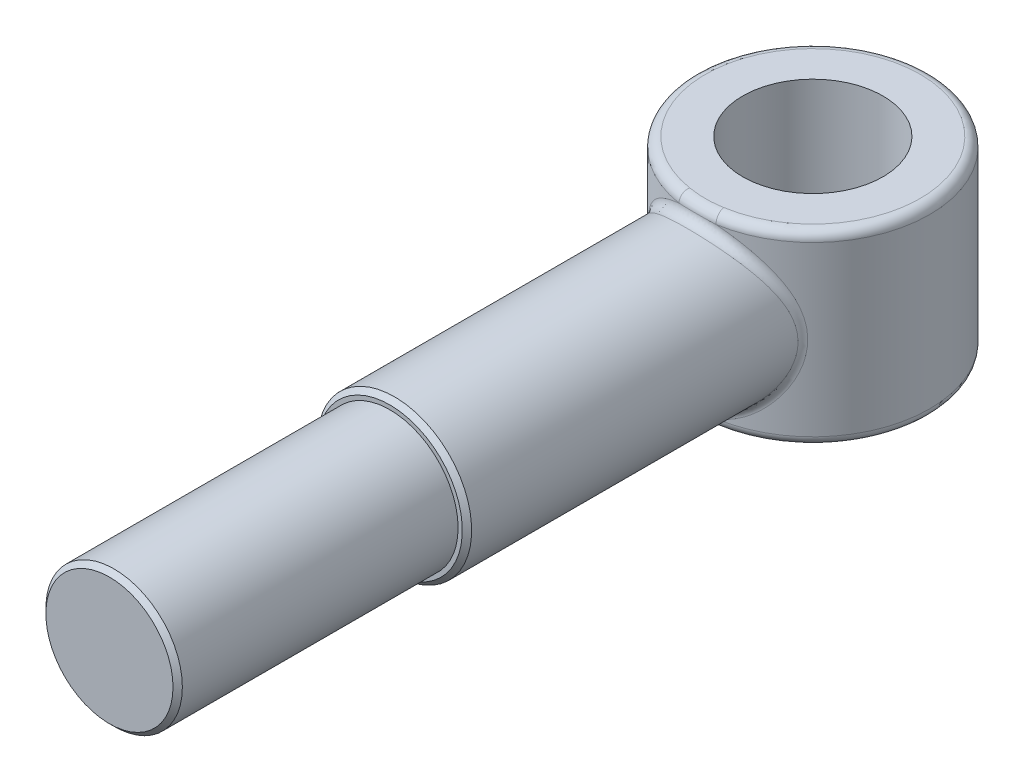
ISO-10303-21;
HEADER;
FILE_DESCRIPTION(('STEP AP214'),'2;1');
FILE_NAME('part.step','',(''),(''),'','','');
FILE_SCHEMA(('AUTOMOTIVE_DESIGN { 1 0 10303 214 1 1 1 1 }'));
ENDSEC;
DATA;
#1=APPLICATION_CONTEXT('core data for automotive mechanical design processes');
#2=APPLICATION_PROTOCOL_DEFINITION('international standard','automotive_design',2000,#1);
#3=PRODUCT_CONTEXT('',#1,'mechanical');
#4=PRODUCT('Part','Part','',(#3));
#5=PRODUCT_RELATED_PRODUCT_CATEGORY('part','',(#4));
#6=PRODUCT_DEFINITION_FORMATION('','',#4);
#7=PRODUCT_DEFINITION_CONTEXT('part definition',#1,'design');
#8=PRODUCT_DEFINITION('design','',#6,#7);
#9=PRODUCT_DEFINITION_SHAPE('','',#8);
#10=(LENGTH_UNIT() NAMED_UNIT(*) SI_UNIT(.MILLI.,.METRE.));
#11=(NAMED_UNIT(*) PLANE_ANGLE_UNIT() SI_UNIT($,.RADIAN.));
#12=(NAMED_UNIT(*) SI_UNIT($,.STERADIAN.) SOLID_ANGLE_UNIT());
#13=UNCERTAINTY_MEASURE_WITH_UNIT(LENGTH_MEASURE(1.E-05),#10,'distance_accuracy_value','');
#14=(GEOMETRIC_REPRESENTATION_CONTEXT(3) GLOBAL_UNCERTAINTY_ASSIGNED_CONTEXT((#13)) GLOBAL_UNIT_ASSIGNED_CONTEXT((#10,
#11,#12)) REPRESENTATION_CONTEXT('',''));
#15=CARTESIAN_POINT('',(0.,0.,0.));
#16=DIRECTION('',(0.,0.,1.));
#17=DIRECTION('',(1.,0.,0.));
#18=AXIS2_PLACEMENT_3D('',#15,#16,#17);
#19=CARTESIAN_POINT('',(0.,0.,-75.));
#20=DIRECTION('',(0.,0.,1.));
#21=DIRECTION('',(1.,0.,0.));
#22=AXIS2_PLACEMENT_3D('',#19,#20,#21);
#23=CYLINDRICAL_SURFACE('',#22,16.5);
#24=CARTESIAN_POINT('',(0.,0.,-1.00000000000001));
#25=DIRECTION('',(0.,0.,-1.));
#26=DIRECTION('',(-1.,0.,0.));
#27=AXIS2_PLACEMENT_3D('',#24,#25,#26);
#28=CIRCLE('',#27,16.5);
#29=CARTESIAN_POINT('',(-16.5,0.,-1.00000000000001));
#30=VERTEX_POINT('',#29);
#31=EDGE_CURVE('E243',#30,#30,#28,.T.);
#32=ORIENTED_EDGE('',*,*,#31,.T.);
#33=EDGE_LOOP('',(#32));
#34=FACE_BOUND('',#33,.T.);
#35=CARTESIAN_POINT('',(16.4643791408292,-1.08361409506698,-70.7965452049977));
#36=CARTESIAN_POINT('',(16.4608732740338,-1.13688206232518,-71.6641526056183));
#37=CARTESIAN_POINT('',(17.0926495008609,-1.21496125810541,-72.2560603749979));
#38=CARTESIAN_POINT('',(16.4883114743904,-0.719979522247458,-70.8216844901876));
#39=CARTESIAN_POINT('',(16.4871418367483,-0.755689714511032,-71.6871481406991));
#40=CARTESIAN_POINT('',(17.1174950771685,-0.807249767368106,-72.2793374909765));
#41=CARTESIAN_POINT('',(16.5002238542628,-0.354851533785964,-70.834275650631));
#42=CARTESIAN_POINT('',(16.5002459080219,-0.372336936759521,-71.6986935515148));
#43=CARTESIAN_POINT('',(17.1298620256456,-0.397863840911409,-72.2909959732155));
#44=CARTESIAN_POINT('',(16.4997697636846,0.37537506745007,-70.8337967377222));
#45=CARTESIAN_POINT('',(16.4997470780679,0.393876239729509,-71.6982550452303));
#46=CARTESIAN_POINT('',(17.1293906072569,0.42087507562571,-72.2905525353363));
#47=CARTESIAN_POINT('',(16.4874033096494,0.740473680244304,-70.8207266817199));
#48=CARTESIAN_POINT('',(16.4861435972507,0.777195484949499,-71.6862706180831));
#49=CARTESIAN_POINT('',(17.1165522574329,0.830228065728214,-72.278450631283));
#50=CARTESIAN_POINT('',(16.4386242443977,1.46785364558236,-70.7694954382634));
#51=CARTESIAN_POINT('',(16.4325716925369,1.54013574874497,-71.6393811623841));
#52=CARTESIAN_POINT('',(17.0659118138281,1.64577529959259,-72.2310142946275));
#53=CARTESIAN_POINT('',(16.4021969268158,1.83013313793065,-70.7313189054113));
#54=CARTESIAN_POINT('',(16.3925236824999,1.92020125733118,-71.6044067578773));
#55=CARTESIAN_POINT('',(17.028094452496,2.05196745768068,-72.1956656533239));
#56=CARTESIAN_POINT('',(16.3059633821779,2.54893630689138,-70.6314917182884));
#57=CARTESIAN_POINT('',(16.2869213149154,2.67330647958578,-71.5131541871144));
#58=CARTESIAN_POINT('',(16.9281886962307,2.85789828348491,-72.1032330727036));
#59=CARTESIAN_POINT('',(16.2461566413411,2.90545985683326,-70.5698405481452));
#60=CARTESIAN_POINT('',(16.2212455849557,3.04675914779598,-71.4567729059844));
#61=CARTESIAN_POINT('',(16.8660997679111,3.25763680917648,-72.0461486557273));
#62=CARTESIAN_POINT('',(16.1081963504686,3.59040510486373,-70.4295952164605));
#63=CARTESIAN_POINT('',(16.0700775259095,3.76298341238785,-71.3288564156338));
#64=CARTESIAN_POINT('',(16.722874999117,4.02560572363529,-71.916291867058));
#65=CARTESIAN_POINT('',(16.0312838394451,3.9192697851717,-70.3521680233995));
#66=CARTESIAN_POINT('',(15.9857696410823,4.10667106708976,-71.2582388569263));
#67=CARTESIAN_POINT('',(16.6430275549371,4.39433278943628,-71.8446000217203));
#68=CARTESIAN_POINT('',(15.8584749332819,4.56856182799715,-70.1809713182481));
#69=CARTESIAN_POINT('',(15.7967417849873,4.78403172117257,-71.1025026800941));
#70=CARTESIAN_POINT('',(16.4636243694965,5.12232689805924,-71.6860845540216));
#71=CARTESIAN_POINT('',(15.7625714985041,4.88898601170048,-70.0871957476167));
#72=CARTESIAN_POINT('',(15.6918436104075,5.11795889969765,-71.0172479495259));
#73=CARTESIAN_POINT('',(16.3640613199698,5.48159037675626,-71.5992553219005));
#74=CARTESIAN_POINT('',(15.4477064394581,5.83616951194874,-69.7850786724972));
#75=CARTESIAN_POINT('',(15.3473428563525,6.10545164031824,-70.7426995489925));
#76=CARTESIAN_POINT('',(16.0371812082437,6.54358399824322,-71.3195172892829));
#77=CARTESIAN_POINT('',(15.2015790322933,6.44889344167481,-69.5559350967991));
#78=CARTESIAN_POINT('',(15.0784903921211,6.74100912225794,-70.5351709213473));
#79=CARTESIAN_POINT('',(15.7816617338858,7.23057749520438,-71.1073473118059));
#80=CARTESIAN_POINT('',(14.7137374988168,7.48308990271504,-69.1240545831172));
#81=CARTESIAN_POINT('',(14.5503783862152,7.80569813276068,-70.1480386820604));
#82=CARTESIAN_POINT('',(15.2752044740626,8.39013110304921,-70.7074579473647));
#83=CARTESIAN_POINT('',(14.4862751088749,7.91410709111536,-68.9290167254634));
#84=CARTESIAN_POINT('',(14.3039899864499,8.24853926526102,-69.9734414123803));
#85=CARTESIAN_POINT('',(15.0390622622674,8.87339279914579,-70.5268673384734));
#86=CARTESIAN_POINT('',(13.9964837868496,8.7511995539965,-68.5262697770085));
#87=CARTESIAN_POINT('',(13.776280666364,9.10439440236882,-69.615257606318));
#88=CARTESIAN_POINT('',(14.5305808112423,9.81195101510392,-70.1539534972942));
#89=CARTESIAN_POINT('',(13.7341416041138,9.15726526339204,-68.3185558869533));
#90=CARTESIAN_POINT('',(13.4942020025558,9.5175863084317,-69.4313356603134));
#91=CARTESIAN_POINT('',(14.2582278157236,10.2672368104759,-69.9616258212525));
#92=CARTESIAN_POINT('',(13.1758165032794,9.94389060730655,-67.8968014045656));
#93=CARTESIAN_POINT('',(12.8974707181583,10.3134456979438,-69.0606243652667));
#94=CARTESIAN_POINT('',(13.6785973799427,11.1492106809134,-69.5711124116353));
#95=CARTESIAN_POINT('',(12.8797773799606,10.3244058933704,-67.6827506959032));
#96=CARTESIAN_POINT('',(12.5820458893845,10.6960407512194,-68.8736141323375));
#97=CARTESIAN_POINT('',(13.3712615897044,11.5758490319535,-69.3729173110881));
#98=CARTESIAN_POINT('',(12.2556473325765,11.0580734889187,-67.25460908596));
#99=CARTESIAN_POINT('',(11.9215626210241,11.4288400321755,-68.5026374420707));
#100=CARTESIAN_POINT('',(12.7233151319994,12.3984460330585,-68.9764898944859));
#101=CARTESIAN_POINT('',(11.9275602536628,11.4112290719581,-67.0405181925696));
#102=CARTESIAN_POINT('',(11.5758464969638,11.778846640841,-68.3185813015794));
#103=CARTESIAN_POINT('',(12.3827084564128,12.7944083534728,-68.7782575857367));
#104=CARTESIAN_POINT('',(11.2370276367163,12.0920023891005,-66.6157009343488));
#105=CARTESIAN_POINT('',(10.8537275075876,12.4484917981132,-67.9566939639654));
#106=CARTESIAN_POINT('',(11.6658255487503,13.5576996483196,-68.3849082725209));
#107=CARTESIAN_POINT('',(10.8742826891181,12.4193426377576,-66.4050265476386));
#108=CARTESIAN_POINT('',(10.4765557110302,12.7673600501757,-67.7790221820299));
#109=CARTESIAN_POINT('',(11.2892384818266,13.9247175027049,-68.189839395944));
#110=CARTESIAN_POINT('',(10.1181828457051,13.0427152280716,-65.994466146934));
#111=CARTESIAN_POINT('',(9.697185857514,13.3693866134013,-67.4363260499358));
#112=CARTESIAN_POINT('',(10.5042863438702,14.6236504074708,-67.8096908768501));
#113=CARTESIAN_POINT('',(9.7248252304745,13.3387447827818,-65.7945810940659));
#114=CARTESIAN_POINT('',(9.29461020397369,13.6519571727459,-67.2715135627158));
#115=CARTESIAN_POINT('',(10.0959184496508,14.9555623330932,-67.624612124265));
#116=CARTESIAN_POINT('',(8.90964609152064,13.8964618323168,-65.4110979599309));
#117=CARTESIAN_POINT('',(8.46824076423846,14.1793182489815,-66.9588157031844));
#118=CARTESIAN_POINT('',(9.24963258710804,15.5808814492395,-67.269535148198));
#119=CARTESIAN_POINT('',(8.48787669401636,14.15820975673,-65.2274714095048));
#120=CARTESIAN_POINT('',(8.04436202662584,14.4234397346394,-66.8112498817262));
#121=CARTESIAN_POINT('',(8.81176873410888,15.8743563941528,-67.0995105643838));
#122=CARTESIAN_POINT('',(7.61723500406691,14.6450084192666,-64.8811162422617));
#123=CARTESIAN_POINT('',(7.17814941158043,14.8730143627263,-66.5360947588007));
#124=CARTESIAN_POINT('',(7.907903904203,16.4201609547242,-66.7788113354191));
#125=CARTESIAN_POINT('',(7.16837089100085,14.8700701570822,-64.7183813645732));
#126=CARTESIAN_POINT('',(6.73604485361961,15.0776205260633,-66.4089681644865));
#127=CARTESIAN_POINT('',(7.44191141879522,16.6725029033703,-66.6281308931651));
#128=CARTESIAN_POINT('',(6.34837247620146,15.2349142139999,-64.451743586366));
#129=CARTESIAN_POINT('',(5.93768884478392,15.4056568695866,-66.2032843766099));
#130=CARTESIAN_POINT('',(6.59062237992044,17.0815704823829,-66.3812440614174));
#131=CARTESIAN_POINT('',(5.98201764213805,15.3825469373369,-64.3427907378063));
#132=CARTESIAN_POINT('',(5.58346640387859,15.5369342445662,-66.1202473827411));
#133=CARTESIAN_POINT('',(6.21028767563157,17.2470980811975,-66.2803617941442));
#134=CARTESIAN_POINT('',(5.2362733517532,15.6521102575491,-64.1425274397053));
#135=CARTESIAN_POINT('',(4.86775906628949,15.7748977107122,-65.9688884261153));
#136=CARTESIAN_POINT('',(5.43608625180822,17.5493357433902,-66.0949328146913));
#137=CARTESIAN_POINT('',(4.8568864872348,15.7740459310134,-64.0512135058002));
#138=CARTESIAN_POINT('',(4.50673066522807,15.8811715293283,-65.9008197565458));
#139=CARTESIAN_POINT('',(5.04222222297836,17.6860514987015,-66.0103828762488));
#140=CARTESIAN_POINT('',(4.08733699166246,15.9907280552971,-63.8881442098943));
#141=CARTESIAN_POINT('',(3.77920446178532,16.0688905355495,-65.7801034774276));
#142=CARTESIAN_POINT('',(4.24330720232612,17.9289981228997,-65.8593927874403));
#143=CARTESIAN_POINT('',(3.69717957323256,16.0854874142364,-63.8163795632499));
#144=CARTESIAN_POINT('',(3.41331906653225,16.1499723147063,-65.7276852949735));
#145=CARTESIAN_POINT('',(3.83826162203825,18.0352434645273,-65.7929440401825));
#146=CARTESIAN_POINT('',(2.90842656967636,16.2466323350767,-63.6939304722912));
#147=CARTESIAN_POINT('',(2.67737895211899,16.2873040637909,-65.6386684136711));
#148=CARTESIAN_POINT('',(3.0194102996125,18.2159211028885,-65.6795652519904));
#149=CARTESIAN_POINT('',(2.50983080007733,16.3130172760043,-63.6432464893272));
#150=CARTESIAN_POINT('',(2.30807264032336,16.3432494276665,-65.6022653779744));
#151=CARTESIAN_POINT('',(2.60560436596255,18.2903527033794,-65.6326356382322));
#152=CARTESIAN_POINT('',(1.70564498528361,16.4166293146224,-63.5639961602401));
#153=CARTESIAN_POINT('',(1.56524993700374,16.4304475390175,-65.5454470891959));
#154=CARTESIAN_POINT('',(1.77073132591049,18.4065237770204,-65.5592557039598));
#155=CARTESIAN_POINT('',(1.30003489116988,16.4537503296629,-63.5355102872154));
#156=CARTESIAN_POINT('',(1.19259088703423,16.461401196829,-65.5252259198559));
#157=CARTESIAN_POINT('',(1.3496434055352,18.4481443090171,-65.5328798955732));
#158=CARTESIAN_POINT('',(0.486407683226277,16.4978599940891,-63.5016500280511));
#159=CARTESIAN_POINT('',(0.445532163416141,16.4982468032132,-65.5011495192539));
#160=CARTESIAN_POINT('',(0.50496869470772,18.4976005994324,-65.5015278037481));
#161=CARTESIAN_POINT('',(0.0783905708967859,16.5048486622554,-63.496275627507));
#162=CARTESIAN_POINT('',(0.0720594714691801,16.5040470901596,-65.4973541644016));
#163=CARTESIAN_POINT('',(0.0813819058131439,18.5054363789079,-65.4965515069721));
#164=CARTESIAN_POINT('',(-0.736763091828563,16.488583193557,-63.5087700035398));
#165=CARTESIAN_POINT('',(-0.675536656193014,16.4904797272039,-65.5062242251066));
#166=CARTESIAN_POINT('',(-0.764877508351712,18.4871993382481,-65.508120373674));
#167=CARTESIAN_POINT('',(-1.14389961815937,16.4653282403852,-63.5266394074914));
#168=CARTESIAN_POINT('',(-1.04872088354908,16.4711454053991,-65.5188678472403));
#169=CARTESIAN_POINT('',(-1.18755010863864,18.4611256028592,-65.5246661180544));
#170=CARTESIAN_POINT('',(-1.95402461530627,16.3889388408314,-63.5851867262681));
#171=CARTESIAN_POINT('',(-1.79453974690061,16.4071247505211,-65.5606503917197));
#172=CARTESIAN_POINT('',(-2.02858896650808,18.3754768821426,-65.5788765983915));
#173=CARTESIAN_POINT('',(-2.35701320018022,16.3358052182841,-63.6258640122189));
#174=CARTESIAN_POINT('',(-2.1662753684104,16.3625957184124,-65.5896868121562));
#175=CARTESIAN_POINT('',(-2.44695534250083,18.3159028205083,-65.6165407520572));
#176=CARTESIAN_POINT('',(-3.1330571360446,16.2043185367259,-63.7261159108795));
#177=CARTESIAN_POINT('',(-2.88679496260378,16.2512293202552,-65.6620701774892));
#178=CARTESIAN_POINT('',(-3.25261262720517,18.1684783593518,-65.7093665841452));
#179=CARTESIAN_POINT('',(-3.50651132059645,16.1275717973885,-63.7844840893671));
#180=CARTESIAN_POINT('',(-3.23487621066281,16.1860494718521,-65.7043511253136));
#181=CARTESIAN_POINT('',(-3.64031758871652,18.0824289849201,-65.7634111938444));
#182=CARTESIAN_POINT('',(-4.24486066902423,15.9491523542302,-63.919477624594));
#183=CARTESIAN_POINT('',(-3.92799397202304,16.0328371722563,-65.8033138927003));
#184=CARTESIAN_POINT('',(-4.40684188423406,17.8823829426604,-65.8884052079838));
#185=CARTESIAN_POINT('',(-4.60975282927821,15.8474710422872,-63.9961092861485));
#186=CARTESIAN_POINT('',(-4.27244935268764,15.9450872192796,-65.8598155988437));
#187=CARTESIAN_POINT('',(-4.78565810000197,17.7683766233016,-65.959360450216));
#188=CARTESIAN_POINT('',(-5.32875389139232,15.6203869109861,-64.1661232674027));
#189=CARTESIAN_POINT('',(-4.95652388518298,15.746787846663,-65.9867814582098));
#190=CARTESIAN_POINT('',(-5.53209579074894,17.5137671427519,-66.1167808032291));
#191=CARTESIAN_POINT('',(-5.68286572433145,15.494990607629,-64.2595009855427));
#192=CARTESIAN_POINT('',(-5.2956814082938,15.6365818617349,-66.0570312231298));
#193=CARTESIAN_POINT('',(-5.89972030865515,17.3731712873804,-66.2032416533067));
#194=CARTESIAN_POINT('',(-6.378878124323,15.2216878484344,-64.4613678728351));
#195=CARTESIAN_POINT('',(-5.96766632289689,15.3935080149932,-66.2108662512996));
#196=CARTESIAN_POINT('',(-6.62229210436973,17.0667409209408,-66.3901554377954));
#197=CARTESIAN_POINT('',(-6.72077414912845,15.0737731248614,-64.5698625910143));
#198=CARTESIAN_POINT('',(-6.3001574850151,15.2609918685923,-66.2942382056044));
#199=CARTESIAN_POINT('',(-6.97723466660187,16.9008971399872,-66.4906135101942));
#200=CARTESIAN_POINT('',(-7.41686901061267,14.7444740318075,-64.8090438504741));
#201=CARTESIAN_POINT('',(-6.98215988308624,14.962649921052,-66.4802784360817));
#202=CARTESIAN_POINT('',(-7.69989207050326,16.5316830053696,-66.7120776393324));
#203=CARTESIAN_POINT('',(-7.76997086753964,14.5613849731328,-64.9407982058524));
#204=CARTESIAN_POINT('',(-7.33104372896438,14.7953450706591,-66.5837690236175));
#205=CARTESIAN_POINT('',(-8.06646807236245,16.3264013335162,-66.834072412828));
#206=CARTESIAN_POINT('',(-8.45907553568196,14.172185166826,-65.2173078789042));
#207=CARTESIAN_POINT('',(-8.01725276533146,14.4355151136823,-66.8036970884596));
#208=CARTESIAN_POINT('',(-8.78186854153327,15.8900257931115,-67.0900998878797));
#209=CARTESIAN_POINT('',(-8.79507106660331,13.9660647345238,-65.362068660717));
#210=CARTESIAN_POINT('',(-8.35447213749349,14.2434056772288,-66.9199089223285));
#211=CARTESIAN_POINT('',(-9.13068545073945,15.6589210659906,-67.2241376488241));
#212=CARTESIAN_POINT('',(-9.77605983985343,13.3151854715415,-65.812311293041));
#213=CARTESIAN_POINT('',(-9.34014100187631,13.6338153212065,-67.2834402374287));
#214=CARTESIAN_POINT('',(-10.14910813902,14.9291473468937,-67.6410289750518));
#215=CARTESIAN_POINT('',(-10.394184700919,12.8378467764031,-66.1337993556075));
#216=CARTESIAN_POINT('',(-9.97511845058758,13.1777631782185,-67.5490652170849));
#217=CARTESIAN_POINT('',(-10.7908202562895,14.3939494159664,-67.9387031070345));
#218=CARTESIAN_POINT('',(-11.3109660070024,12.0215455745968,-66.6599186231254));
#219=CARTESIAN_POINT('',(-10.9309671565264,12.378972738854,-67.9943938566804));
#220=CARTESIAN_POINT('',(-11.7425853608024,13.4787026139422,-68.4258505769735));
#221=CARTESIAN_POINT('',(-11.635680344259,11.7074530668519,-66.8576268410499));
#222=CARTESIAN_POINT('',(-11.2704376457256,12.0707627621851,-68.1624832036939));
#223=CARTESIAN_POINT('',(-12.0796905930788,13.1265382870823,-68.6089137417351));
#224=CARTESIAN_POINT('',(-12.2577592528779,11.0544349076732,-67.2561643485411));
#225=CARTESIAN_POINT('',(-11.9239011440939,11.4247056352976,-68.5041734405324));
#226=CARTESIAN_POINT('',(-12.7255076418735,12.3943664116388,-68.9779299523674));
#227=CARTESIAN_POINT('',(-12.5551196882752,10.7155055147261,-67.4569941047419));
#228=CARTESIAN_POINT('',(-12.2383742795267,11.0871200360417,-68.6777724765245));
#229=CARTESIAN_POINT('',(-13.0342151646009,12.0143546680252,-69.1638834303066));
#230=CARTESIAN_POINT('',(-13.121580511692,10.0138713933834,-67.8572105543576));
#231=CARTESIAN_POINT('',(-12.8396830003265,10.3835068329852,-69.0260987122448));
#232=CARTESIAN_POINT('',(-13.6222917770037,11.2276739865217,-69.5344542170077));
#233=CARTESIAN_POINT('',(-13.3906659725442,9.65115426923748,-68.0565964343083));
#234=CARTESIAN_POINT('',(-13.1270681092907,10.0175814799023,-69.2009341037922));
#235=CARTESIAN_POINT('',(-13.9016453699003,10.8209911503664,-69.719070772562));
#236=CARTESIAN_POINT('',(-13.8993517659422,8.90295395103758,-68.4488129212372));
#237=CARTESIAN_POINT('',(-13.6718316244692,9.25862831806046,-69.5466861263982));
#238=CARTESIAN_POINT('',(-14.4297422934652,9.98209988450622,-70.0822341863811));
#239=CARTESIAN_POINT('',(-14.1389563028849,8.51747401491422,-68.6416444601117));
#240=CARTESIAN_POINT('',(-13.9298155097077,8.86557678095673,-69.7178070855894));
#241=CARTESIAN_POINT('',(-14.6784899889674,9.54989510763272,-70.2607819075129));
#242=CARTESIAN_POINT('',(-14.5585540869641,7.77535595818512,-68.9912384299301));
#243=CARTESIAN_POINT('',(-14.3827378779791,8.10512087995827,-70.0294723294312));
#244=CARTESIAN_POINT('',(-15.1140993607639,8.71782334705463,-70.5844800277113));
#245=CARTESIAN_POINT('',(-14.7422515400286,7.42135590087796,-69.1494556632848));
#246=CARTESIAN_POINT('',(-14.581687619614,7.74121026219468,-70.1711436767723));
#247=CARTESIAN_POINT('',(-15.3048065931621,8.32091419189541,-70.7309774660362));
#248=CARTESIAN_POINT('',(-15.0850196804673,6.69720959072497,-69.4525968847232));
#249=CARTESIAN_POINT('',(-14.9533400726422,6.994597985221,-70.443285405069));
#250=CARTESIAN_POINT('',(-15.6606545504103,7.50899257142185,-71.0116637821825));
#251=CARTESIAN_POINT('',(-15.2440910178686,6.32706376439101,-69.5975212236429));
#252=CARTESIAN_POINT('',(-15.1264431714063,6.61167907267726,-70.5739831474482));
#253=CARTESIAN_POINT('',(-15.825795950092,7.09398058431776,-71.1458529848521));
#254=CARTESIAN_POINT('',(-15.5359422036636,5.57207718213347,-69.8694246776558));
#255=CARTESIAN_POINT('',(-15.4442235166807,5.82890058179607,-70.8196192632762));
#256=CARTESIAN_POINT('',(-16.1287839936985,6.24748047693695,-71.3976154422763));
#257=CARTESIAN_POINT('',(-15.6687594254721,5.18725825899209,-69.9964292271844));
#258=CARTESIAN_POINT('',(-15.5893168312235,5.42875074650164,-70.9348267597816));
#259=CARTESIAN_POINT('',(-16.2666694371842,5.81601683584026,-71.515212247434));
#260=CARTESIAN_POINT('',(-15.9067007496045,4.40389989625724,-70.2280566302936));
#261=CARTESIAN_POINT('',(-15.8492598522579,4.61293133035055,-71.1451271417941));
#262=CARTESIAN_POINT('',(-16.5136904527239,4.93770594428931,-71.7296820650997));
#263=CARTESIAN_POINT('',(-16.0118289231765,4.00536248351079,-70.3326827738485));
#264=CARTESIAN_POINT('',(-15.9644528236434,4.19683860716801,-71.2404719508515));
#265=CARTESIAN_POINT('',(-16.6228302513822,4.49086096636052,-71.8265581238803));
#266=CARTESIAN_POINT('',(-16.1825875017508,3.24182138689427,-70.5048543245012));
#267=CARTESIAN_POINT('',(-16.1515188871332,3.3987673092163,-71.3974278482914));
#268=CARTESIAN_POINT('',(-16.8001048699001,3.6347694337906,-71.9859762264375));
#269=CARTESIAN_POINT('',(-16.251310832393,2.87801933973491,-70.575229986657));
#270=CARTESIAN_POINT('',(-16.226955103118,3.01792065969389,-71.4617452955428));
#271=CARTESIAN_POINT('',(-16.8714506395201,3.22687016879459,-72.0511388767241));
#272=CARTESIAN_POINT('',(-16.3643797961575,2.14360637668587,-70.6919074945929));
#273=CARTESIAN_POINT('',(-16.3509878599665,2.24882714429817,-71.5683430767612));
#274=CARTESIAN_POINT('',(-16.9888342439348,2.40343745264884,-72.1591736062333));
#275=CARTESIAN_POINT('',(-16.4087283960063,1.7729962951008,-70.7382122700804));
#276=CARTESIAN_POINT('',(-16.3997351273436,1.86014874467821,-71.6107499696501));
#277=CARTESIAN_POINT('',(-17.0348751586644,1.98790493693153,-72.2020483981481));
#278=CARTESIAN_POINT('',(-16.4721781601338,1.0280721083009,-70.8046804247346));
#279=CARTESIAN_POINT('',(-16.4694073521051,1.07898598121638,-71.6715691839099));
#280=CARTESIAN_POINT('',(-17.1007461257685,1.15268690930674,-72.2635929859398));
#281=CARTESIAN_POINT('',(-16.4913016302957,0.653761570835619,-70.8248668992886));
#282=CARTESIAN_POINT('',(-16.4904431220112,0.686030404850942,-71.6900775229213));
#283=CARTESIAN_POINT('',(-17.1205993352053,0.733005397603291,-72.2822841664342));
#284=CARTESIAN_POINT('',(-16.5039793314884,-0.0956986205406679,-70.8382355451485));
#285=CARTESIAN_POINT('',(-16.5043705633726,-0.100345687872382,-71.70231848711));
#286=CARTESIAN_POINT('',(-17.1337608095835,-0.107298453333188,-72.2946625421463));
#287=CARTESIAN_POINT('',(-16.4975316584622,-0.470848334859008,-70.8314157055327));
#288=CARTESIAN_POINT('',(-16.4972777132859,-0.49426190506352,-71.6960647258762));
#289=CARTESIAN_POINT('',(-17.1270670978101,-0.527920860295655,-72.2883478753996));
#290=CARTESIAN_POINT('',(-16.4571268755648,-1.25891740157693,-70.7889016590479));
#291=CARTESIAN_POINT('',(-16.452893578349,-1.32102715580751,-71.6571430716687));
#292=CARTESIAN_POINT('',(-17.0851204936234,-1.41151345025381,-72.2489830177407));
#293=CARTESIAN_POINT('',(-16.4202873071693,-1.67156215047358,-70.7501825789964));
#294=CARTESIAN_POINT('',(-16.4123712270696,-1.75409530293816,-71.6216495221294));
#295=CARTESIAN_POINT('',(-17.0468751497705,-1.87417574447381,-72.2131320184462));
#296=CARTESIAN_POINT('',(-16.3162875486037,-2.48976777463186,-70.6421278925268));
#297=CARTESIAN_POINT('',(-16.2982354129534,-2.61147095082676,-71.5228614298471));
#298=CARTESIAN_POINT('',(-16.9389068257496,-2.79155780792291,-72.113081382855));
#299=CARTESIAN_POINT('',(-16.249122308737,-2.89532745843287,-70.5727871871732));
#300=CARTESIAN_POINT('',(-16.2244468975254,-3.03638990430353,-71.4594176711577));
#301=CARTESIAN_POINT('',(-16.8691786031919,-3.24627624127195,-72.0488770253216));
#302=CARTESIAN_POINT('',(-16.0857678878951,-3.69670383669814,-70.4068699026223));
#303=CARTESIAN_POINT('',(-16.0454457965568,-3.87438352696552,-71.3080837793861));
#304=CARTESIAN_POINT('',(-16.6995906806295,-4.14478915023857,-71.895249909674));
#305=CARTESIAN_POINT('',(-15.9895291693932,-4.09250264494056,-70.3102468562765));
#306=CARTESIAN_POINT('',(-15.9399291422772,-4.28796669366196,-71.2199487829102));
#307=CARTESIAN_POINT('',(-16.5996795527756,-4.58856357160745,-71.8057841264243));
#308=CARTESIAN_POINT('',(-15.7696819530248,-4.8714534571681,-70.0940332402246));
#309=CARTESIAN_POINT('',(-15.6995731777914,-5.10001030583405,-71.0234202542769));
#310=CARTESIAN_POINT('',(-16.3714431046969,-5.46193266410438,-71.6055863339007));
#311=CARTESIAN_POINT('',(-15.6460584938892,-5.25459841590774,-69.9744301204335));
#312=CARTESIAN_POINT('',(-15.5644064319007,-5.49889645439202,-70.9147811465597));
#313=CARTESIAN_POINT('',(-16.2431022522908,-5.89151943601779,-71.4948427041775));
#314=CARTESIAN_POINT('',(-15.3747069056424,-6.00205011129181,-69.7182834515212));
#315=CARTESIAN_POINT('',(-15.2686604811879,-6.27487778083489,-70.6830390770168));
#316=CARTESIAN_POINT('',(-15.9613960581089,-6.72957133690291,-71.2576698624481));
#317=CARTESIAN_POINT('',(-15.2272791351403,-6.3665253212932,-69.5819555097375));
#318=CARTESIAN_POINT('',(-15.1080449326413,-6.65252822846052,-70.5598793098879));
#319=CARTESIAN_POINT('',(-15.808342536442,-7.13822536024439,-71.1314402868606));
#320=CARTESIAN_POINT('',(-14.9087843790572,-7.08032099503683,-69.2954982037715));
#321=CARTESIAN_POINT('',(-14.7622283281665,-7.38984237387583,-70.302173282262));
#322=CARTESIAN_POINT('',(-15.4776942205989,-7.93854172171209,-70.866202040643));
#323=CARTESIAN_POINT('',(-14.737719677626,-7.4296429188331,-69.1453701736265));
#324=CARTESIAN_POINT('',(-14.576666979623,-7.74973569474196,-70.167411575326));
#325=CARTESIAN_POINT('',(-15.3001017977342,-8.33020569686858,-70.7271946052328));
#326=CARTESIAN_POINT('',(-14.1907337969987,-8.45412923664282,-68.6801023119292));
#327=CARTESIAN_POINT('',(-13.9829765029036,-8.8058934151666,-69.7500100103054));
#328=CARTESIAN_POINT('',(-14.7322432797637,-9.47887217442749,-70.296391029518));
#329=CARTESIAN_POINT('',(-13.7808647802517,-9.10623815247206,-68.3499249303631));
#330=CARTESIAN_POINT('',(-13.5405268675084,-9.47074502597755,-69.4565914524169));
#331=CARTESIAN_POINT('',(-14.3067339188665,-10.2100245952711,-69.9906712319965));
#332=CARTESIAN_POINT('',(-13.0619453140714,-10.0916844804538,-67.8141344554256));
#333=CARTESIAN_POINT('',(-12.7764099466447,-10.461906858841,-68.9884855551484));
#334=CARTESIAN_POINT('',(-13.5603809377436,-11.3149189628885,-69.4945689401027));
#335=CARTESIAN_POINT('',(-12.7796321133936,-10.446853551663,-67.6124404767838));
#336=CARTESIAN_POINT('',(-12.4760363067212,-10.818427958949,-68.8126168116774));
#337=CARTESIAN_POINT('',(-13.2672948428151,-11.7131388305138,-69.3078152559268));
#338=CARTESIAN_POINT('',(-12.1865394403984,-11.1330046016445,-67.2093505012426));
#339=CARTESIAN_POINT('',(-11.849025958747,-11.5028682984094,-68.4638582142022));
#340=CARTESIAN_POINT('',(-12.6515701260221,-12.4824597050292,-68.9345837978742));
#341=CARTESIAN_POINT('',(-11.875756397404,-11.4639835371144,-67.0079545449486));
#342=CARTESIAN_POINT('',(-11.5218397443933,-11.8306029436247,-68.2909036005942));
#343=CARTESIAN_POINT('',(-12.3289277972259,-12.8535572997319,-68.7481060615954));
#344=CARTESIAN_POINT('',(-11.226742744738,-12.1002803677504,-66.6101412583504));
#345=CARTESIAN_POINT('',(-10.8434707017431,-12.456124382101,-67.9522413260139));
#346=CARTESIAN_POINT('',(-11.6551481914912,-13.566981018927,-68.3797604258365));
#347=CARTESIAN_POINT('',(-10.8885163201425,-12.4056021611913,-66.4137231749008));
#348=CARTESIAN_POINT('',(-10.4918400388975,-12.7535861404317,-67.7865825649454));
#349=CARTESIAN_POINT('',(-11.3040152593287,-13.9093115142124,-68.1978918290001));
#350=CARTESIAN_POINT('',(-10.1853110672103,-12.9891571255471,-66.0300546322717));
#351=CARTESIAN_POINT('',(-9.76659463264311,-13.317550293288,-67.4660866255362));
#352=CARTESIAN_POINT('',(-10.5739761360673,-14.5636004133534,-67.842643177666));
#353=CARTESIAN_POINT('',(-9.82032392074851,-13.2673818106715,-65.8428070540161));
#354=CARTESIAN_POINT('',(-9.39266286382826,-13.583572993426,-67.3114197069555));
#355=CARTESIAN_POINT('',(-10.1950613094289,-14.8755493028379,-67.669265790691));
#356=CARTESIAN_POINT('',(-9.09850083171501,-13.7711047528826,-65.4978325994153));
#357=CARTESIAN_POINT('',(-8.66006825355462,-14.0606694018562,-67.0295854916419));
#358=CARTESIAN_POINT('',(-9.44569390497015,-15.4403295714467,-67.3498449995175));
#359=CARTESIAN_POINT('',(-8.74383688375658,-13.9990922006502,-65.3389619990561));
#360=CARTESIAN_POINT('',(-8.30248634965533,-14.274340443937,-66.9012477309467));
#361=CARTESIAN_POINT('',(-9.07749620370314,-15.6959518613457,-67.2027425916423));
#362=CARTESIAN_POINT('',(-8.01461237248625,-14.4289639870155,-65.0355078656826));
#363=CARTESIAN_POINT('',(-7.57341653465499,-14.6737819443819,-66.6585357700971));
#364=CARTESIAN_POINT('',(-8.32044494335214,-16.1779293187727,-66.9217665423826));
#365=CARTESIAN_POINT('',(-7.64006230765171,-14.630861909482,-64.8909169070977));
#366=CARTESIAN_POINT('',(-7.20201601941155,-14.8590533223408,-66.5444268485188));
#367=CARTESIAN_POINT('',(-7.93160228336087,-16.4042997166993,-66.7878860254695));
#368=CARTESIAN_POINT('',(-6.87249279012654,-15.0067112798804,-64.6189547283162));
#369=CARTESIAN_POINT('',(-6.44742715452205,-15.2009871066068,-66.3319267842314));
#370=CARTESIAN_POINT('',(-7.13474279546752,-16.8257065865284,-66.5360691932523));
#371=CARTESIAN_POINT('',(-6.47947769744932,-15.1806692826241,-64.4915794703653));
#372=CARTESIAN_POINT('',(-6.0645253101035,-15.3571025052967,-66.2338502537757));
#373=CARTESIAN_POINT('',(-6.72673049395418,-17.0207504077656,-66.4181291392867));
#374=CARTESIAN_POINT('',(-5.6768890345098,-15.4986844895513,-64.2568486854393));
#375=CARTESIAN_POINT('',(-5.28910517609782,-15.6401912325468,-66.0547973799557));
#376=CARTESIAN_POINT('',(-5.89351555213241,-17.3773129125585,-66.2007858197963));
#377=CARTESIAN_POINT('',(-5.26731551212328,-15.6427417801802,-64.149493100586));
#378=CARTESIAN_POINT('',(-4.89709457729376,-15.7666085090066,-65.9741576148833));
#379=CARTESIAN_POINT('',(-5.46831296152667,-17.5388316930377,-66.1013825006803));
#380=CARTESIAN_POINT('',(-4.43116096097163,-15.8999208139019,-63.9566976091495));
#381=CARTESIAN_POINT('',(-4.10276053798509,-15.9907636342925,-65.8304795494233));
#382=CARTESIAN_POINT('',(-4.60025127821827,-17.8271839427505,-65.9228681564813));
#383=CARTESIAN_POINT('',(-4.00447851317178,-16.0128117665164,-63.8714214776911));
#384=CARTESIAN_POINT('',(-3.70115791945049,-16.0877576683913,-65.7679046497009));
#385=CARTESIAN_POINT('',(-4.15728689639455,-17.9537586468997,-65.8439087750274));
#386=CARTESIAN_POINT('',(-3.14013363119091,-16.2044897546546,-63.7260516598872));
#387=CARTESIAN_POINT('',(-2.89244322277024,-16.2516797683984,-65.6618179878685));
#388=CARTESIAN_POINT('',(-3.25995915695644,-18.1686703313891,-65.7093070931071));
#389=CARTESIAN_POINT('',(-2.70247109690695,-16.2832764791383,-63.6659582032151));
#390=CARTESIAN_POINT('',(-2.48629279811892,-16.3181762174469,-65.6185825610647));
#391=CARTESIAN_POINT('',(-2.80559569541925,-18.2570069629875,-65.653665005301));
#392=CARTESIAN_POINT('',(-1.82020755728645,-16.405335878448,-63.5726601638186));
#393=CARTESIAN_POINT('',(-1.67048134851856,-16.4210365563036,-65.5515938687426));
#394=CARTESIAN_POINT('',(-1.88966553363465,-18.3938614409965,-65.5672779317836));
#395=CARTESIAN_POINT('',(-1.37561069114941,-16.4486289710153,-63.5394401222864));
#396=CARTESIAN_POINT('',(-1.26194670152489,-16.4571239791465,-65.5280200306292));
#397=CARTESIAN_POINT('',(-1.42810313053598,-18.4424021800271,-65.5365186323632));
#398=CARTESIAN_POINT('',(-0.483434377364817,-16.4989650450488,-63.5008031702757));
#399=CARTESIAN_POINT('',(-0.442670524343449,-16.4991791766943,-65.5005409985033));
#400=CARTESIAN_POINT('',(-0.501881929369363,-18.4988395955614,-65.5007436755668));
#401=CARTESIAN_POINT('',(-0.0358552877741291,-16.5060123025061,-63.4953829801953));
#402=CARTESIAN_POINT('',(-0.0331512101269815,-16.5050247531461,-65.496715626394));
#403=CARTESIAN_POINT('',(-0.0372235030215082,-18.5067410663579,-65.4957249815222));
#404=CARTESIAN_POINT('',(0.803500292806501,-16.485102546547,-63.5114425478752));
#405=CARTESIAN_POINT('',(0.736762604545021,-16.4875729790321,-65.5081239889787));
#406=CARTESIAN_POINT('',(0.83416135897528,-18.4832967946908,-65.5105949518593));
#407=CARTESIAN_POINT('',(1.19543813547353,-16.4613016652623,-63.5297284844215));
#408=CARTESIAN_POINT('',(1.09613499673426,-16.4677755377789,-65.5210688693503));
#409=CARTESIAN_POINT('',(1.24105530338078,-18.4566109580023,-65.5275263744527));
#410=CARTESIAN_POINT('',(1.97536245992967,-16.386012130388,-63.5874265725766));
#411=CARTESIAN_POINT('',(1.81428284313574,-16.4046637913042,-65.5622546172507));
#412=CARTESIAN_POINT('',(2.05074104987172,-18.3721954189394,-65.5809505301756));
#413=CARTESIAN_POINT('',(2.36334931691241,-16.3345261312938,-63.6268366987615));
#414=CARTESIAN_POINT('',(2.17225749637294,-16.3614947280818,-65.5904008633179));
#415=CARTESIAN_POINT('',(2.45353324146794,-18.3144686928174,-65.6174413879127));
#416=CARTESIAN_POINT('',(3.13268634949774,-16.2045825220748,-63.7259171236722));
#417=CARTESIAN_POINT('',(2.88639142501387,-16.2514633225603,-65.6619195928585));
#418=CARTESIAN_POINT('',(3.25222769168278,-18.1687743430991,-65.7091825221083));
#419=CARTESIAN_POINT('',(3.51403621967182,-16.1261236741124,-63.7855883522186));
#420=CARTESIAN_POINT('',(3.24182614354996,-16.1848359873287,-65.7051402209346));
#421=CARTESIAN_POINT('',(3.64812963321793,-18.0808053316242,-65.7644336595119));
#422=CARTESIAN_POINT('',(4.26765184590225,-15.9432594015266,-63.9239273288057));
#423=CARTESIAN_POINT('',(3.94939499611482,-16.0277728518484,-65.8065795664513));
#424=CARTESIAN_POINT('',(4.4305027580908,-17.8757756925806,-65.8925253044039));
#425=CARTESIAN_POINT('',(4.63991725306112,-15.8388529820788,-64.0025958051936));
#426=CARTESIAN_POINT('',(4.30091269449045,-15.9376461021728,-65.864601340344));
#427=CARTESIAN_POINT('',(4.81697357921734,-17.7587139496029,-65.9653664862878));
#428=CARTESIAN_POINT('',(5.3736884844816,-15.6051877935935,-64.177464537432));
#429=CARTESIAN_POINT('',(4.99938608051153,-15.7334735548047,-65.9952826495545));
#430=CARTESIAN_POINT('',(5.57874505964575,-17.4967257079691,-66.1272819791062));
#431=CARTESIAN_POINT('',(5.73518114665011,-15.475899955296,-64.2736852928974));
#432=CARTESIAN_POINT('',(5.34585034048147,-15.6197598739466,-66.0677346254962));
#433=CARTESIAN_POINT('',(5.95403205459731,-17.3517666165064,-66.2163752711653));
#434=CARTESIAN_POINT('',(6.44527133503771,-15.1938991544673,-64.4817946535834));
#435=CARTESIAN_POINT('',(6.03199189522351,-15.3686877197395,-66.2265078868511));
#436=CARTESIAN_POINT('',(6.69121883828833,-17.0355839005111,-66.4090691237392));
#437=CARTESIAN_POINT('',(6.79386426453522,-15.0411779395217,-64.5936887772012));
#438=CARTESIAN_POINT('',(6.37131883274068,-15.2317058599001,-66.3126013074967));
#439=CARTESIAN_POINT('',(7.0531138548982,-16.8643510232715,-66.512674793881));
#440=CARTESIAN_POINT('',(7.8178055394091,-14.550066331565,-64.9498854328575));
#441=CARTESIAN_POINT('',(7.37085106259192,-14.7882797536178,-66.5887708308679));
#442=CARTESIAN_POINT('',(8.11612808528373,-16.3137107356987,-66.8424865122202));
#443=CARTESIAN_POINT('',(8.47185443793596,-14.1785540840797,-65.2148349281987));
#444=CARTESIAN_POINT('',(8.02269281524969,-14.4467224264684,-66.7984817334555));
#445=CARTESIAN_POINT('',(8.79513507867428,-15.8971667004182,-67.0878101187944));
#446=CARTESIAN_POINT('',(9.79955517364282,-13.3017328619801,-65.8218853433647));
#447=CARTESIAN_POINT('',(9.36216484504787,-13.6221789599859,-67.2905717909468));
#448=CARTESIAN_POINT('',(10.1735000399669,-14.9140641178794,-67.6498938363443));
#449=CARTESIAN_POINT('',(10.4636403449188,-12.7850713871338,-66.1695824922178));
#450=CARTESIAN_POINT('',(10.0451998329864,-13.1283494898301,-67.5780783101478));
#451=CARTESIAN_POINT('',(10.8629262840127,-14.3347770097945,-67.9718356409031));
#452=CARTESIAN_POINT('',(11.3914748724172,-11.9440005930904,-66.7087626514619));
#453=CARTESIAN_POINT('',(11.0154271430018,-12.3025914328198,-68.0360630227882));
#454=CARTESIAN_POINT('',(11.8261663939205,-13.3917582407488,-68.4710765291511));
#455=CARTESIAN_POINT('',(11.6896815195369,-11.6522480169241,-66.8916541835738));
#456=CARTESIAN_POINT('',(11.3273991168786,-12.0159544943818,-68.1917520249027));
#457=CARTESIAN_POINT('',(12.1357524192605,-13.0646417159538,-68.6404205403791));
#458=CARTESIAN_POINT('',(12.2626078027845,-11.0477043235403,-67.2598997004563));
#459=CARTESIAN_POINT('',(11.9294410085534,-11.4175804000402,-68.5076328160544));
#460=CARTESIAN_POINT('',(12.7305412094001,-12.386819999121,-68.9813886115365));
#461=CARTESIAN_POINT('',(12.5373326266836,-10.7349178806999,-67.4452531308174));
#462=CARTESIAN_POINT('',(12.2198981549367,-11.1060557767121,-68.6678239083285));
#463=CARTESIAN_POINT('',(13.015749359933,-12.0361200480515,-69.1530121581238));
#464=CARTESIAN_POINT('',(13.1058320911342,-10.0360429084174,-67.8452433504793));
#465=CARTESIAN_POINT('',(12.8225202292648,-10.4062843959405,-69.0153990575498));
#466=CARTESIAN_POINT('',(13.6059424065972,-11.2525329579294,-69.5233734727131));
#467=CARTESIAN_POINT('',(13.3953079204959,-9.6463595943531,-68.059682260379));
#468=CARTESIAN_POINT('',(13.1317314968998,-10.013189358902,-69.2034373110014));
#469=CARTESIAN_POINT('',(13.9064644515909,-10.8156153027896,-69.7219280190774));
#470=CARTESIAN_POINT('',(13.940251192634,-8.8405873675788,-68.4808841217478));
#471=CARTESIAN_POINT('',(13.7154620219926,-9.19558480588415,-69.5748675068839));
#472=CARTESIAN_POINT('',(14.4722024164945,-9.91217371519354,-70.1119297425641));
#473=CARTESIAN_POINT('',(14.1957103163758,-8.424492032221,-68.6876451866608));
#474=CARTESIAN_POINT('',(13.9907228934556,-8.77102504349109,-69.7585160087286));
#475=CARTESIAN_POINT('',(14.7374096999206,-9.44564258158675,-70.3033751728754));
#476=CARTESIAN_POINT('',(14.6703958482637,-7.56762838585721,-69.0861480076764));
#477=CARTESIAN_POINT('',(14.5031130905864,-7.89278692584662,-70.1139037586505));
#478=CARTESIAN_POINT('',(15.2302089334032,-8.48491667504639,-70.6723592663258));
#479=CARTESIAN_POINT('',(14.8896808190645,-7.12690153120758,-69.2779137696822));
#480=CARTESIAN_POINT('',(14.7410594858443,-7.43891619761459,-70.28602381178));
#481=CARTESIAN_POINT('',(15.4578616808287,-7.99076838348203,-70.8499201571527));
#482=CARTESIAN_POINT('',(15.2902209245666,-6.22126428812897,-69.6390147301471));
#483=CARTESIAN_POINT('',(15.1760420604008,-6.50320395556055,-70.610964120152));
#484=CARTESIAN_POINT('',(15.8736861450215,-6.97535692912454,-71.184272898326));
#485=CARTESIAN_POINT('',(15.4714755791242,-5.75635359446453,-69.8083496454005));
#486=CARTESIAN_POINT('',(15.373813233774,-6.0208910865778,-70.7642256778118));
#487=CARTESIAN_POINT('',(16.0618573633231,-6.45409342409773,-71.3410644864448));
#488=CARTESIAN_POINT('',(15.7445670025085,-4.94792068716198,-70.069652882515));
#489=CARTESIAN_POINT('',(15.6721288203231,-5.17942880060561,-71.0012884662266));
#490=CARTESIAN_POINT('',(16.3453697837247,-5.54766864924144,-71.5830119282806));
#491=CARTESIAN_POINT('',(15.8468995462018,-4.60995900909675,-70.1695701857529));
#492=CARTESIAN_POINT('',(15.7840595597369,-4.82727642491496,-71.0921179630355));
#493=CARTESIAN_POINT('',(16.4516072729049,-5.16874191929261,-71.6755279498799));
#494=CARTESIAN_POINT('',(16.0303612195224,-3.92469073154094,-70.3511921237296));
#495=CARTESIAN_POINT('',(15.9847304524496,-4.11243812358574,-71.2573233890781));
#496=CARTESIAN_POINT('',(16.6420697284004,-4.40041082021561,-71.8436964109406));
#497=CARTESIAN_POINT('',(16.1115039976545,-3.57739030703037,-70.4329084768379));
#498=CARTESIAN_POINT('',(16.0736870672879,-3.74945707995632,-71.3318640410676));
#499=CARTESIAN_POINT('',(16.7263088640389,-4.01101337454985,-71.9193597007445));
#500=CARTESIAN_POINT('',(16.251460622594,-2.87540143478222,-70.5752864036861));
#501=CARTESIAN_POINT('',(16.2270661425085,-3.01528597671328,-71.4617494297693));
#502=CARTESIAN_POINT('',(16.871606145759,-3.2239349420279,-72.0511911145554));
#503=CARTESIAN_POINT('',(16.3103041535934,-2.52072347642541,-70.6359759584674));
#504=CARTESIAN_POINT('',(16.2916855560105,-2.64375011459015,-71.5172534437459));
#505=CARTESIAN_POINT('',(16.9326951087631,-2.82626571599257,-72.1073851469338));
#506=CARTESIAN_POINT('',(16.4048577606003,-1.80572783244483,-70.7340992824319));
#507=CARTESIAN_POINT('',(16.3954471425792,-1.89460739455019,-71.6069519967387));
#508=CARTESIAN_POINT('',(17.0308568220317,-2.02460393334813,-72.198240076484));
#509=CARTESIAN_POINT('',(16.4405678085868,-1.44541013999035,-70.771533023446));
#510=CARTESIAN_POINT('',(16.4347067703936,-1.51659339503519,-71.6412464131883));
#511=CARTESIAN_POINT('',(17.067929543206,-1.62061136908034,-72.2329009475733));
#512=CARTESIAN_POINT('',(16.4643791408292,-1.08361409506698,-70.7965452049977));
#513=CARTESIAN_POINT('',(16.4608732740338,-1.13688206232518,-71.6641526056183));
#514=CARTESIAN_POINT('',(17.0926495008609,-1.21496125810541,-72.2560603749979));
#515=(BOUNDED_SURFACE() B_SPLINE_SURFACE(3,2,((#35,#36,#37),(#38,#39,#40),(#41,#42,#43),(#44,
#45,#46),(#47,#48,#49),(#50,#51,#52),(#53,#54,#55),(#56,#57,#58),(#59,#60,#61),(#62,#63,#64),
(#65,#66,#67),(#68,#69,#70),(#71,#72,#73),(#74,#75,#76),(#77,#78,#79),(#80,#81,#82),(#83,#84,
#85),(#86,#87,#88),(#89,#90,#91),(#92,#93,#94),(#95,#96,#97),(#98,#99,#100),(#101,#102,#103),
(#104,#105,#106),(#107,#108,#109),(#110,#111,#112),(#113,#114,#115),(#116,#117,#118),(#119,#120,
#121),(#122,#123,#124),(#125,#126,#127),(#128,#129,#130),(#131,#132,#133),(#134,#135,#136),
(#137,#138,#139),(#140,#141,#142),(#143,#144,#145),(#146,#147,#148),(#149,#150,#151),(#152,#153,
#154),(#155,#156,#157),(#158,#159,#160),(#161,#162,#163),(#164,#165,#166),(#167,#168,#169),
(#170,#171,#172),(#173,#174,#175),(#176,#177,#178),(#179,#180,#181),(#182,#183,#184),(#185,#186,
#187),(#188,#189,#190),(#191,#192,#193),(#194,#195,#196),(#197,#198,#199),(#200,#201,#202),
(#203,#204,#205),(#206,#207,#208),(#209,#210,#211),(#212,#213,#214),(#215,#216,#217),(#218,#219,
#220),(#221,#222,#223),(#224,#225,#226),(#227,#228,#229),(#230,#231,#232),(#233,#234,#235),
(#236,#237,#238),(#239,#240,#241),(#242,#243,#244),(#245,#246,#247),(#248,#249,#250),(#251,#252,
#253),(#254,#255,#256),(#257,#258,#259),(#260,#261,#262),(#263,#264,#265),(#266,#267,#268),
(#269,#270,#271),(#272,#273,#274),(#275,#276,#277),(#278,#279,#280),(#281,#282,#283),(#284,#285,
#286),(#287,#288,#289),(#290,#291,#292),(#293,#294,#295),(#296,#297,#298),(#299,#300,#301),
(#302,#303,#304),(#305,#306,#307),(#308,#309,#310),(#311,#312,#313),(#314,#315,#316),(#317,#318,
#319),(#320,#321,#322),(#323,#324,#325),(#326,#327,#328),(#329,#330,#331),(#332,#333,#334),
(#335,#336,#337),(#338,#339,#340),(#341,#342,#343),(#344,#345,#346),(#347,#348,#349),(#350,#351,
#352),(#353,#354,#355),(#356,#357,#358),(#359,#360,#361),(#362,#363,#364),(#365,#366,#367),
(#368,#369,#370),(#371,#372,#373),(#374,#375,#376),(#377,#378,#379),(#380,#381,#382),(#383,#384,
#385),(#386,#387,#388),(#389,#390,#391),(#392,#393,#394),(#395,#396,#397),(#398,#399,#400),
(#401,#402,#403),(#404,#405,#406),(#407,#408,#409),(#410,#411,#412),(#413,#414,#415),(#416,#417,
#418),(#419,#420,#421),(#422,#423,#424),(#425,#426,#427),(#428,#429,#430),(#431,#432,#433),
(#434,#435,#436),(#437,#438,#439),(#440,#441,#442),(#443,#444,#445),(#446,#447,#448),(#449,#450,
#451),(#452,#453,#454),(#455,#456,#457),(#458,#459,#460),(#461,#462,#463),(#464,#465,#466),
(#467,#468,#469),(#470,#471,#472),(#473,#474,#475),(#476,#477,#478),(#479,#480,#481),(#482,#483,
#484),(#485,#486,#487),(#488,#489,#490),(#491,#492,#493),(#494,#495,#496),(#497,#498,#499),
(#500,#501,#502),(#503,#504,#505),(#506,#507,#508),(#509,#510,#511),(#512,#513,#514)),
.UNSPECIFIED.,.T.,.F.,.F.) B_SPLINE_SURFACE_WITH_KNOTS((4,2,2,2,2,2,2,2,2,2,2,2,2,2,2,2,2,2,2,2,
2,2,2,2,2,2,2,2,2,2,2,2,2,2,2,2,2,2,2,2,2,2,2,2,2,2,2,2,2,2,2,2,2,2,2,2,2,2,2,2,2,2,2,2,2,2,2,2,
2,2,2,2,2,2,2,2,2,2,2,4),(3,3),(0.,1.22768958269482,2.45537833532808,3.68381816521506,
4.91228499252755,6.07068240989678,7.22951003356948,9.54697934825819,11.2856266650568,
13.024936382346,14.7671909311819,16.5092366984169,18.2679939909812,20.0269076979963,
21.7826779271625,23.5379207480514,24.9047494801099,26.2713079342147,27.6372162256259,
29.0031544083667,30.3740216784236,31.7448880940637,33.1157915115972,34.4866571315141,
35.7795508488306,37.0728915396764,38.3658773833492,39.6593391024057,41.0529466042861,
42.4471423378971,45.2350364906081,46.8650202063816,48.4952499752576,50.1263361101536,
51.7571893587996,53.1789642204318,54.6007015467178,56.0204001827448,57.4398899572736,
58.7014681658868,59.962892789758,61.2232012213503,62.4836034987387,63.8794847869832,
65.2755985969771,66.6741047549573,68.0733768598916,69.4562043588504,70.8388983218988,
73.6027120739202,75.2431268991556,76.8837477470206,78.5241188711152,80.165002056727,
81.6596622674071,83.1535410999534,84.6470689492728,86.140592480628,87.644895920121,
89.1492130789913,90.6526642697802,92.1559380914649,93.4762414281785,94.796418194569,
96.1166555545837,97.4369435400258,98.7587835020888,100.081090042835,102.723779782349,
105.728127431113,107.233850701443,108.739240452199,110.492232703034,112.245652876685,
113.996205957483,115.746781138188,116.970686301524,118.193801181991,119.415282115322,
120.636764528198),(0.,1.),
.UNSPECIFIED.) GEOMETRIC_REPRESENTATION_ITEM() RATIONAL_B_SPLINE_SURFACE(((1.,0.917123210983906,
1.),(1.,0.917663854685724,1.),(1.,0.9179334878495,1.),(1.,0.917923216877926,1.),(1.,
0.917643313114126,1.),(1.,0.916541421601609,1.),(1.,0.915719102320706,1.),(1.,0.913553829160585,
1.),(1.,0.912210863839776,1.),(1.,0.909127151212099,1.),(1.,0.907413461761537,1.),(1.,
0.903584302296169,1.),(1.,0.901468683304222,1.),(1.,0.894568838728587,1.),(1.,0.889231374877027,
1.),(1.,0.878860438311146,1.),(1.,0.874084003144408,1.),(1.,0.863983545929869,1.),(1.,
0.858659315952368,1.),(1.,0.847578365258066,1.),(1.,0.841820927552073,1.),(1.,0.830012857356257,
1.),(1.,0.82396226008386,1.),(1.,0.811654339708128,1.),(1.,0.805395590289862,1.),(1.,
0.792898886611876,1.),(1.,0.786660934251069,1.),(1.,0.774416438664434,1.),(1.,0.76840950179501,
1.),(1.,0.756841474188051,1.),(1.,0.751280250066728,1.),(1.,0.742003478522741,1.),(1.,
0.738151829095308,1.),(1.,0.73098620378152,1.),(1.,0.727672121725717,1.),(1.,0.721696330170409,
1.),(1.,0.719034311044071,1.),(1.,0.71446071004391,1.),(1.,0.712549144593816,1.),(1.,
0.709548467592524,1.),(1.,0.708462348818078,1.),(1.,0.707170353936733,1.),(1.,0.706964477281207,
1.),(1.,0.707441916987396,1.),(1.,0.708125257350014,1.),(1.,0.710351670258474,1.),(1.,
0.711894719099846,1.),(1.,0.715665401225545,1.),(1.,0.717849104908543,1.),(1.,0.72284791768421,
1.),(1.,0.725663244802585,1.),(1.,0.731832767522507,1.),(1.,0.735186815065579,1.),(1.,
0.742336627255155,1.),(1.,0.746132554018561,1.),(1.,0.75437215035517,1.),(1.,0.75884321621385,
1.),(1.,0.768059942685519,1.),(1.,0.772805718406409,1.),(1.,0.787285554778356,1.),(1.,
0.797263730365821,1.),(1.,0.81294773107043,1.),(1.,0.818706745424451,1.),(1.,0.830050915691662,
1.),(1.,0.835636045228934,1.),(1.,0.846516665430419,1.),(1.,0.851812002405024,1.),(1.,
0.862004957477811,1.),(1.,0.866902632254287,1.),(1.,0.875604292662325,1.),(1.,0.879467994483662,
1.),(1.,0.886752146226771,1.),(1.,0.890172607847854,1.),(1.,0.896499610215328,1.),(1.,
0.899406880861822,1.),(1.,0.90464745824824,1.),(1.,0.906980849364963,1.),(1.,0.910787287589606,
1.),(1.,0.912327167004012,1.),(1.,0.914866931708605,1.),(1.,0.915866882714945,1.),(1.,
0.917299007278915,1.),(1.,0.917731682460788,1.),(1.,0.918018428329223,1.),(1.,0.917872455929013,
1.),(1.,0.916959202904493,1.),(1.,0.916126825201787,1.),(1.,0.913785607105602,1.),(1.,
0.912276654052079,1.),(1.,0.908626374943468,1.),(1.,0.906483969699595,1.),(1.,0.901624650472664,
1.),(1.,0.898907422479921,1.),(1.,0.89299631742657,1.),(1.,0.889808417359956,1.),(1.,
0.882995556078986,1.),(1.,0.879370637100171,1.),(1.,0.867927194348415,1.),(1.,0.859536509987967,
1.),(1.,0.845360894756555,1.),(1.,0.839903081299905,1.),(1.,0.828736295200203,1.),(1.,
0.823027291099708,1.),(1.,0.811483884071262,1.),(1.,0.80564950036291,1.),(1.,0.793991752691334,
1.),(1.,0.788168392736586,1.),(1.,0.777206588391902,1.),(1.,0.772053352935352,1.),(1.,
0.762029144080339,1.),(1.,0.757158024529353,1.),(1.,0.747844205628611,1.),(1.,0.743401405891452,
1.),(1.,0.735097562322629,1.),(1.,0.731236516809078,1.),(1.,0.724223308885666,1.),(1.,
0.721076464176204,1.),(1.,0.715667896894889,1.),(1.,0.71340618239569,1.),(1.,0.709878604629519,
1.),(1.,0.708612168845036,1.),(1.,0.707138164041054,1.),(1.,0.706930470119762,1.),(1.,
0.707543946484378,1.),(1.,0.7082429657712,1.),(1.,0.710436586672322,1.),(1.,0.711931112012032,
1.),(1.,0.715658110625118,1.),(1.,0.717890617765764,1.),(1.,0.723012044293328,1.),(1.,
0.72590098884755,1.),(1.,0.732241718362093,1.),(1.,0.735694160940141,1.),(1.,0.743054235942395,
1.),(1.,0.746962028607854,1.),(1.,0.759203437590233,1.),(1.,0.768060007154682,1.),(1.,
0.787604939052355,1.),(1.,0.798378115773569,1.),(1.,0.814372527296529,1.),(1.,0.81968259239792,
1.),(1.,0.830149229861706,1.),(1.,0.835305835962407,1.),(1.,0.846202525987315,1.),(1.,
0.85189907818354,1.),(1.,0.862830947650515,1.),(1.,0.868066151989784,1.),(1.,0.87794174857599,
1.),(1.,0.882583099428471,1.),(1.,0.89115906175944,1.),(1.,0.895093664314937,1.),(1.,
0.901071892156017,1.),(1.,0.903328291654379,1.),(1.,0.907392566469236,1.),(1.,0.909200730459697,
1.),(1.,0.912329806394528,1.),(1.,0.913651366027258,1.),(1.,0.915779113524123,1.),(1.,
0.916585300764,1.),(1.,0.917123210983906,1.))) REPRESENTATION_ITEM('') SURFACE());
#516=CARTESIAN_POINT('',(16.4643791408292,-1.08361409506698,-70.7965452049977));
#517=CARTESIAN_POINT('',(16.4883114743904,-0.719979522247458,-70.8216844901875));
#518=CARTESIAN_POINT('',(16.5002238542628,-0.354851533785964,-70.834275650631));
#519=CARTESIAN_POINT('',(16.4997697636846,0.37537506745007,-70.8337967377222));
#520=CARTESIAN_POINT('',(16.4874033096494,0.740473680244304,-70.8207266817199));
#521=CARTESIAN_POINT('',(16.4386242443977,1.46785364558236,-70.7694954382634));
#522=CARTESIAN_POINT('',(16.4021969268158,1.83013313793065,-70.7313189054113));
#523=CARTESIAN_POINT('',(16.3059633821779,2.54893630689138,-70.6314917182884));
#524=CARTESIAN_POINT('',(16.2461566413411,2.90545985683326,-70.5698405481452));
#525=CARTESIAN_POINT('',(16.1081963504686,3.59040510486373,-70.4295952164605));
#526=CARTESIAN_POINT('',(16.0312838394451,3.9192697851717,-70.3521680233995));
#527=CARTESIAN_POINT('',(15.8584749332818,4.56856182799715,-70.180971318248));
#528=CARTESIAN_POINT('',(15.7625714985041,4.88898601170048,-70.0871957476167));
#529=CARTESIAN_POINT('',(15.4477064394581,5.83616951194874,-69.7850786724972));
#530=CARTESIAN_POINT('',(15.2015790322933,6.44889344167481,-69.5559350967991));
#531=CARTESIAN_POINT('',(14.7137374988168,7.48308990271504,-69.1240545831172));
#532=CARTESIAN_POINT('',(14.4862751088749,7.91410709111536,-68.9290167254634));
#533=CARTESIAN_POINT('',(13.9964837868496,8.7511995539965,-68.5262697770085));
#534=CARTESIAN_POINT('',(13.7341416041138,9.15726526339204,-68.3185558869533));
#535=CARTESIAN_POINT('',(13.1758165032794,9.94389060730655,-67.8968014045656));
#536=CARTESIAN_POINT('',(12.8797773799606,10.3244058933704,-67.6827506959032));
#537=CARTESIAN_POINT('',(12.2556473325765,11.0580734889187,-67.25460908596));
#538=CARTESIAN_POINT('',(11.9275602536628,11.4112290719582,-67.0405181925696));
#539=CARTESIAN_POINT('',(11.2370276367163,12.0920023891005,-66.6157009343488));
#540=CARTESIAN_POINT('',(10.8742826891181,12.4193426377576,-66.4050265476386));
#541=CARTESIAN_POINT('',(10.1181828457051,13.0427152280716,-65.994466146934));
#542=CARTESIAN_POINT('',(9.7248252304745,13.3387447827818,-65.7945810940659));
#543=CARTESIAN_POINT('',(8.90964609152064,13.8964618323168,-65.4110979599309));
#544=CARTESIAN_POINT('',(8.48787669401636,14.15820975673,-65.2274714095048));
#545=CARTESIAN_POINT('',(7.61723500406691,14.6450084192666,-64.8811162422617));
#546=CARTESIAN_POINT('',(7.16837089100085,14.8700701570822,-64.7183813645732));
#547=CARTESIAN_POINT('',(6.34837247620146,15.2349142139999,-64.451743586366));
#548=CARTESIAN_POINT('',(5.98201764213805,15.3825469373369,-64.3427907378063));
#549=CARTESIAN_POINT('',(5.2362733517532,15.6521102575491,-64.1425274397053));
#550=CARTESIAN_POINT('',(4.8568864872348,15.7740459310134,-64.0512135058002));
#551=CARTESIAN_POINT('',(4.08733699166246,15.9907280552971,-63.8881442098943));
#552=CARTESIAN_POINT('',(3.69717957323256,16.0854874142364,-63.81637956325));
#553=CARTESIAN_POINT('',(2.90842656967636,16.2466323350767,-63.6939304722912));
#554=CARTESIAN_POINT('',(2.50983080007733,16.3130172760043,-63.6432464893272));
#555=CARTESIAN_POINT('',(1.70564498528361,16.4166293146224,-63.5639961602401));
#556=CARTESIAN_POINT('',(1.30003489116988,16.4537503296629,-63.5355102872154));
#557=CARTESIAN_POINT('',(0.486407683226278,16.4978599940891,-63.5016500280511));
#558=CARTESIAN_POINT('',(0.0783905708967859,16.5048486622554,-63.496275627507));
#559=CARTESIAN_POINT('',(-0.736763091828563,16.488583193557,-63.5087700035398));
#560=CARTESIAN_POINT('',(-1.14389961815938,16.4653282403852,-63.5266394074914));
#561=CARTESIAN_POINT('',(-1.95402461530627,16.3889388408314,-63.5851867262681));
#562=CARTESIAN_POINT('',(-2.35701320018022,16.3358052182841,-63.6258640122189));
#563=CARTESIAN_POINT('',(-3.1330571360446,16.2043185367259,-63.7261159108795));
#564=CARTESIAN_POINT('',(-3.50651132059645,16.1275717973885,-63.7844840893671));
#565=CARTESIAN_POINT('',(-4.24486066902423,15.9491523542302,-63.919477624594));
#566=CARTESIAN_POINT('',(-4.60975282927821,15.8474710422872,-63.9961092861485));
#567=CARTESIAN_POINT('',(-5.32875389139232,15.6203869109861,-64.1661232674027));
#568=CARTESIAN_POINT('',(-5.68286572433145,15.494990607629,-64.2595009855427));
#569=CARTESIAN_POINT('',(-6.378878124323,15.2216878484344,-64.4613678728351));
#570=CARTESIAN_POINT('',(-6.72077414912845,15.0737731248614,-64.5698625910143));
#571=CARTESIAN_POINT('',(-7.41686901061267,14.7444740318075,-64.8090438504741));
#572=CARTESIAN_POINT('',(-7.76997086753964,14.5613849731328,-64.9407982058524));
#573=CARTESIAN_POINT('',(-8.45907553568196,14.172185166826,-65.2173078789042));
#574=CARTESIAN_POINT('',(-8.79507106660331,13.9660647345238,-65.362068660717));
#575=CARTESIAN_POINT('',(-9.77605983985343,13.3151854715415,-65.812311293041));
#576=CARTESIAN_POINT('',(-10.394184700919,12.8378467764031,-66.1337993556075));
#577=CARTESIAN_POINT('',(-11.3109660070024,12.0215455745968,-66.6599186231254));
#578=CARTESIAN_POINT('',(-11.635680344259,11.7074530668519,-66.8576268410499));
#579=CARTESIAN_POINT('',(-12.2577592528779,11.0544349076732,-67.2561643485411));
#580=CARTESIAN_POINT('',(-12.5551196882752,10.7155055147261,-67.4569941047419));
#581=CARTESIAN_POINT('',(-13.121580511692,10.0138713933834,-67.8572105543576));
#582=CARTESIAN_POINT('',(-13.3906659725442,9.65115426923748,-68.0565964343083));
#583=CARTESIAN_POINT('',(-13.8993517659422,8.90295395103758,-68.4488129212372));
#584=CARTESIAN_POINT('',(-14.1389563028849,8.51747401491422,-68.6416444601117));
#585=CARTESIAN_POINT('',(-14.5585540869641,7.77535595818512,-68.9912384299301));
#586=CARTESIAN_POINT('',(-14.7422515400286,7.42135590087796,-69.1494556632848));
#587=CARTESIAN_POINT('',(-15.0850196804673,6.69720959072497,-69.4525968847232));
#588=CARTESIAN_POINT('',(-15.2440910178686,6.32706376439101,-69.5975212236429));
#589=CARTESIAN_POINT('',(-15.5359422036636,5.57207718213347,-69.8694246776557));
#590=CARTESIAN_POINT('',(-15.6687594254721,5.18725825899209,-69.9964292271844));
#591=CARTESIAN_POINT('',(-15.9067007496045,4.40389989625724,-70.2280566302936));
#592=CARTESIAN_POINT('',(-16.0118289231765,4.00536248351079,-70.3326827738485));
#593=CARTESIAN_POINT('',(-16.1825875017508,3.24182138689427,-70.5048543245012));
#594=CARTESIAN_POINT('',(-16.251310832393,2.87801933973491,-70.575229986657));
#595=CARTESIAN_POINT('',(-16.3643797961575,2.14360637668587,-70.6919074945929));
#596=CARTESIAN_POINT('',(-16.4087283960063,1.7729962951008,-70.7382122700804));
#597=CARTESIAN_POINT('',(-16.4721781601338,1.0280721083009,-70.8046804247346));
#598=CARTESIAN_POINT('',(-16.4913016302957,0.65376157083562,-70.8248668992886));
#599=CARTESIAN_POINT('',(-16.5039793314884,-0.0956986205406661,-70.8382355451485));
#600=CARTESIAN_POINT('',(-16.4975316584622,-0.470848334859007,-70.8314157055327));
#601=CARTESIAN_POINT('',(-16.4571268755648,-1.25891740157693,-70.7889016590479));
#602=CARTESIAN_POINT('',(-16.4202873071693,-1.67156215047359,-70.7501825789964));
#603=CARTESIAN_POINT('',(-16.3162875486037,-2.48976777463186,-70.6421278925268));
#604=CARTESIAN_POINT('',(-16.249122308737,-2.89532745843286,-70.5727871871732));
#605=CARTESIAN_POINT('',(-16.0857678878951,-3.69670383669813,-70.4068699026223));
#606=CARTESIAN_POINT('',(-15.9895291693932,-4.09250264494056,-70.3102468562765));
#607=CARTESIAN_POINT('',(-15.7696819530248,-4.8714534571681,-70.0940332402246));
#608=CARTESIAN_POINT('',(-15.6460584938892,-5.25459841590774,-69.9744301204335));
#609=CARTESIAN_POINT('',(-15.3747069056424,-6.00205011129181,-69.7182834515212));
#610=CARTESIAN_POINT('',(-15.2272791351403,-6.3665253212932,-69.5819555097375));
#611=CARTESIAN_POINT('',(-14.9087843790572,-7.08032099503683,-69.2954982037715));
#612=CARTESIAN_POINT('',(-14.737719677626,-7.4296429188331,-69.1453701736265));
#613=CARTESIAN_POINT('',(-14.1907337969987,-8.45412923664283,-68.6801023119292));
#614=CARTESIAN_POINT('',(-13.7808647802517,-9.10623815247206,-68.3499249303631));
#615=CARTESIAN_POINT('',(-13.0619453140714,-10.0916844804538,-67.8141344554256));
#616=CARTESIAN_POINT('',(-12.7796321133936,-10.446853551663,-67.6124404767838));
#617=CARTESIAN_POINT('',(-12.1865394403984,-11.1330046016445,-67.2093505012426));
#618=CARTESIAN_POINT('',(-11.875756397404,-11.4639835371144,-67.0079545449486));
#619=CARTESIAN_POINT('',(-11.226742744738,-12.1002803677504,-66.6101412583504));
#620=CARTESIAN_POINT('',(-10.8885163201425,-12.4056021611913,-66.4137231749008));
#621=CARTESIAN_POINT('',(-10.1853110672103,-12.9891571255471,-66.0300546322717));
#622=CARTESIAN_POINT('',(-9.82032392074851,-13.2673818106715,-65.8428070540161));
#623=CARTESIAN_POINT('',(-9.09850083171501,-13.7711047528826,-65.4978325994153));
#624=CARTESIAN_POINT('',(-8.74383688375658,-13.9990922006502,-65.3389619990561));
#625=CARTESIAN_POINT('',(-8.01461237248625,-14.4289639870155,-65.0355078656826));
#626=CARTESIAN_POINT('',(-7.64006230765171,-14.630861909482,-64.8909169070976));
#627=CARTESIAN_POINT('',(-6.87249279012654,-15.0067112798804,-64.6189547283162));
#628=CARTESIAN_POINT('',(-6.47947769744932,-15.1806692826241,-64.4915794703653));
#629=CARTESIAN_POINT('',(-5.6768890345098,-15.4986844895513,-64.2568486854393));
#630=CARTESIAN_POINT('',(-5.26731551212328,-15.6427417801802,-64.149493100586));
#631=CARTESIAN_POINT('',(-4.43116096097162,-15.8999208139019,-63.9566976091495));
#632=CARTESIAN_POINT('',(-4.00447851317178,-16.0128117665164,-63.8714214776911));
#633=CARTESIAN_POINT('',(-3.14013363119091,-16.2044897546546,-63.7260516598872));
#634=CARTESIAN_POINT('',(-2.70247109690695,-16.2832764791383,-63.665958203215));
#635=CARTESIAN_POINT('',(-1.82020755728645,-16.405335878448,-63.5726601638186));
#636=CARTESIAN_POINT('',(-1.37561069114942,-16.4486289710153,-63.5394401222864));
#637=CARTESIAN_POINT('',(-0.48343437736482,-16.4989650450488,-63.5008031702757));
#638=CARTESIAN_POINT('',(-0.0358552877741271,-16.5060123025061,-63.4953829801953));
#639=CARTESIAN_POINT('',(0.803500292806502,-16.485102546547,-63.5114425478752));
#640=CARTESIAN_POINT('',(1.19543813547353,-16.4613016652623,-63.5297284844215));
#641=CARTESIAN_POINT('',(1.97536245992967,-16.386012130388,-63.5874265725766));
#642=CARTESIAN_POINT('',(2.36334931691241,-16.3345261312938,-63.6268366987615));
#643=CARTESIAN_POINT('',(3.13268634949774,-16.2045825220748,-63.7259171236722));
#644=CARTESIAN_POINT('',(3.51403621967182,-16.1261236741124,-63.7855883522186));
#645=CARTESIAN_POINT('',(4.26765184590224,-15.9432594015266,-63.9239273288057));
#646=CARTESIAN_POINT('',(4.63991725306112,-15.8388529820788,-64.0025958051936));
#647=CARTESIAN_POINT('',(5.3736884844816,-15.6051877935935,-64.177464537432));
#648=CARTESIAN_POINT('',(5.73518114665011,-15.475899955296,-64.2736852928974));
#649=CARTESIAN_POINT('',(6.44527133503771,-15.1938991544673,-64.4817946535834));
#650=CARTESIAN_POINT('',(6.79386426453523,-15.0411779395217,-64.5936887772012));
#651=CARTESIAN_POINT('',(7.8178055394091,-14.550066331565,-64.9498854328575));
#652=CARTESIAN_POINT('',(8.47185443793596,-14.1785540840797,-65.2148349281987));
#653=CARTESIAN_POINT('',(9.79955517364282,-13.30173286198,-65.8218853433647));
#654=CARTESIAN_POINT('',(10.4636403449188,-12.7850713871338,-66.1695824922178));
#655=CARTESIAN_POINT('',(11.3914748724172,-11.9440005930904,-66.7087626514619));
#656=CARTESIAN_POINT('',(11.6896815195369,-11.6522480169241,-66.8916541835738));
#657=CARTESIAN_POINT('',(12.2626078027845,-11.0477043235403,-67.2598997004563));
#658=CARTESIAN_POINT('',(12.5373326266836,-10.7349178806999,-67.4452531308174));
#659=CARTESIAN_POINT('',(13.1058320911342,-10.0360429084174,-67.8452433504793));
#660=CARTESIAN_POINT('',(13.3953079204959,-9.6463595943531,-68.059682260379));
#661=CARTESIAN_POINT('',(13.940251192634,-8.8405873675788,-68.4808841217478));
#662=CARTESIAN_POINT('',(14.1957103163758,-8.42449203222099,-68.6876451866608));
#663=CARTESIAN_POINT('',(14.6703958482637,-7.56762838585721,-69.0861480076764));
#664=CARTESIAN_POINT('',(14.8896808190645,-7.12690153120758,-69.2779137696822));
#665=CARTESIAN_POINT('',(15.2902209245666,-6.22126428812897,-69.6390147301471));
#666=CARTESIAN_POINT('',(15.4714755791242,-5.75635359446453,-69.8083496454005));
#667=CARTESIAN_POINT('',(15.7445670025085,-4.94792068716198,-70.069652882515));
#668=CARTESIAN_POINT('',(15.8468995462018,-4.60995900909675,-70.1695701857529));
#669=CARTESIAN_POINT('',(16.0303612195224,-3.92469073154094,-70.3511921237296));
#670=CARTESIAN_POINT('',(16.1115039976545,-3.57739030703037,-70.4329084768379));
#671=CARTESIAN_POINT('',(16.251460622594,-2.87540143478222,-70.5752864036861));
#672=CARTESIAN_POINT('',(16.3103041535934,-2.52072347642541,-70.6359759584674));
#673=CARTESIAN_POINT('',(16.4048577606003,-1.80572783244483,-70.7340992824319));
#674=CARTESIAN_POINT('',(16.4405678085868,-1.44541013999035,-70.771533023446));
#675=CARTESIAN_POINT('',(16.4643791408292,-1.08361409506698,-70.7965452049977));
#676=B_SPLINE_CURVE_WITH_KNOTS('',3,(#516,#517,#518,#519,#520,#521,#522,#523,#524,#525,#526,
#527,#528,#529,#530,#531,#532,#533,#534,#535,#536,#537,#538,#539,#540,#541,#542,#543,#544,#545,
#546,#547,#548,#549,#550,#551,#552,#553,#554,#555,#556,#557,#558,#559,#560,#561,#562,#563,#564,
#565,#566,#567,#568,#569,#570,#571,#572,#573,#574,#575,#576,#577,#578,#579,#580,#581,#582,#583,
#584,#585,#586,#587,#588,#589,#590,#591,#592,#593,#594,#595,#596,#597,#598,#599,#600,#601,#602,
#603,#604,#605,#606,#607,#608,#609,#610,#611,#612,#613,#614,#615,#616,#617,#618,#619,#620,#621,
#622,#623,#624,#625,#626,#627,#628,#629,#630,#631,#632,#633,#634,#635,#636,#637,#638,#639,#640,
#641,#642,#643,#644,#645,#646,#647,#648,#649,#650,#651,#652,#653,#654,#655,#656,#657,#658,#659,
#660,#661,#662,#663,#664,#665,#666,#667,#668,#669,#670,#671,#672,#673,#674,#675),.UNSPECIFIED.,
.T.,.F.,(4,2,2,2,2,2,2,2,2,2,2,2,2,2,2,2,2,2,2,2,2,2,2,2,2,2,2,2,2,2,2,2,2,2,2,2,2,2,2,2,2,2,2,
2,2,2,2,2,2,2,2,2,2,2,2,2,2,2,2,2,2,2,2,2,2,2,2,2,2,2,2,2,2,2,2,2,2,2,2,4),(0.,1.22768958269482,
2.45537833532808,3.68381816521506,4.91228499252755,6.07068240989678,7.22951003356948,
9.54697934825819,11.2856266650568,13.024936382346,14.7671909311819,16.5092366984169,
18.2679939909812,20.0269076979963,21.7826779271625,23.5379207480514,24.9047494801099,
26.2713079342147,27.6372162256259,29.0031544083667,30.3740216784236,31.7448880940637,
33.1157915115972,34.4866571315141,35.7795508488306,37.0728915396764,38.3658773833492,
39.6593391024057,41.0529466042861,42.4471423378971,45.2350364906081,46.8650202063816,
48.4952499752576,50.1263361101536,51.7571893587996,53.1789642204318,54.6007015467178,
56.0204001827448,57.4398899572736,58.7014681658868,59.962892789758,61.2232012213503,
62.4836034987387,63.8794847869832,65.2755985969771,66.6741047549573,68.0733768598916,
69.4562043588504,70.8388983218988,73.6027120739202,75.2431268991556,76.8837477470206,
78.5241188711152,80.165002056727,81.6596622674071,83.1535410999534,84.6470689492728,
86.140592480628,87.644895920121,89.1492130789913,90.6526642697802,92.1559380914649,
93.4762414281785,94.796418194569,96.1166555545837,97.4369435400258,98.7587835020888,
100.081090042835,102.723779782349,105.728127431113,107.233850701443,108.739240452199,
110.492232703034,112.245652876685,113.996205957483,115.746781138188,116.970686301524,
118.193801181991,119.415282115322,120.636764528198),.UNSPECIFIED.);
#677=CARTESIAN_POINT('',(16.4643791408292,-1.08361409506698,-70.7965452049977));
#678=VERTEX_POINT('',#677);
#679=EDGE_CURVE('E238',#678,#678,#676,.T.);
#680=ORIENTED_EDGE('',*,*,#679,.T.);
#681=EDGE_LOOP('',(#680));
#682=FACE_BOUND('',#681,.T.);
#683=ADVANCED_FACE('F33',(#34,#682),#23,.T.);
#684=CARTESIAN_POINT('',(0.,0.,60.));
#685=DIRECTION('',(0.,0.,-1.));
#686=DIRECTION('',(-1.,0.,0.));
#687=AXIS2_PLACEMENT_3D('',#684,#685,#686);
#688=CYLINDRICAL_SURFACE('',#687,14.6);
#689=CARTESIAN_POINT('',(0.,0.,59.));
#690=DIRECTION('',(0.,0.,1.));
#691=DIRECTION('',(1.,0.,0.));
#692=AXIS2_PLACEMENT_3D('',#689,#690,#691);
#693=CIRCLE('',#692,14.6);
#694=CARTESIAN_POINT('',(14.6,0.,59.));
#695=VERTEX_POINT('',#694);
#696=EDGE_CURVE('E115',#695,#695,#693,.F.);
#697=ORIENTED_EDGE('',*,*,#696,.T.);
#698=EDGE_LOOP('',(#697));
#699=FACE_BOUND('',#698,.T.);
#700=CARTESIAN_POINT('',(0.,0.,0.));
#701=DIRECTION('',(0.,0.,1.));
#702=DIRECTION('',(1.,0.,0.));
#703=AXIS2_PLACEMENT_3D('',#700,#701,#702);
#704=CIRCLE('',#703,14.6);
#705=CARTESIAN_POINT('',(14.6,0.,0.));
#706=VERTEX_POINT('',#705);
#707=EDGE_CURVE('E100',#706,#706,#704,.T.);
#708=ORIENTED_EDGE('',*,*,#707,.T.);
#709=EDGE_LOOP('',(#708));
#710=FACE_BOUND('',#709,.T.);
#711=ADVANCED_FACE('F214',(#699,#710),#688,.T.);
#712=CARTESIAN_POINT('',(0.,0.,60.));
#713=DIRECTION('',(0.,0.,1.));
#714=DIRECTION('',(1.,0.,0.));
#715=AXIS2_PLACEMENT_3D('',#712,#713,#714);
#716=PLANE('',#715);
#717=CARTESIAN_POINT('',(0.,0.,60.));
#718=DIRECTION('',(0.,0.,1.));
#719=DIRECTION('',(1.,0.,0.));
#720=AXIS2_PLACEMENT_3D('',#717,#718,#719);
#721=CIRCLE('',#720,13.6);
#722=CARTESIAN_POINT('',(13.6,0.,60.));
#723=VERTEX_POINT('',#722);
#724=EDGE_CURVE('E248',#723,#723,#721,.T.);
#725=ORIENTED_EDGE('',*,*,#724,.T.);
#726=EDGE_LOOP('',(#725));
#727=FACE_BOUND('',#726,.T.);
#728=ADVANCED_FACE('F216',(#727),#716,.T.);
#729=CARTESIAN_POINT('',(0.,0.,0.));
#730=DIRECTION('',(0.,0.,-1.));
#731=DIRECTION('',(-1.,0.,0.));
#732=AXIS2_PLACEMENT_3D('',#729,#730,#731);
#733=PLANE('',#732);
#734=CARTESIAN_POINT('',(0.,0.,0.));
#735=DIRECTION('',(0.,0.,-1.));
#736=DIRECTION('',(-1.,0.,0.));
#737=AXIS2_PLACEMENT_3D('',#734,#735,#736);
#738=CIRCLE('',#737,15.5);
#739=CARTESIAN_POINT('',(-15.5,0.,0.));
#740=VERTEX_POINT('',#739);
#741=EDGE_CURVE('E245',#740,#740,#738,.F.);
#742=ORIENTED_EDGE('',*,*,#741,.T.);
#743=EDGE_LOOP('',(#742));
#744=FACE_BOUND('',#743,.T.);
#745=ORIENTED_EDGE('',*,*,#707,.F.);
#746=EDGE_LOOP('',(#745));
#747=FACE_BOUND('',#746,.T.);
#748=ADVANCED_FACE('F222',(#744,#747),#733,.F.);
#749=CARTESIAN_POINT('',(0.,20.,-90.5));
#750=DIRECTION('',(0.,-1.,0.));
#751=DIRECTION('',(0.,0.,-1.));
#752=AXIS2_PLACEMENT_3D('',#749,#750,#751);
#753=CYLINDRICAL_SURFACE('',#752,25.);
#754=CARTESIAN_POINT('',(17.0926495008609,-1.21496125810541,-72.2560603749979));
#755=CARTESIAN_POINT('',(17.067929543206,-1.62061136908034,-72.2329009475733));
#756=CARTESIAN_POINT('',(17.0308568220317,-2.02460393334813,-72.198240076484));
#757=CARTESIAN_POINT('',(16.9326951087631,-2.82626571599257,-72.1073851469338));
#758=CARTESIAN_POINT('',(16.871606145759,-3.2239349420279,-72.0511911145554));
#759=CARTESIAN_POINT('',(16.7263088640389,-4.01101337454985,-71.9193597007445));
#760=CARTESIAN_POINT('',(16.6420697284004,-4.40041082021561,-71.8436964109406));
#761=CARTESIAN_POINT('',(16.4516072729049,-5.16874191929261,-71.6755279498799));
#762=CARTESIAN_POINT('',(16.3453697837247,-5.54766864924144,-71.5830119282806));
#763=CARTESIAN_POINT('',(16.0618573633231,-6.45409342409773,-71.3410644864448));
#764=CARTESIAN_POINT('',(15.8736861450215,-6.97535692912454,-71.184272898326));
#765=CARTESIAN_POINT('',(15.4578616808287,-7.99076838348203,-70.8499201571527));
#766=CARTESIAN_POINT('',(15.2302089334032,-8.48491667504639,-70.6723592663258));
#767=CARTESIAN_POINT('',(14.7374096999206,-9.44564258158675,-70.3033751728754));
#768=CARTESIAN_POINT('',(14.4722024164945,-9.91217371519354,-70.1119297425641));
#769=CARTESIAN_POINT('',(13.9064644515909,-10.8156153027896,-69.7219280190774));
#770=CARTESIAN_POINT('',(13.6059424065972,-11.2525329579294,-69.5233734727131));
#771=CARTESIAN_POINT('',(13.015749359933,-12.0361200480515,-69.1530121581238));
#772=CARTESIAN_POINT('',(12.7305412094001,-12.386819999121,-68.9813886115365));
#773=CARTESIAN_POINT('',(12.1357524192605,-13.0646417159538,-68.6404205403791));
#774=CARTESIAN_POINT('',(11.8261663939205,-13.3917582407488,-68.4710765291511));
#775=CARTESIAN_POINT('',(10.8629262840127,-14.3347770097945,-67.9718356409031));
#776=CARTESIAN_POINT('',(10.1735000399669,-14.9140641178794,-67.6498938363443));
#777=CARTESIAN_POINT('',(8.79513507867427,-15.8971667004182,-67.0878101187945));
#778=CARTESIAN_POINT('',(8.11612808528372,-16.3137107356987,-66.8424865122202));
#779=CARTESIAN_POINT('',(7.0531138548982,-16.8643510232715,-66.512674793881));
#780=CARTESIAN_POINT('',(6.69121883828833,-17.0355839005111,-66.4090691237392));
#781=CARTESIAN_POINT('',(5.95403205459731,-17.3517666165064,-66.2163752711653));
#782=CARTESIAN_POINT('',(5.57874505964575,-17.4967257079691,-66.1272819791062));
#783=CARTESIAN_POINT('',(4.81697357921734,-17.7587139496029,-65.9653664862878));
#784=CARTESIAN_POINT('',(4.4305027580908,-17.8757756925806,-65.8925253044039));
#785=CARTESIAN_POINT('',(3.64812963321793,-18.0808053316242,-65.7644336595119));
#786=CARTESIAN_POINT('',(3.25222769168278,-18.1687743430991,-65.7091825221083));
#787=CARTESIAN_POINT('',(2.45353324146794,-18.3144686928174,-65.6174413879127));
#788=CARTESIAN_POINT('',(2.05074104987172,-18.3721954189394,-65.5809505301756));
#789=CARTESIAN_POINT('',(1.24105530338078,-18.4566109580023,-65.5275263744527));
#790=CARTESIAN_POINT('',(0.834161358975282,-18.4832967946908,-65.5105949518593));
#791=CARTESIAN_POINT('',(-0.0372235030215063,-18.5067410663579,-65.4957249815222));
#792=CARTESIAN_POINT('',(-0.501881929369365,-18.4988395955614,-65.5007436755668));
#793=CARTESIAN_POINT('',(-1.42810313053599,-18.4424021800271,-65.5365186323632));
#794=CARTESIAN_POINT('',(-1.88966553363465,-18.3938614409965,-65.5672779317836));
#795=CARTESIAN_POINT('',(-2.80559569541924,-18.2570069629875,-65.653665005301));
#796=CARTESIAN_POINT('',(-3.25995915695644,-18.1686703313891,-65.7093070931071));
#797=CARTESIAN_POINT('',(-4.15728689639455,-17.9537586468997,-65.8439087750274));
#798=CARTESIAN_POINT('',(-4.60025127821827,-17.8271839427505,-65.9228681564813));
#799=CARTESIAN_POINT('',(-5.46831296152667,-17.5388316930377,-66.1013825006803));
#800=CARTESIAN_POINT('',(-5.89351555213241,-17.3773129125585,-66.2007858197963));
#801=CARTESIAN_POINT('',(-6.72673049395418,-17.0207504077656,-66.4181291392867));
#802=CARTESIAN_POINT('',(-7.13474279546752,-16.8257065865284,-66.5360691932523));
#803=CARTESIAN_POINT('',(-7.93160228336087,-16.4042997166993,-66.7878860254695));
#804=CARTESIAN_POINT('',(-8.32044494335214,-16.1779293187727,-66.9217665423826));
#805=CARTESIAN_POINT('',(-9.07749620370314,-15.6959518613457,-67.2027425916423));
#806=CARTESIAN_POINT('',(-9.44569390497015,-15.4403295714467,-67.3498449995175));
#807=CARTESIAN_POINT('',(-10.1950613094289,-14.8755493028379,-67.669265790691));
#808=CARTESIAN_POINT('',(-10.5739761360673,-14.5636004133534,-67.8426431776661));
#809=CARTESIAN_POINT('',(-11.3040152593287,-13.9093115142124,-68.1978918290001));
#810=CARTESIAN_POINT('',(-11.6551481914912,-13.566981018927,-68.3797604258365));
#811=CARTESIAN_POINT('',(-12.3289277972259,-12.8535572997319,-68.7481060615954));
#812=CARTESIAN_POINT('',(-12.6515701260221,-12.4824597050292,-68.9345837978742));
#813=CARTESIAN_POINT('',(-13.2672948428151,-11.7131388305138,-69.3078152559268));
#814=CARTESIAN_POINT('',(-13.5603809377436,-11.3149189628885,-69.4945689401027));
#815=CARTESIAN_POINT('',(-14.3067339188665,-10.2100245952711,-69.9906712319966));
#816=CARTESIAN_POINT('',(-14.7322432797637,-9.47887217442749,-70.296391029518));
#817=CARTESIAN_POINT('',(-15.3001017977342,-8.33020569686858,-70.7271946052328));
#818=CARTESIAN_POINT('',(-15.4776942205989,-7.93854172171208,-70.866202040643));
#819=CARTESIAN_POINT('',(-15.808342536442,-7.13822536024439,-71.1314402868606));
#820=CARTESIAN_POINT('',(-15.9613960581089,-6.72957133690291,-71.2576698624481));
#821=CARTESIAN_POINT('',(-16.2431022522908,-5.89151943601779,-71.4948427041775));
#822=CARTESIAN_POINT('',(-16.3714431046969,-5.46193266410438,-71.6055863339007));
#823=CARTESIAN_POINT('',(-16.5996795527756,-4.58856357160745,-71.8057841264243));
#824=CARTESIAN_POINT('',(-16.6995906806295,-4.14478915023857,-71.895249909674));
#825=CARTESIAN_POINT('',(-16.8691786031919,-3.24627624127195,-72.0488770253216));
#826=CARTESIAN_POINT('',(-16.9389068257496,-2.79155780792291,-72.113081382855));
#827=CARTESIAN_POINT('',(-17.0468751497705,-1.87417574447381,-72.2131320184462));
#828=CARTESIAN_POINT('',(-17.0851204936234,-1.41151345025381,-72.2489830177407));
#829=CARTESIAN_POINT('',(-17.1270670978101,-0.527920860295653,-72.2883478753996));
#830=CARTESIAN_POINT('',(-17.1337608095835,-0.107298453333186,-72.2946625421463));
#831=CARTESIAN_POINT('',(-17.1205993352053,0.733005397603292,-72.2822841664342));
#832=CARTESIAN_POINT('',(-17.1007461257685,1.15268690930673,-72.2635929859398));
#833=CARTESIAN_POINT('',(-17.0348751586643,1.98790493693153,-72.2020483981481));
#834=CARTESIAN_POINT('',(-16.9888342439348,2.40343745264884,-72.1591736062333));
#835=CARTESIAN_POINT('',(-16.8714506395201,3.2268701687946,-72.0511388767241));
#836=CARTESIAN_POINT('',(-16.8001048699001,3.6347694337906,-71.9859762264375));
#837=CARTESIAN_POINT('',(-16.6228302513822,4.49086096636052,-71.8265581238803));
#838=CARTESIAN_POINT('',(-16.5136904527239,4.93770594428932,-71.7296820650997));
#839=CARTESIAN_POINT('',(-16.2666694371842,5.81601683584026,-71.5152122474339));
#840=CARTESIAN_POINT('',(-16.1287839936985,6.24748047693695,-71.3976154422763));
#841=CARTESIAN_POINT('',(-15.825795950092,7.09398058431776,-71.1458529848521));
#842=CARTESIAN_POINT('',(-15.6606545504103,7.50899257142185,-71.0116637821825));
#843=CARTESIAN_POINT('',(-15.3048065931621,8.32091419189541,-70.7309774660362));
#844=CARTESIAN_POINT('',(-15.1140993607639,8.71782334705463,-70.5844800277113));
#845=CARTESIAN_POINT('',(-14.6784899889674,9.54989510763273,-70.2607819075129));
#846=CARTESIAN_POINT('',(-14.4297422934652,9.98209988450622,-70.0822341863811));
#847=CARTESIAN_POINT('',(-13.9016453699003,10.8209911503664,-69.719070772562));
#848=CARTESIAN_POINT('',(-13.6222917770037,11.2276739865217,-69.5344542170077));
#849=CARTESIAN_POINT('',(-13.0342151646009,12.0143546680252,-69.1638834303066));
#850=CARTESIAN_POINT('',(-12.7255076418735,12.3943664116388,-68.9779299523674));
#851=CARTESIAN_POINT('',(-12.0796905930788,13.1265382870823,-68.6089137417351));
#852=CARTESIAN_POINT('',(-11.7425853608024,13.4787026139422,-68.4258505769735));
#853=CARTESIAN_POINT('',(-10.7908202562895,14.3939494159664,-67.9387031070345));
#854=CARTESIAN_POINT('',(-10.14910813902,14.9291473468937,-67.6410289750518));
#855=CARTESIAN_POINT('',(-9.13068545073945,15.6589210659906,-67.2241376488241));
#856=CARTESIAN_POINT('',(-8.78186854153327,15.8900257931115,-67.0900998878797));
#857=CARTESIAN_POINT('',(-8.06646807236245,16.3264013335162,-66.834072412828));
#858=CARTESIAN_POINT('',(-7.69989207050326,16.5316830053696,-66.7120776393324));
#859=CARTESIAN_POINT('',(-6.97723466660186,16.9008971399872,-66.4906135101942));
#860=CARTESIAN_POINT('',(-6.62229210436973,17.0667409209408,-66.3901554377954));
#861=CARTESIAN_POINT('',(-5.89972030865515,17.3731712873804,-66.2032416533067));
#862=CARTESIAN_POINT('',(-5.53209579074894,17.5137671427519,-66.1167808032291));
#863=CARTESIAN_POINT('',(-4.78565810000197,17.7683766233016,-65.959360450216));
#864=CARTESIAN_POINT('',(-4.40684188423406,17.8823829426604,-65.8884052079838));
#865=CARTESIAN_POINT('',(-3.64031758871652,18.0824289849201,-65.7634111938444));
#866=CARTESIAN_POINT('',(-3.25261262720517,18.1684783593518,-65.7093665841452));
#867=CARTESIAN_POINT('',(-2.44695534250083,18.3159028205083,-65.6165407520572));
#868=CARTESIAN_POINT('',(-2.02858896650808,18.3754768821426,-65.5788765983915));
#869=CARTESIAN_POINT('',(-1.18755010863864,18.4611256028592,-65.5246661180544));
#870=CARTESIAN_POINT('',(-0.764877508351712,18.4871993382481,-65.508120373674));
#871=CARTESIAN_POINT('',(0.0813819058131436,18.5054363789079,-65.4965515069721));
#872=CARTESIAN_POINT('',(0.504968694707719,18.4976005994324,-65.5015278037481));
#873=CARTESIAN_POINT('',(1.3496434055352,18.4481443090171,-65.5328798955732));
#874=CARTESIAN_POINT('',(1.77073132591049,18.4065237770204,-65.5592557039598));
#875=CARTESIAN_POINT('',(2.60560436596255,18.2903527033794,-65.6326356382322));
#876=CARTESIAN_POINT('',(3.0194102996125,18.2159211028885,-65.6795652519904));
#877=CARTESIAN_POINT('',(3.83826162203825,18.0352434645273,-65.7929440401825));
#878=CARTESIAN_POINT('',(4.24330720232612,17.9289981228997,-65.8593927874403));
#879=CARTESIAN_POINT('',(5.04222222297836,17.6860514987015,-66.0103828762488));
#880=CARTESIAN_POINT('',(5.43608625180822,17.5493357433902,-66.0949328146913));
#881=CARTESIAN_POINT('',(6.21028767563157,17.2470980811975,-66.2803617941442));
#882=CARTESIAN_POINT('',(6.59062237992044,17.0815704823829,-66.3812440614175));
#883=CARTESIAN_POINT('',(7.44191141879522,16.6725029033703,-66.6281308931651));
#884=CARTESIAN_POINT('',(7.907903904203,16.4201609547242,-66.7788113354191));
#885=CARTESIAN_POINT('',(8.81176873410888,15.8743563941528,-67.0995105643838));
#886=CARTESIAN_POINT('',(9.24963258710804,15.5808814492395,-67.269535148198));
#887=CARTESIAN_POINT('',(10.0959184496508,14.9555623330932,-67.624612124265));
#888=CARTESIAN_POINT('',(10.5042863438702,14.6236504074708,-67.8096908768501));
#889=CARTESIAN_POINT('',(11.2892384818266,13.9247175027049,-68.189839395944));
#890=CARTESIAN_POINT('',(11.6658255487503,13.5576996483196,-68.3849082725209));
#891=CARTESIAN_POINT('',(12.3827084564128,12.7944083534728,-68.7782575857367));
#892=CARTESIAN_POINT('',(12.7233151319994,12.3984460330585,-68.9764898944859));
#893=CARTESIAN_POINT('',(13.3712615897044,11.5758490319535,-69.3729173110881));
#894=CARTESIAN_POINT('',(13.6785973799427,11.1492106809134,-69.5711124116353));
#895=CARTESIAN_POINT('',(14.2582278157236,10.2672368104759,-69.9616258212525));
#896=CARTESIAN_POINT('',(14.5305808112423,9.81195101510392,-70.1539534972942));
#897=CARTESIAN_POINT('',(15.0390622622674,8.87339279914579,-70.5268673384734));
#898=CARTESIAN_POINT('',(15.2752044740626,8.39013110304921,-70.7074579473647));
#899=CARTESIAN_POINT('',(15.7816617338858,7.23057749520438,-71.1073473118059));
#900=CARTESIAN_POINT('',(16.0371812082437,6.54358399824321,-71.3195172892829));
#901=CARTESIAN_POINT('',(16.3640613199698,5.48159037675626,-71.5992553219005));
#902=CARTESIAN_POINT('',(16.4636243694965,5.12232689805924,-71.6860845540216));
#903=CARTESIAN_POINT('',(16.6430275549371,4.39433278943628,-71.8446000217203));
#904=CARTESIAN_POINT('',(16.722874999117,4.02560572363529,-71.916291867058));
#905=CARTESIAN_POINT('',(16.8660997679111,3.25763680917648,-72.0461486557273));
#906=CARTESIAN_POINT('',(16.9281886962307,2.85789828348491,-72.1032330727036));
#907=CARTESIAN_POINT('',(17.028094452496,2.05196745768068,-72.1956656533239));
#908=CARTESIAN_POINT('',(17.0659118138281,1.64577529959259,-72.2310142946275));
#909=CARTESIAN_POINT('',(17.1165522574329,0.830228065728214,-72.278450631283));
#910=CARTESIAN_POINT('',(17.1293906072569,0.420875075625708,-72.2905525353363));
#911=CARTESIAN_POINT('',(17.1298620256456,-0.397863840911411,-72.2909959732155));
#912=CARTESIAN_POINT('',(17.1174950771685,-0.807249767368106,-72.2793374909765));
#913=CARTESIAN_POINT('',(17.0926495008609,-1.21496125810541,-72.2560603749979));
#914=B_SPLINE_CURVE_WITH_KNOTS('',3,(#754,#755,#756,#757,#758,#759,#760,#761,#762,#763,#764,
#765,#766,#767,#768,#769,#770,#771,#772,#773,#774,#775,#776,#777,#778,#779,#780,#781,#782,#783,
#784,#785,#786,#787,#788,#789,#790,#791,#792,#793,#794,#795,#796,#797,#798,#799,#800,#801,#802,
#803,#804,#805,#806,#807,#808,#809,#810,#811,#812,#813,#814,#815,#816,#817,#818,#819,#820,#821,
#822,#823,#824,#825,#826,#827,#828,#829,#830,#831,#832,#833,#834,#835,#836,#837,#838,#839,#840,
#841,#842,#843,#844,#845,#846,#847,#848,#849,#850,#851,#852,#853,#854,#855,#856,#857,#858,#859,
#860,#861,#862,#863,#864,#865,#866,#867,#868,#869,#870,#871,#872,#873,#874,#875,#876,#877,#878,
#879,#880,#881,#882,#883,#884,#885,#886,#887,#888,#889,#890,#891,#892,#893,#894,#895,#896,#897,
#898,#899,#900,#901,#902,#903,#904,#905,#906,#907,#908,#909,#910,#911,#912,#913),.UNSPECIFIED.,
.T.,.F.,(4,2,2,2,2,2,2,2,2,2,2,2,2,2,2,2,2,2,2,2,2,2,2,2,2,2,2,2,2,2,2,2,2,2,2,2,2,2,2,2,2,2,2,
2,2,2,2,2,2,2,2,2,2,2,2,2,2,2,2,2,2,2,2,2,2,2,2,2,2,2,2,2,2,2,2,2,2,2,2,4),(0.,1.22148241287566,
2.44296334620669,3.66607822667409,4.88998339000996,6.64055857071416,8.39111165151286,
10.1445318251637,11.897524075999,13.4029138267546,14.9086370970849,17.9129847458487,
20.5556744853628,21.8779810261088,23.1998209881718,24.5201089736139,25.8403463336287,
27.1605231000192,28.4808264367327,29.9841002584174,31.4875514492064,32.9918686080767,
34.4961720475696,35.9896955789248,37.4832234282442,38.9771022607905,40.4717624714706,
42.1126456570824,43.753016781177,45.393637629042,47.0340524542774,49.7978662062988,
51.1805601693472,52.5633876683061,53.9626597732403,55.3611659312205,56.7572797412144,
58.1531610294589,59.4135633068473,60.6738717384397,61.9352963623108,63.196874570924,
64.6163643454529,66.0360629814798,67.4578003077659,68.8795751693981,70.5104284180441,
72.14151455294,73.771744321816,75.4017280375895,78.1896221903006,79.5838179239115,
80.977425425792,82.2708871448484,83.5638729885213,84.857213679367,86.1501073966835,
87.5209730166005,88.8918764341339,90.2627428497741,91.6336101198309,92.9995483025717,
94.3654565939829,95.7320150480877,97.0988437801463,98.8540866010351,100.609856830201,
102.368770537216,104.127527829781,105.869573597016,107.611828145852,109.351137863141,
111.089785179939,113.407254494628,114.566082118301,115.72447953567,116.952946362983,
118.18138619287,119.409074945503,120.636764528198),.UNSPECIFIED.);
#915=CARTESIAN_POINT('',(3.95555728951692,17.9999999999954,-65.8149120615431));
#916=VERTEX_POINT('',#915);
#917=CARTESIAN_POINT('',(3.95555728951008,-17.9999999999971,-65.814912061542));
#918=VERTEX_POINT('',#917);
#919=EDGE_CURVE('E84',#916,#918,#914,.T.);
#920=ORIENTED_EDGE('',*,*,#919,.T.);
#921=CARTESIAN_POINT('',(0.,-18.,-90.5));
#922=DIRECTION('',(0.,1.,0.));
#923=DIRECTION('',(0.,0.,1.));
#924=AXIS2_PLACEMENT_3D('',#921,#922,#923);
#925=CIRCLE('',#924,25.);
#926=CARTESIAN_POINT('',(-3.95555728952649,-17.9999999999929,-65.8149120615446));
#927=VERTEX_POINT('',#926);
#928=EDGE_CURVE('E97',#918,#927,#925,.T.);
#929=ORIENTED_EDGE('',*,*,#928,.T.);
#930=CARTESIAN_POINT('',(-3.95555728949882,18.,-65.8149120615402));
#931=VERTEX_POINT('',#930);
#932=EDGE_CURVE('E86',#927,#931,#914,.T.);
#933=ORIENTED_EDGE('',*,*,#932,.T.);
#934=CARTESIAN_POINT('',(0.,18.,-90.5));
#935=DIRECTION('',(0.,1.,0.));
#936=DIRECTION('',(0.,0.,1.));
#937=AXIS2_PLACEMENT_3D('',#934,#935,#936);
#938=CIRCLE('',#937,25.);
#939=EDGE_CURVE('E99',#931,#916,#938,.F.);
#940=ORIENTED_EDGE('',*,*,#939,.T.);
#941=EDGE_LOOP('',(#920,#929,#933,#940));
#942=FACE_BOUND('',#941,.T.);
#943=ADVANCED_FACE('F95',(#942),#753,.T.);
#944=CARTESIAN_POINT('',(0.,20.,-90.5));
#945=DIRECTION('',(0.,1.,0.));
#946=DIRECTION('',(0.,0.,1.));
#947=AXIS2_PLACEMENT_3D('',#944,#945,#946);
#948=PLANE('',#947);
#949=CARTESIAN_POINT('',(0.,20.,-90.5));
#950=DIRECTION('',(0.,1.,0.));
#951=DIRECTION('',(0.,0.,1.));
#952=AXIS2_PLACEMENT_3D('',#949,#950,#951);
#953=CIRCLE('',#952,23.);
#954=CARTESIAN_POINT('',(3.63911270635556,20.,-67.7897190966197));
#955=VERTEX_POINT('',#954);
#956=CARTESIAN_POINT('',(-3.63911270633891,20.,-67.789719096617));
#957=VERTEX_POINT('',#956);
#958=EDGE_CURVE('E46',#955,#957,#953,.T.);
#959=ORIENTED_EDGE('',*,*,#958,.T.);
#960=CARTESIAN_POINT('',(6.10760496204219,20.,-68.2288821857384));
#961=CARTESIAN_POINT('',(6.27451693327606,20.,-67.295603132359));
#962=CARTESIAN_POINT('',(6.38017719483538,19.2660597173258,-66.7048096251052));
#963=CARTESIAN_POINT('',(6.48583745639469,18.5321194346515,-66.1140161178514));
#964=CARTESIAN_POINT('',(6.45269759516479,17.6029073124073,-66.2993158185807));
#965=CARTESIAN_POINT('',(5.90156619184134,20.,-68.1920130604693));
#966=CARTESIAN_POINT('',(6.06942499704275,20.,-67.2709653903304));
#967=CARTESIAN_POINT('',(6.17617255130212,19.2810885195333,-66.6807994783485));
#968=CARTESIAN_POINT('',(6.28386546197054,18.5621092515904,-66.0907571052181));
#969=CARTESIAN_POINT('',(6.25335810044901,17.6409648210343,-66.2558217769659));
#970=CARTESIAN_POINT('',(5.69567781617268,20.,-68.1543258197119));
#971=CARTESIAN_POINT('',(5.86287866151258,20.,-67.244794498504));
#972=CARTESIAN_POINT('',(5.97048250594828,19.2954832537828,-66.6554835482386));
#973=CARTESIAN_POINT('',(6.07895081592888,18.5909096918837,-66.0662842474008));
#974=CARTESIAN_POINT('',(6.05170921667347,17.678088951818,-66.2124382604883));
#975=CARTESIAN_POINT('',(5.28406182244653,20.,-68.0786563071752));
#976=CARTESIAN_POINT('',(5.44819219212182,20.,-67.1908819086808));
#977=CARTESIAN_POINT('',(5.55605678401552,19.3229512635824,-66.6034759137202));
#978=CARTESIAN_POINT('',(5.66477690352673,18.6458453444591,-66.01617413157));
#979=CARTESIAN_POINT('',(5.64390996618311,17.7500107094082,-66.1269020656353));
#980=CARTESIAN_POINT('',(5.07833417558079,20.,-68.0406741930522));
#981=CARTESIAN_POINT('',(5.23997305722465,20.,-67.1631362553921));
#982=CARTESIAN_POINT('',(5.3473226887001,19.336025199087,-66.576784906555));
#983=CARTESIAN_POINT('',(5.45545148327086,18.6720043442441,-65.9905318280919));
#984=CARTESIAN_POINT('',(5.43776191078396,17.7848094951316,-66.0847487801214));
#985=CARTESIAN_POINT('',(4.66732010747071,20.,-67.9658306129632));
#986=CARTESIAN_POINT('',(4.82256611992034,20.,-67.1074771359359));
#987=CARTESIAN_POINT('',(4.92756897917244,19.36077572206,-66.5233178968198));
#988=CARTESIAN_POINT('',(5.03334403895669,18.7215060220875,-65.9392579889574));
#989=CARTESIAN_POINT('',(5.02151630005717,17.8515581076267,-66.0027622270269));
#990=CARTESIAN_POINT('',(4.4620342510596,20.,-67.9289660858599));
#991=CARTESIAN_POINT('',(4.6133032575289,20.,-67.0795539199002));
#992=CARTESIAN_POINT('',(4.71655826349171,19.3724564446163,-66.4965424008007));
#993=CARTESIAN_POINT('',(4.82050271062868,18.7448772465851,-65.913616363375));
#994=CARTESIAN_POINT('',(4.81143268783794,17.883516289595,-65.9629222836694));
#995=CARTESIAN_POINT('',(4.05096141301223,20.,-67.8574179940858));
#996=CARTESIAN_POINT('',(4.19315639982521,20.,-67.0246646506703));
#997=CARTESIAN_POINT('',(4.29174231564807,19.3944084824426,-66.4439443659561));
#998=CARTESIAN_POINT('',(4.39101691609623,18.788781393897,-65.8633092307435));
#999=CARTESIAN_POINT('',(4.3867838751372,17.9442544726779,-65.8863550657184));
#1000=CARTESIAN_POINT('',(3.84517421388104,20.,-67.8227356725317));
#1001=CARTESIAN_POINT('',(3.98218501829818,20.,-66.9976840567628));
#1002=CARTESIAN_POINT('',(4.07793557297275,19.4046789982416,-66.4181223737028));
#1003=CARTESIAN_POINT('',(4.17428885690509,18.8093314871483,-65.8386301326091));
#1004=CARTESIAN_POINT('',(4.17221621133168,17.9730326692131,-65.8496295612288));
#1005=CARTESIAN_POINT('',(3.3262165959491,20.,-67.7395847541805));
#1006=CARTESIAN_POINT('',(3.44941628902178,20.,-66.9324502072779));
#1007=CARTESIAN_POINT('',(3.53632026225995,19.4286889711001,-66.3556570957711));
#1008=CARTESIAN_POINT('',(3.62460384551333,18.8573164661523,-65.7790232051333));
#1009=CARTESIAN_POINT('',(3.62658408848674,18.0409418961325,-65.7622048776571));
#1010=CARTESIAN_POINT('',(3.01268800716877,20.,-67.693291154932));
#1011=CARTESIAN_POINT('',(3.12602398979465,20.,-66.895483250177));
#1012=CARTESIAN_POINT('',(3.20687770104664,19.4414662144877,-66.3203443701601));
#1013=CARTESIAN_POINT('',(3.28878619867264,18.882897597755,-65.7453039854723));
#1014=CARTESIAN_POINT('',(3.29279663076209,18.0777048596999,-65.7141327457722));
#1015=CARTESIAN_POINT('',(2.38415269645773,20.,-67.6118689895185));
#1016=CARTESIAN_POINT('',(2.47649790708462,20.,-66.829976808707));
#1017=CARTESIAN_POINT('',(2.54323258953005,19.4633956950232,-66.2577334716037));
#1018=CARTESIAN_POINT('',(2.61102019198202,18.926756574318,-65.685590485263));
#1019=CARTESIAN_POINT('',(2.61714375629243,18.1414064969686,-65.630128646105));
#1020=CARTESIAN_POINT('',(2.06914600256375,20.,-67.5767402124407));
#1021=CARTESIAN_POINT('',(2.15002813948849,20.,-66.8013757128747));
#1022=CARTESIAN_POINT('',(2.20903012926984,19.4725480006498,-66.2304351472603));
#1023=CARTESIAN_POINT('',(2.26873165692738,18.9450809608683,-65.6595399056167));
#1024=CARTESIAN_POINT('',(2.27527849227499,18.1683453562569,-65.5941964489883));
#1025=CARTESIAN_POINT('',(1.43821712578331,20.,-67.5204169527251));
#1026=CARTESIAN_POINT('',(1.49552688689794,20.,-66.7553677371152));
#1027=CARTESIAN_POINT('',(1.53758771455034,19.4870256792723,-66.1864830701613));
#1028=CARTESIAN_POINT('',(1.58034577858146,18.9740362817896,-65.6176445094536));
#1029=CARTESIAN_POINT('',(1.58613061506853,18.2111928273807,-65.5367783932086));
#1030=CARTESIAN_POINT('',(1.12229637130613,20.,-67.4992068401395));
#1031=CARTESIAN_POINT('',(1.16714267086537,20.,-66.7378999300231));
#1032=CARTESIAN_POINT('',(1.20035159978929,19.4923553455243,-66.1698173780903));
#1033=CARTESIAN_POINT('',(1.23388436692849,18.9847076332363,-65.601744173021));
#1034=CARTESIAN_POINT('',(1.23885452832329,18.2271138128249,-65.5152763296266));
#1035=CARTESIAN_POINT('',(0.48977109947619,20.,-67.4723850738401));
#1036=CARTESIAN_POINT('',(0.509616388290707,20.,-66.7158139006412));
#1037=CARTESIAN_POINT('',(0.524235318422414,19.4990740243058,-66.1487216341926));
#1038=CARTESIAN_POINT('',(0.53918015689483,18.9981446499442,-65.5816402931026));
#1039=CARTESIAN_POINT('',(0.541509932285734,18.2472110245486,-65.488105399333));
#1040=CARTESIAN_POINT('',(0.173166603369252,20.,-67.4667729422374));
#1041=CARTESIAN_POINT('',(0.180104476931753,20.,-66.7111704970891));
#1042=CARTESIAN_POINT('',(0.185355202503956,19.500463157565,-66.1442912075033));
#1043=CARTESIAN_POINT('',(0.190547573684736,19.0009257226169,-65.5774138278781));
#1044=CARTESIAN_POINT('',(0.191441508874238,18.2513876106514,-65.4824360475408));
#1045=CARTESIAN_POINT('',(-0.30239560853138,20.,-67.470379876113));
#1046=CARTESIAN_POINT('',(-0.314530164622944,20.,-66.7141435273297));
#1047=CARTESIAN_POINT('',(-0.323617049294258,19.4995632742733,-66.1471323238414));
#1048=CARTESIAN_POINT('',(-0.332718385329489,18.9991267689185,-65.5801204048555));
#1049=CARTESIAN_POINT('',(-0.334221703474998,18.2486907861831,-65.4860871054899));
#1050=CARTESIAN_POINT('',(-0.461420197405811,20.,-67.4736094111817));
#1051=CARTESIAN_POINT('',(-0.479960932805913,20.,-66.7168104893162));
#1052=CARTESIAN_POINT('',(-0.493805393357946,19.4987603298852,-66.1496786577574));
#1053=CARTESIAN_POINT('',(-0.507712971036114,18.9975202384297,-65.5825481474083));
#1054=CARTESIAN_POINT('',(-0.50997210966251,18.2462810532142,-65.4893532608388));
#1055=CARTESIAN_POINT('',(-0.779342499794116,20.,-67.4840285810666));
#1056=CARTESIAN_POINT('',(-0.810530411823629,20.,-66.7253986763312));
#1057=CARTESIAN_POINT('',(-0.83381177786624,19.4961588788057,-66.1578809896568));
#1058=CARTESIAN_POINT('',(-0.85715647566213,18.9923172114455,-65.5903650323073));
#1059=CARTESIAN_POINT('',(-0.860851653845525,18.2384894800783,-65.4998994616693));
#1060=CARTESIAN_POINT('',(-0.938240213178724,20.,-67.4912182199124));
#1061=CARTESIAN_POINT('',(-0.975716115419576,20.,-66.7313223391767));
#1062=CARTESIAN_POINT('',(-1.00362981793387,19.4943603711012,-66.1635369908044));
#1063=CARTESIAN_POINT('',(-1.03165498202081,18.9887192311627,-65.5957563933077));
#1064=CARTESIAN_POINT('',(-1.03598079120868,18.233107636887,-65.5071795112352));
#1065=CARTESIAN_POINT('',(-1.25581560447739,20.,-67.5094119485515));
#1066=CARTESIAN_POINT('',(-1.30569357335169,20.,-66.7462776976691));
#1067=CARTESIAN_POINT('',(-1.34275975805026,19.4897762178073,-66.177821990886));
#1068=CARTESIAN_POINT('',(-1.37993707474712,18.979550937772,-65.6093709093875));
#1069=CARTESIAN_POINT('',(-1.38536739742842,18.2194279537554,-65.5256364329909));
#1070=CARTESIAN_POINT('',(-1.41449328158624,20.,-67.5204160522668));
#1071=CARTESIAN_POINT('',(-1.4705318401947,20.,-66.7553135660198));
#1072=CARTESIAN_POINT('',(-1.51207165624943,19.4869905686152,-66.186451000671));
#1073=CARTESIAN_POINT('',(-1.55376955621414,18.9739780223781,-65.6175978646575));
#1074=CARTESIAN_POINT('',(-1.55962486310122,18.2111301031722,-65.5368133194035));
#1075=CARTESIAN_POINT('',(-1.73156063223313,20.,-67.5460166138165));
#1076=CARTESIAN_POINT('',(-1.79962482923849,20.,-66.7762683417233));
#1077=CARTESIAN_POINT('',(-1.84988297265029,19.4804517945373,-66.2064684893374));
#1078=CARTESIAN_POINT('',(-1.90030006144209,18.9609005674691,-65.6366779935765));
#1079=CARTESIAN_POINT('',(-1.9067655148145,18.1917269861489,-65.5628712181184));
#1080=CARTESIAN_POINT('',(-1.889950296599,20.,-67.5606131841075));
#1081=CARTESIAN_POINT('',(-1.96392493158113,20.,-66.7881929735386));
#1082=CARTESIAN_POINT('',(-2.01838236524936,19.4766986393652,-66.2178570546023));
#1083=CARTESIAN_POINT('',(-2.07304536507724,18.9533923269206,-65.647536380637));
#1084=CARTESIAN_POINT('',(-2.07964865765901,18.1806216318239,-65.5777523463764));
#1085=CARTESIAN_POINT('',(-2.36506772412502,20.,-67.6094071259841));
#1086=CARTESIAN_POINT('',(-2.45658740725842,20.,-66.8279223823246));
#1087=CARTESIAN_POINT('',(-2.52293536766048,19.464004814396,-66.2557912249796));
#1088=CARTESIAN_POINT('',(-2.59010254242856,18.9279885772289,-65.6837220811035));
#1089=CARTESIAN_POINT('',(-2.59635001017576,18.1432371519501,-65.627644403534));
#1090=CARTESIAN_POINT('',(-2.68128835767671,20.,-67.6485811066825));
#1091=CARTESIAN_POINT('',(-2.78390390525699,20.,-66.8596533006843));
#1092=CARTESIAN_POINT('',(-2.85755660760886,19.4536364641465,-66.2860833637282));
#1093=CARTESIAN_POINT('',(-2.93237926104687,18.9072296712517,-65.7126332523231));
#1094=CARTESIAN_POINT('',(-2.93771746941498,18.1129098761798,-65.66787626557));
#1095=CARTESIAN_POINT('',(-3.31226050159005,20.,-67.7371735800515));
#1096=CARTESIAN_POINT('',(-3.43489600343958,20.,-66.9304588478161));
#1097=CARTESIAN_POINT('',(-3.52160998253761,19.4293067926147,-66.353776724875));
#1098=CARTESIAN_POINT('',(-3.60950132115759,18.8585708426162,-65.7772140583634));
#1099=CARTESIAN_POINT('',(-3.61168840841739,18.0427710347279,-65.7597492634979));
#1100=CARTESIAN_POINT('',(-3.62701193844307,20.,-67.7865925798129));
#1101=CARTESIAN_POINT('',(-3.75890550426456,20.,-66.9695976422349));
#1102=CARTESIAN_POINT('',(-3.85104185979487,19.4153452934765,-66.3911782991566));
#1103=CARTESIAN_POINT('',(-3.94468085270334,18.8306192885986,-65.8129424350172));
#1104=CARTESIAN_POINT('',(-3.94429145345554,18.0029589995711,-65.8113909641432));
#1105=CARTESIAN_POINT('',(-4.39528111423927,20.,-67.9154292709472));
#1106=CARTESIAN_POINT('',(-4.54713360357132,20.,-67.0697972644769));
#1107=CARTESIAN_POINT('',(-4.64919703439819,19.3770907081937,-66.4870187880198));
#1108=CARTESIAN_POINT('',(-4.75440240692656,18.7540297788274,-65.9046131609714));
#1109=CARTESIAN_POINT('',(-4.74533288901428,17.8958655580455,-65.9479363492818));
#1110=CARTESIAN_POINT('',(-4.84818176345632,20.,-67.9984062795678));
#1111=CARTESIAN_POINT('',(-5.00917286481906,20.,-67.1328621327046));
#1112=CARTESIAN_POINT('',(-5.11462632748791,19.350965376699,-66.5474094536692));
#1113=CARTESIAN_POINT('',(-5.2241066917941,18.7016728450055,-65.962476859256));
#1114=CARTESIAN_POINT('',(-5.20830960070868,17.8242462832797,-66.0374117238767));
#1115=CARTESIAN_POINT('',(-5.75321209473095,20.,-68.1649650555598));
#1116=CARTESIAN_POINT('',(-5.92340555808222,20.,-67.2532663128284));
#1117=CARTESIAN_POINT('',(-6.0301085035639,19.292342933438,-66.6633864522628));
#1118=CARTESIAN_POINT('',(-6.14086314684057,18.5844264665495,-66.0740098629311));
#1119=CARTESIAN_POINT('',(-6.11119313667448,17.6692931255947,-66.2236760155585));
#1120=CARTESIAN_POINT('',(-6.20534196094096,20.,-68.2485458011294));
#1121=CARTESIAN_POINT('',(-6.37647760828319,20.,-67.3106882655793));
#1122=CARTESIAN_POINT('',(-6.4801822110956,19.2598548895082,-66.7189794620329));
#1123=CARTESIAN_POINT('',(-6.58870093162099,18.5193213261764,-66.1277640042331));
#1124=CARTESIAN_POINT('',(-6.55113167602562,17.585975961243,-66.3204544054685));
#1125=CARTESIAN_POINT('',(-6.88397772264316,20.,-68.362676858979));
#1126=CARTESIAN_POINT('',(-7.04433666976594,20.,-67.38093422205));
#1127=CARTESIAN_POINT('',(-7.14009741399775,19.2067934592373,-66.7883185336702));
#1128=CARTESIAN_POINT('',(-7.23706109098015,18.4134908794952,-66.1958354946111));
#1129=CARTESIAN_POINT('',(-7.19296465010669,17.456041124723,-66.4624891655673));
#1130=CARTESIAN_POINT('',(-7.1095228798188,20.,-68.3987471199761));
#1131=CARTESIAN_POINT('',(-7.26535879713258,20.,-67.4017322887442));
#1132=CARTESIAN_POINT('',(-7.35685046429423,19.188451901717,-66.8090445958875));
#1133=CARTESIAN_POINT('',(-7.44962578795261,18.3767897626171,-66.216463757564));
#1134=CARTESIAN_POINT('',(-7.40323628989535,17.4120552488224,-66.509163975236));
#1135=CARTESIAN_POINT('',(-7.56141392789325,20.,-68.4650124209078));
#1136=CARTESIAN_POINT('',(-7.70396899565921,20.,-67.4361003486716));
#1137=CARTESIAN_POINT('',(-7.78485931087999,19.150362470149,-66.8440576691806));
#1138=CARTESIAN_POINT('',(-7.86703785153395,18.300610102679,-66.252118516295));
#1139=CARTESIAN_POINT('',(-7.81822581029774,17.3229710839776,-66.600029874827));
#1140=CARTESIAN_POINT('',(-7.78775953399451,20.,-68.4952093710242));
#1141=CARTESIAN_POINT('',(-7.92164849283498,20.,-67.4496377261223));
#1142=CARTESIAN_POINT('',(-7.99611687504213,19.1306150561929,-66.8583467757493));
#1143=CARTESIAN_POINT('',(-8.07194679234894,18.2610963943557,-66.2671220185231));
#1144=CARTESIAN_POINT('',(-8.02294547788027,17.2778731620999,-66.6442217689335));
#1145=CARTESIAN_POINT('',(-8.24230970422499,20.,-68.547300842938));
#1146=CARTESIAN_POINT('',(-8.35338344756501,20.,-67.4672683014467));
#1147=CARTESIAN_POINT('',(-8.4126800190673,19.0896949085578,-66.8785940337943));
#1148=CARTESIAN_POINT('',(-8.47335545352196,18.179254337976,-66.2899867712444));
#1149=CARTESIAN_POINT('',(-8.4275701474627,17.1870150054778,-66.7285941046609));
#1150=CARTESIAN_POINT('',(-8.47051805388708,20.,-68.5691639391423));
#1151=CARTESIAN_POINT('',(-8.56749654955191,20.,-67.4712670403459));
#1152=CARTESIAN_POINT('',(-8.61796042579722,19.0685171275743,-66.8845208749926));
#1153=CARTESIAN_POINT('',(-8.66985628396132,18.1368785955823,-66.2977786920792));
#1154=CARTESIAN_POINT('',(-8.62745431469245,17.1412529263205,-66.7687589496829));
#1155=CARTESIAN_POINT('',(-8.81357594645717,20.,-68.5933066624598));
#1156=CARTESIAN_POINT('',(-8.88346115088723,20.,-67.4682721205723));
#1157=CARTESIAN_POINT('',(-8.91931837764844,19.0357849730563,-66.8855779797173));
#1158=CARTESIAN_POINT('',(-8.95553690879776,18.0715307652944,-66.3028856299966));
#1159=CARTESIAN_POINT('',(-8.92295161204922,17.0727313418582,-66.8243825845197));
#1160=CARTESIAN_POINT('',(-8.92812000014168,20.,-68.5999135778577));
#1161=CARTESIAN_POINT('',(-8.98826866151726,20.,-67.4657519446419));
#1162=CARTESIAN_POINT('',(-9.01873345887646,19.0247065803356,-66.8846219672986));
#1163=CARTESIAN_POINT('',(-9.04956211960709,18.0493714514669,-66.3034826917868));
#1164=CARTESIAN_POINT('',(-9.02078515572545,17.0498977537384,-66.8421622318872));
#1165=CARTESIAN_POINT('',(-9.15737831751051,20.,-68.6097730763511));
#1166=CARTESIAN_POINT('',(-9.19597803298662,20.,-67.4573830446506));
#1167=CARTESIAN_POINT('',(-9.21496976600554,19.0022483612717,-66.879852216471));
#1168=CARTESIAN_POINT('',(-9.23432887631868,18.0044547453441,-66.3023129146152));
#1169=CARTESIAN_POINT('',(-9.21491549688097,17.0043754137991,-66.875879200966));
#1170=CARTESIAN_POINT('',(-9.27209261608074,20.,-68.6130248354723));
#1171=CARTESIAN_POINT('',(-9.29888460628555,20.,-67.4515205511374));
#1172=CARTESIAN_POINT('',(-9.31179034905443,18.9908684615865,-66.8760377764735));
#1173=CARTESIAN_POINT('',(-9.32506827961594,17.981692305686,-66.3005365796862));
#1174=CARTESIAN_POINT('',(-9.31121191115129,16.9816866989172,-66.8918160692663));
#1175=CARTESIAN_POINT('',(-9.38684684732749,20.,-68.6143669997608));
#1176=CARTESIAN_POINT('',(-9.40044803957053,20.,-67.4438475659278));
#1177=CARTESIAN_POINT('',(-9.40710819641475,18.9793489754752,-66.8706740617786));
#1178=CARTESIAN_POINT('',(-9.41376835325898,17.9586979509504,-66.2975005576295));
#1179=CARTESIAN_POINT('',(-9.4066897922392,16.9591237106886,-66.9066819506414));
#1180=(BOUNDED_SURFACE() B_SPLINE_SURFACE(3,2,((#960,#961,#962,#963,#964),(#965,#966,#967,#968,
#969),(#970,#971,#972,#973,#974),(#975,#976,#977,#978,#979),(#980,#981,#982,#983,#984),(#985,
#986,#987,#988,#989),(#990,#991,#992,#993,#994),(#995,#996,#997,#998,#999),(#1000,#1001,#1002,
#1003,#1004),(#1005,#1006,#1007,#1008,#1009),(#1010,#1011,#1012,#1013,#1014),(#1015,#1016,#1017,
#1018,#1019),(#1020,#1021,#1022,#1023,#1024),(#1025,#1026,#1027,#1028,#1029),(#1030,#1031,#1032,
#1033,#1034),(#1035,#1036,#1037,#1038,#1039),(#1040,#1041,#1042,#1043,#1044),(#1045,#1046,#1047,
#1048,#1049),(#1050,#1051,#1052,#1053,#1054),(#1055,#1056,#1057,#1058,#1059),(#1060,#1061,#1062,
#1063,#1064),(#1065,#1066,#1067,#1068,#1069),(#1070,#1071,#1072,#1073,#1074),(#1075,#1076,#1077,
#1078,#1079),(#1080,#1081,#1082,#1083,#1084),(#1085,#1086,#1087,#1088,#1089),(#1090,#1091,#1092,
#1093,#1094),(#1095,#1096,#1097,#1098,#1099),(#1100,#1101,#1102,#1103,#1104),(#1105,#1106,#1107,
#1108,#1109),(#1110,#1111,#1112,#1113,#1114),(#1115,#1116,#1117,#1118,#1119),(#1120,#1121,#1122,
#1123,#1124),(#1125,#1126,#1127,#1128,#1129),(#1130,#1131,#1132,#1133,#1134),(#1135,#1136,#1137,
#1138,#1139),(#1140,#1141,#1142,#1143,#1144),(#1145,#1146,#1147,#1148,#1149),(#1150,#1151,#1152,
#1153,#1154),(#1155,#1156,#1157,#1158,#1159),(#1160,#1161,#1162,#1163,#1164),(#1165,#1166,#1167,
#1168,#1169),(#1170,#1171,#1172,#1173,#1174),(#1175,#1176,#1177,#1178,#1179)),.UNSPECIFIED.,.F.,
.F.,.F.) B_SPLINE_SURFACE_WITH_KNOTS((4,2,2,2,2,2,2,2,2,2,2,2,2,2,2,2,2,2,2,2,2,4),(3,2,3),(0.,
0.62792871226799,1.25554210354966,1.88124375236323,2.50729867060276,3.4579378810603,
4.40855913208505,5.35811104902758,6.30763387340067,6.78476421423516,7.26189504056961,
7.73902760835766,8.21617511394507,9.17183814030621,10.1275484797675,11.5088164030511,
12.8881299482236,13.5733079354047,14.2582627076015,14.9457753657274,15.2899344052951,
15.6341779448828),(0.,0.5,1.),
.UNSPECIFIED.) GEOMETRIC_REPRESENTATION_ITEM() RATIONAL_B_SPLINE_SURFACE(((1.,0.903612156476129,
1.,0.903612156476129,1.),(1.,0.90569109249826,1.,0.90569109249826,1.),(1.,0.907675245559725,1.,
0.907675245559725,1.),(1.,0.911450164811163,1.,0.911450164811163,1.),(1.,0.913241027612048,1.,
0.913241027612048,1.),(1.,0.916622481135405,1.,0.916622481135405,1.),(1.,0.918213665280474,1.,
0.918213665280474,1.),(1.,0.921197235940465,1.,0.921197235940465,1.),(1.,0.922589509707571,1.,
0.922589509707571,1.),(1.,0.925838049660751,1.,0.925838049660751,1.),(1.,0.92756063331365,1.,
0.92756063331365,1.),(1.,0.930511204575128,1.,0.930511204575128,1.),(1.,0.931739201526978,1.,
0.931739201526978,1.),(1.,0.933679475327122,1.,0.933679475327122,1.),(1.,0.934392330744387,1.,
0.934392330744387,1.),(1.,0.935290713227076,1.,0.935290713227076,1.),(1.,0.935476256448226,1.,
0.935476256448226,1.),(1.,0.935355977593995,1.,0.935355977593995,1.),(1.,0.935248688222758,1.,
0.935248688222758,1.),(1.,0.934900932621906,1.,0.934900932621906,1.),(1.,0.934660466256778,1.,
0.934660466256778,1.),(1.,0.934047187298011,1.,0.934047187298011,1.),(1.,0.933674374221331,1.,
0.933674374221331,1.),(1.,0.93279855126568,1.,0.93279855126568,1.),(1.,0.932295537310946,1.,
0.932295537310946,1.),(1.,0.930592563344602,1.,0.930592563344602,1.),(1.,0.929199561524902,1.,
0.929199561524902,1.),(1.,0.925920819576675,1.,0.925920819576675,1.),(1.,0.924035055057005,1.,
0.924035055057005,1.),(1.,0.918848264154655,1.,0.918848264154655,1.),(1.,0.915290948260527,1.,
0.915290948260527,1.),(1.,0.907249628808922,1.,0.907249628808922,1.),(1.,0.902766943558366,1.,
0.902766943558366,1.),(1.,0.895379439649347,1.,0.895379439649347,1.),(1.,0.892815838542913,1.,
0.892815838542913,1.),(1.,0.887467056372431,1.,0.887467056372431,1.),(1.,0.884681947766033,1.,
0.884681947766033,1.),(1.,0.878881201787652,1.,0.878881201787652,1.),(1.,0.875864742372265,1.,
0.875864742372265,1.),(1.,0.871176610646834,1.,0.871176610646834,1.),(1.,0.86958568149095,1.,
0.86958568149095,1.),(1.,0.866351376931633,1.,0.866351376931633,1.),(1.,0.864707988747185,1.,
0.864707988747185,1.),(1.,0.863039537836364,1.,0.863039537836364,1.))) REPRESENTATION_ITEM('') SURFACE());
#1181=CARTESIAN_POINT('',(-9.38684684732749,20.,-68.6143669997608));
#1182=CARTESIAN_POINT('',(-9.27209261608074,20.,-68.6130248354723));
#1183=CARTESIAN_POINT('',(-9.15737831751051,20.,-68.6097730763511));
#1184=CARTESIAN_POINT('',(-8.92812000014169,20.,-68.5999135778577));
#1185=CARTESIAN_POINT('',(-8.81357594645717,20.,-68.5933066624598));
#1186=CARTESIAN_POINT('',(-8.47051805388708,20.,-68.5691639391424));
#1187=CARTESIAN_POINT('',(-8.24230970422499,20.,-68.547300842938));
#1188=CARTESIAN_POINT('',(-7.78775953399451,20.,-68.4952093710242));
#1189=CARTESIAN_POINT('',(-7.56141392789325,20.,-68.4650124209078));
#1190=CARTESIAN_POINT('',(-7.1095228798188,20.,-68.3987471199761));
#1191=CARTESIAN_POINT('',(-6.88397772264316,20.,-68.362676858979));
#1192=CARTESIAN_POINT('',(-6.20534196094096,20.,-68.2485458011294));
#1193=CARTESIAN_POINT('',(-5.75321209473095,20.,-68.1649650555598));
#1194=CARTESIAN_POINT('',(-4.84818176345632,20.,-67.9984062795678));
#1195=CARTESIAN_POINT('',(-4.39528111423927,20.,-67.9154292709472));
#1196=CARTESIAN_POINT('',(-3.62701193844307,20.,-67.7865925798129));
#1197=CARTESIAN_POINT('',(-3.31226050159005,20.,-67.7371735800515));
#1198=CARTESIAN_POINT('',(-2.68128835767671,20.,-67.6485811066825));
#1199=CARTESIAN_POINT('',(-2.36506772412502,20.,-67.6094071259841));
#1200=CARTESIAN_POINT('',(-1.889950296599,20.,-67.5606131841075));
#1201=CARTESIAN_POINT('',(-1.73156063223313,20.,-67.5460166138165));
#1202=CARTESIAN_POINT('',(-1.41449328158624,20.,-67.5204160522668));
#1203=CARTESIAN_POINT('',(-1.25581560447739,20.,-67.5094119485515));
#1204=CARTESIAN_POINT('',(-0.938240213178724,20.,-67.4912182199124));
#1205=CARTESIAN_POINT('',(-0.779342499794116,20.,-67.4840285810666));
#1206=CARTESIAN_POINT('',(-0.461420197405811,20.,-67.4736094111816));
#1207=CARTESIAN_POINT('',(-0.302395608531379,20.,-67.470379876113));
#1208=CARTESIAN_POINT('',(0.173166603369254,20.,-67.4667729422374));
#1209=CARTESIAN_POINT('',(0.489771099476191,20.,-67.4723850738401));
#1210=CARTESIAN_POINT('',(1.12229637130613,20.,-67.4992068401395));
#1211=CARTESIAN_POINT('',(1.43821712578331,20.,-67.5204169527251));
#1212=CARTESIAN_POINT('',(2.06914600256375,20.,-67.5767402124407));
#1213=CARTESIAN_POINT('',(2.38415269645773,20.,-67.6118689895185));
#1214=CARTESIAN_POINT('',(3.01268800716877,20.,-67.693291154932));
#1215=CARTESIAN_POINT('',(3.3262165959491,20.,-67.7395847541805));
#1216=CARTESIAN_POINT('',(3.84517421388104,20.,-67.8227356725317));
#1217=CARTESIAN_POINT('',(4.05096141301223,20.,-67.8574179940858));
#1218=CARTESIAN_POINT('',(4.4620342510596,20.,-67.9289660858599));
#1219=CARTESIAN_POINT('',(4.66732010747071,20.,-67.9658306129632));
#1220=CARTESIAN_POINT('',(5.07833417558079,20.,-68.0406741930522));
#1221=CARTESIAN_POINT('',(5.28406182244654,20.,-68.0786563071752));
#1222=CARTESIAN_POINT('',(5.69567781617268,20.,-68.1543258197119));
#1223=CARTESIAN_POINT('',(5.90156619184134,20.,-68.1920130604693));
#1224=CARTESIAN_POINT('',(6.10760496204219,20.,-68.2288821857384));
#1225=B_SPLINE_CURVE_WITH_KNOTS('',3,(#1181,#1182,#1183,#1184,#1185,#1186,#1187,#1188,#1189,
#1190,#1191,#1192,#1193,#1194,#1195,#1196,#1197,#1198,#1199,#1200,#1201,#1202,#1203,#1204,#1205,
#1206,#1207,#1208,#1209,#1210,#1211,#1212,#1213,#1214,#1215,#1216,#1217,#1218,#1219,#1220,#1221,
#1222,#1223,#1224),.UNSPECIFIED.,.F.,.F.,(4,2,2,2,2,2,2,2,2,2,2,2,2,2,2,2,2,2,2,2,2,4),(0.,
0.344243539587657,0.688402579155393,1.37591523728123,2.06087000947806,2.74604799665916,
4.12536154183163,5.5066294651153,6.46233980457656,7.4180028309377,7.89515033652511,
8.37228290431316,8.8494137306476,9.3265440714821,10.2760668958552,11.2256188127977,
12.1762400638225,13.12687927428,13.7529341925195,14.3786358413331,15.0062492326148,
15.6341779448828),.UNSPECIFIED.);
#1226=EDGE_CURVE('E11',#957,#955,#1225,.T.);
#1227=ORIENTED_EDGE('',*,*,#1226,.T.);
#1228=EDGE_LOOP('',(#959,#1227));
#1229=FACE_BOUND('',#1228,.T.);
#1230=CARTESIAN_POINT('',(0.,20.,-90.5));
#1231=DIRECTION('',(0.,1.,0.));
#1232=DIRECTION('',(0.,0.,1.));
#1233=AXIS2_PLACEMENT_3D('',#1230,#1231,#1232);
#1234=CIRCLE('',#1233,15.);
#1235=CARTESIAN_POINT('',(0.,20.,-75.5));
#1236=VERTEX_POINT('',#1235);
#1237=EDGE_CURVE('E109',#1236,#1236,#1234,.T.);
#1238=ORIENTED_EDGE('',*,*,#1237,.F.);
#1239=EDGE_LOOP('',(#1238));
#1240=FACE_BOUND('',#1239,.T.);
#1241=ADVANCED_FACE('F172',(#1229,#1240),#948,.T.);
#1242=CARTESIAN_POINT('',(0.,-20.,-90.5));
#1243=DIRECTION('',(0.,1.,0.));
#1244=DIRECTION('',(0.,0.,1.));
#1245=AXIS2_PLACEMENT_3D('',#1242,#1243,#1244);
#1246=PLANE('',#1245);
#1247=CARTESIAN_POINT('',(0.,-20.,-90.5));
#1248=DIRECTION('',(0.,1.,0.));
#1249=DIRECTION('',(0.,0.,1.));
#1250=AXIS2_PLACEMENT_3D('',#1247,#1248,#1249);
#1251=CIRCLE('',#1250,23.);
#1252=CARTESIAN_POINT('',(-3.63911270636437,-20.,-67.7897190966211));
#1253=VERTEX_POINT('',#1252);
#1254=CARTESIAN_POINT('',(3.63911270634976,-20.,-67.7897190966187));
#1255=VERTEX_POINT('',#1254);
#1256=EDGE_CURVE('E91',#1253,#1255,#1251,.F.);
#1257=ORIENTED_EDGE('',*,*,#1256,.T.);
#1258=CARTESIAN_POINT('',(-6.10760496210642,-20.,-68.2288821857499));
#1259=CARTESIAN_POINT('',(-6.27451435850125,-20.,-67.295603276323));
#1260=CARTESIAN_POINT('',(-6.38017305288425,-19.2660604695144,-66.7048095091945));
#1261=CARTESIAN_POINT('',(-6.48583174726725,-18.5321209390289,-66.1140157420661));
#1262=CARTESIAN_POINT('',(-6.45269264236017,-17.6029091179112,-66.2993140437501));
#1263=CARTESIAN_POINT('',(-5.90156534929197,-20.,-68.1920188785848));
#1264=CARTESIAN_POINT('',(-6.06942461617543,-20.,-67.2709703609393));
#1265=CARTESIAN_POINT('',(-6.17617220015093,-19.2810872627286,-66.6808043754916));
#1266=CARTESIAN_POINT('',(-6.28386526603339,-18.5621067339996,-66.0907620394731));
#1267=CARTESIAN_POINT('',(-6.25335741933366,-17.6409615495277,-66.2558281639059));
#1268=CARTESIAN_POINT('',(-5.69567700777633,-20.,-68.1543307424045));
#1269=CARTESIAN_POINT('',(-5.86288074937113,-20.,-67.2447986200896));
#1270=CARTESIAN_POINT('',(-5.97048624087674,-19.2954815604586,-66.6554878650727));
#1271=CARTESIAN_POINT('',(-6.07895628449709,-18.590906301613,-66.0662888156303));
#1272=CARTESIAN_POINT('',(-6.05171379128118,-17.6780845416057,-66.2124449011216));
#1273=CARTESIAN_POINT('',(-5.28406157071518,-20.,-68.0786567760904));
#1274=CARTESIAN_POINT('',(-5.44819687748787,-20.,-67.1908821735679));
#1275=CARTESIAN_POINT('',(-5.55606468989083,-19.3229499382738,-66.6034766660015));
#1276=CARTESIAN_POINT('',(-5.66478795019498,-18.6458426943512,-66.0161753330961));
#1277=CARTESIAN_POINT('',(-5.6439201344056,-17.7500072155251,-66.1269048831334));
#1278=CARTESIAN_POINT('',(-5.07833444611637,-20.,-68.0406711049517));
#1279=CARTESIAN_POINT('',(-5.23997796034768,-20.,-67.1631335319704));
#1280=CARTESIAN_POINT('',(-5.34733068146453,-19.336024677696,-66.5767826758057));
#1281=CARTESIAN_POINT('',(-5.45546254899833,-18.6720032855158,-65.9905300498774));
#1282=CARTESIAN_POINT('',(-5.43777241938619,-17.7848080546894,-66.0847475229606));
#1283=CARTESIAN_POINT('',(-4.66732067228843,-20.,-67.96582849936));
#1284=CARTESIAN_POINT('',(-4.82256614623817,-20.,-67.1074753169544));
#1285=CARTESIAN_POINT('',(-4.92756860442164,-19.3607761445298,-66.5233160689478));
#1286=CARTESIAN_POINT('',(-5.03334336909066,-18.7215068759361,-65.9392561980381));
#1287=CARTESIAN_POINT('',(-5.02151574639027,-17.8515592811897,-66.0027599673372));
#1288=CARTESIAN_POINT('',(-4.46203459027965,-20.,-67.9289684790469));
#1289=CARTESIAN_POINT('',(-4.61329818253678,-20.,-67.0795559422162));
#1290=CARTESIAN_POINT('',(-4.71654946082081,-19.3724570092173,-66.4965439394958));
#1291=CARTESIAN_POINT('',(-4.82049032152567,-18.7448784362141,-65.9136174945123));
#1292=CARTESIAN_POINT('',(-4.81142076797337,-17.8835180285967,-65.9629230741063));
#1293=CARTESIAN_POINT('',(-4.05095973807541,-20.,-67.8574229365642));
#1294=CARTESIAN_POINT('',(-4.19315560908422,-20.,-67.0246690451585));
#1295=CARTESIAN_POINT('',(-4.29174218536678,-19.3944077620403,-66.4439486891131));
#1296=CARTESIAN_POINT('',(-4.39101719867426,-18.7887799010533,-65.8633133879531));
#1297=CARTESIAN_POINT('',(-4.38678391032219,-17.9442523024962,-65.8863597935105));
#1298=CARTESIAN_POINT('',(-3.84517074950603,-20.,-67.8227386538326));
#1299=CARTESIAN_POINT('',(-3.98219348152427,-20.,-66.9976869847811));
#1300=CARTESIAN_POINT('',(-4.07795255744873,-19.4046768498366,-66.4181261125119));
#1301=CARTESIAN_POINT('',(-4.17431334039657,-18.8093269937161,-65.8386343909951));
#1302=CARTESIAN_POINT('',(-4.17223958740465,-17.9730260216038,-65.8496351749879));
#1303=CARTESIAN_POINT('',(-3.4826629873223,-20.,-67.7646489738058));
#1304=CARTESIAN_POINT('',(-3.60963361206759,-20.,-66.9520652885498));
#1305=CARTESIAN_POINT('',(-3.69959934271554,-19.4214509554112,-66.3744860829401));
#1306=CARTESIAN_POINT('',(-3.78991073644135,-18.8428866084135,-65.79694693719));
#1307=CARTESIAN_POINT('',(-3.79107668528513,-18.0204705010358,-65.7885567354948));
#1308=CARTESIAN_POINT('',(-3.32605816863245,-20.,-67.7405385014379));
#1309=CARTESIAN_POINT('',(-3.44842870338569,-20.,-66.9329839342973));
#1310=CARTESIAN_POINT('',(-3.53557591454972,-19.4282669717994,-66.3562380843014));
#1311=CARTESIAN_POINT('',(-3.62302844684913,-18.8565220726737,-65.7795247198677));
#1312=CARTESIAN_POINT('',(-3.62535505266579,-18.0399058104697,-65.7633532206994));
#1313=CARTESIAN_POINT('',(-3.01250467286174,-20.,-67.6946815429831));
#1314=CARTESIAN_POINT('',(-3.12526258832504,-20.,-66.8964886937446));
#1315=CARTESIAN_POINT('',(-3.20626287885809,-19.4410156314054,-66.3213406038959));
#1316=CARTESIAN_POINT('',(-3.28756901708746,-18.8820194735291,-65.7462247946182));
#1317=CARTESIAN_POINT('',(-3.29176412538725,-18.0764855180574,-65.7156406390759));
#1318=CARTESIAN_POINT('',(-2.85555599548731,-20.,-67.6729350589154));
#1319=CARTESIAN_POINT('',(-2.96326046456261,-20.,-66.8790669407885));
#1320=CARTESIAN_POINT('',(-3.04097327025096,-19.4469482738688,-66.3046911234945));
#1321=CARTESIAN_POINT('',(-3.11895108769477,-18.8938880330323,-65.7303398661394));
#1322=CARTESIAN_POINT('',(-3.12389482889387,-18.0936299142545,-65.6931315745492));
#1323=CARTESIAN_POINT('',(-2.38415560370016,-20.,-67.6118778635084));
#1324=CARTESIAN_POINT('',(-2.4765184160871,-20.,-66.8299848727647));
#1325=CARTESIAN_POINT('',(-2.54326722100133,-19.4633914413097,-66.257742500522));
#1326=CARTESIAN_POINT('',(-2.61106508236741,-18.9267477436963,-65.6855999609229));
#1327=CARTESIAN_POINT('',(-2.61718729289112,-18.1413930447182,-65.6301436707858));
#1328=CARTESIAN_POINT('',(-2.06913469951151,-20.,-67.5767469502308));
#1329=CARTESIAN_POINT('',(-2.15000424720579,-20.,-66.8013828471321));
#1330=CARTESIAN_POINT('',(-2.20899805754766,-19.4725478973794,-66.2304413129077));
#1331=CARTESIAN_POINT('',(-2.26868893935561,-18.94508035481,-65.6595459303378));
#1332=CARTESIAN_POINT('',(-2.2752337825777,-18.1683436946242,-65.5942015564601));
#1333=CARTESIAN_POINT('',(-1.59585608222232,-20.,-67.5344892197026));
#1334=CARTESIAN_POINT('',(-1.65880526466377,-20.,-66.7668442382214));
#1335=CARTESIAN_POINT('',(-1.70535699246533,-19.48340819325,-66.1974641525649));
#1336=CARTESIAN_POINT('',(-1.75208439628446,-18.9668128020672,-65.6280953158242));
#1337=CARTESIAN_POINT('',(-1.75832874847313,-18.2004873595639,-65.5511246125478));
#1338=CARTESIAN_POINT('',(-1.43805566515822,-20.,-67.5221468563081));
#1339=CARTESIAN_POINT('',(-1.49498223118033,-20.,-66.7567281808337));
#1340=CARTESIAN_POINT('',(-1.53719329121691,-19.4865483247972,-66.1878038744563));
#1341=CARTESIAN_POINT('',(-1.57953311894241,-18.9730946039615,-65.6188859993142));
#1342=CARTESIAN_POINT('',(-1.58545709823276,-18.2098187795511,-65.5385754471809));
#1343=CARTESIAN_POINT('',(-1.1222111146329,-20.,-67.5011521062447));
#1344=CARTESIAN_POINT('',(-1.16692518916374,-20.,-66.7394945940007));
#1345=CARTESIAN_POINT('',(-1.20017811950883,-19.4918616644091,-66.1713427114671));
#1346=CARTESIAN_POINT('',(-1.23355888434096,-18.983721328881,-65.6031969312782));
#1347=CARTESIAN_POINT('',(-1.23855478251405,-18.2256442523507,-65.5172544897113));
#1348=CARTESIAN_POINT('',(-0.964166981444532,-20.,-67.4924997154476));
#1349=CARTESIAN_POINT('',(-1.00264592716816,-20.,-66.7323723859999));
#1350=CARTESIAN_POINT('',(-1.03132664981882,-19.4940348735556,-66.1645418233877));
#1351=CARTESIAN_POINT('',(-1.0600885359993,-18.9880692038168,-65.5967129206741));
#1352=CARTESIAN_POINT('',(-1.06452411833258,-18.2321383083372,-65.5084826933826));
#1353=CARTESIAN_POINT('',(-0.48978645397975,-20.,-67.472390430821));
#1354=CARTESIAN_POINT('',(-0.509610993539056,-20.,-66.7158196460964));
#1355=CARTESIAN_POINT('',(-0.524214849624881,-19.4990747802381,-66.1487260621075));
#1356=CARTESIAN_POINT('',(-0.539143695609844,-18.9981458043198,-65.5816443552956));
#1357=CARTESIAN_POINT('',(-0.541470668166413,-18.2472120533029,-65.4881073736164));
#1358=CARTESIAN_POINT('',(-0.173170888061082,-20.,-67.4667785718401));
#1359=CARTESIAN_POINT('',(-0.180111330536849,-20.,-66.7111754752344));
#1360=CARTESIAN_POINT('',(-0.185364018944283,-19.5004624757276,-66.1442958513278));
#1361=CARTESIAN_POINT('',(-0.190558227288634,-19.0009243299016,-65.5774182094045));
#1362=CARTESIAN_POINT('',(-0.19145237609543,-18.251385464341,-65.4824410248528));
#1363=CARTESIAN_POINT('',(0.302396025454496,-20.,-67.4703814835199));
#1364=CARTESIAN_POINT('',(0.314521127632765,-20.,-66.7141448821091));
#1365=CARTESIAN_POINT('',(0.323600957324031,-19.4995630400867,-66.1471336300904));
#1366=CARTESIAN_POINT('',(0.332695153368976,-18.9991263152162,-65.5801216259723));
#1367=CARTESIAN_POINT('',(0.334197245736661,-18.2486901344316,-65.486088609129));
#1368=CARTESIAN_POINT('',(0.46142025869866,-20.,-67.4736089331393));
#1369=CARTESIAN_POINT('',(0.479953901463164,-20.,-66.7168102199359));
#1370=CARTESIAN_POINT('',(0.493793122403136,-19.4987606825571,-66.1496782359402));
#1371=CARTESIAN_POINT('',(0.507695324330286,-18.9975208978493,-65.582547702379));
#1372=CARTESIAN_POINT('',(0.509953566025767,-18.2462819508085,-65.4893522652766));
#1373=CARTESIAN_POINT('',(0.779340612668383,-20.,-67.484024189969));
#1374=CARTESIAN_POINT('',(0.810530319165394,-20.,-66.7253946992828));
#1375=CARTESIAN_POINT('',(0.833812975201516,-19.4961594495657,-66.1578772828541));
#1376=CARTESIAN_POINT('',(0.857159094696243,-18.9923183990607,-65.5903614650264));
#1377=CARTESIAN_POINT('',(0.860854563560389,-18.2384913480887,-65.4998954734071));
#1378=CARTESIAN_POINT('',(0.938236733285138,-20.,-67.4912120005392));
#1379=CARTESIAN_POINT('',(0.975721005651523,-20.,-66.7313162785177));
#1380=CARTESIAN_POINT('',(1.00364066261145,-19.4943605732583,-66.1635317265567));
#1381=CARTESIAN_POINT('',(1.03167233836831,-18.9887198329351,-65.5957513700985));
#1382=CARTESIAN_POINT('',(1.03599924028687,-18.2331089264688,-65.507175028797));
#1383=CARTESIAN_POINT('',(1.4145929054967,-20.,-67.5185169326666));
#1384=CARTESIAN_POINT('',(1.47082965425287,-20.,-66.753771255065));
#1385=CARTESIAN_POINT('',(1.51230651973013,-19.4874837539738,-66.1849719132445));
#1386=CARTESIAN_POINT('',(1.55422735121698,-18.9749611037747,-65.6161923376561));
#1387=CARTESIAN_POINT('',(1.56003753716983,-18.2125855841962,-65.5348713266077));
#1388=CARTESIAN_POINT('',(1.73173492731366,-20.,-67.5443756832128));
#1389=CARTESIAN_POINT('',(1.80025298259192,-20.,-66.7750066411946));
#1390=CARTESIAN_POINT('',(1.85034265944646,-19.480925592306,-66.2052346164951));
#1391=CARTESIAN_POINT('',(1.90125006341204,-18.961830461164,-65.6355253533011));
#1392=CARTESIAN_POINT('',(1.90755112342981,-18.1930684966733,-65.5611458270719));
#1393=CARTESIAN_POINT('',(2.36508603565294,-20.,-67.6093966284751));
#1394=CARTESIAN_POINT('',(2.45661958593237,-20.,-66.8279112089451));
#1395=CARTESIAN_POINT('',(2.52297681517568,-19.4640046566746,-66.2557817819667));
#1396=CARTESIAN_POINT('',(2.59015516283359,-18.9279888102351,-65.6837127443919));
#1397=CARTESIAN_POINT('',(2.59640425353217,-18.1432385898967,-65.627637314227));
#1398=CARTESIAN_POINT('',(2.68129298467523,-20.,-67.6485788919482));
#1399=CARTESIAN_POINT('',(2.78391306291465,-20.,-66.859650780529));
#1400=CARTESIAN_POINT('',(2.85756885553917,-19.4536361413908,-66.2860813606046));
#1401=CARTESIAN_POINT('',(2.93239505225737,-18.9072291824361,-65.712631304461));
#1402=CARTESIAN_POINT('',(2.93773366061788,-18.1129094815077,-65.6678753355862));
#1403=CARTESIAN_POINT('',(3.31225513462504,-20.,-67.7371770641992));
#1404=CARTESIAN_POINT('',(3.43488714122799,-20.,-66.9304624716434));
#1405=CARTESIAN_POINT('',(3.52159883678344,-19.4293067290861,-66.3537798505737));
#1406=CARTESIAN_POINT('',(3.60948732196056,-18.8585705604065,-65.7772171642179));
#1407=CARTESIAN_POINT('',(3.61167405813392,-18.0427703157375,-65.7597517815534));
#1408=CARTESIAN_POINT('',(3.6270102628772,-20.,-67.7865934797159));
#1409=CARTESIAN_POINT('',(3.75890168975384,-20.,-66.9695987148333));
#1410=CARTESIAN_POINT('',(3.85103652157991,-19.4153456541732,-66.3911791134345));
#1411=CARTESIAN_POINT('',(3.94467398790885,-18.8306199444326,-65.8129431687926));
#1412=CARTESIAN_POINT('',(3.94428461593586,-18.0029597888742,-65.811390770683));
#1413=CARTESIAN_POINT('',(4.39528345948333,-20.,-67.9154279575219));
#1414=CARTESIAN_POINT('',(4.54713737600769,-20.,-67.0697958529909));
#1415=CARTESIAN_POINT('',(4.64920179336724,-19.3770907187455,-66.4870176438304));
#1416=CARTESIAN_POINT('',(4.7544082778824,-18.754029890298,-65.9046120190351));
#1417=CARTESIAN_POINT('',(4.74533892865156,-17.8958658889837,-65.9479351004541));
#1418=CARTESIAN_POINT('',(4.84818224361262,-20.,-67.9984071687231));
#1419=CARTESIAN_POINT('',(5.00917730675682,-20.,-67.1328625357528));
#1420=CARTESIAN_POINT('',(5.1146335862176,-19.350963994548,-66.5474103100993));
#1421=CARTESIAN_POINT('',(5.22411632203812,-18.7016701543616,-65.9624780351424));
#1422=CARTESIAN_POINT('',(5.208318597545,-17.8242427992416,-66.0374146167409));
#1423=CARTESIAN_POINT('',(5.75321166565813,-20.,-68.1649658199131));
#1424=CARTESIAN_POINT('',(5.92340604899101,-20.,-67.2532670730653));
#1425=CARTESIAN_POINT('',(6.03010941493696,-19.2923426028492,-66.6633872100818));
#1426=CARTESIAN_POINT('',(6.14086472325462,-18.5844257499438,-66.0740107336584));
#1427=CARTESIAN_POINT('',(6.1111944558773,-17.6692920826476,-66.2236772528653));
#1428=CARTESIAN_POINT('',(6.20534248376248,-20.,-68.2485442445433));
#1429=CARTESIAN_POINT('',(6.37647290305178,-20.,-67.3106874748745));
#1430=CARTESIAN_POINT('',(6.48017429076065,-19.259856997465,-66.7189781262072));
#1431=CARTESIAN_POINT('',(6.58869003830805,-18.5193255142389,-66.1277621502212));
#1432=CARTESIAN_POINT('',(6.55112237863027,-17.5859811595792,-66.3204498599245));
#1433=CARTESIAN_POINT('',(6.88397872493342,-20.,-68.3626737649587));
#1434=CARTESIAN_POINT('',(7.04433593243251,-20.,-67.3809317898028));
#1435=CARTESIAN_POINT('',(7.14009573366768,-19.2067946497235,-66.7883159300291));
#1436=CARTESIAN_POINT('',(7.23705844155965,-18.4134932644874,-66.1958327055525));
#1437=CARTESIAN_POINT('',(7.19296269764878,-17.4560440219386,-66.4624848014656));
#1438=CARTESIAN_POINT('',(7.10952387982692,-20.,-68.3987438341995));
#1439=CARTESIAN_POINT('',(7.26536151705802,-20.,-67.4017294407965));
#1440=CARTESIAN_POINT('',(7.35685405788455,-19.1884520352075,-66.8090418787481));
#1441=CARTESIAN_POINT('',(7.44963055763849,-18.3767899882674,-66.2164612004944));
#1442=CARTESIAN_POINT('',(7.40324060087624,-17.4120554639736,-66.5091611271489));
#1443=CARTESIAN_POINT('',(7.56141432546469,-20.,-68.4650129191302));
#1444=CARTESIAN_POINT('',(7.70398175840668,-20.,-67.4360990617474));
#1445=CARTESIAN_POINT('',(7.78487881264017,-19.1503580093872,-66.8440576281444));
#1446=CARTESIAN_POINT('',(7.8670641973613,-18.3006011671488,-66.2521197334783));
#1447=CARTESIAN_POINT('',(7.8182472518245,-17.3229607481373,-66.6000369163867));
#1448=CARTESIAN_POINT('',(7.7877593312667,-20.,-68.4952138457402));
#1449=CARTESIAN_POINT('',(7.92166803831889,-20.,-67.4496384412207));
#1450=CARTESIAN_POINT('',(7.99614701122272,-19.1306070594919,-66.8583495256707));
#1451=CARTESIAN_POINT('',(8.07198750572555,-18.2610803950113,-66.2671268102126));
#1452=CARTESIAN_POINT('',(8.02297778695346,-17.2778549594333,-66.6442371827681));
#1453=CARTESIAN_POINT('',(8.24230857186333,-20.,-68.5473127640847));
#1454=CARTESIAN_POINT('',(8.3534033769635,-20.,-67.4672740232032));
#1455=CARTESIAN_POINT('',(8.41271070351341,-19.0896840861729,-66.8786021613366));
#1456=CARTESIAN_POINT('',(8.47339710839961,-18.1792326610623,-66.2899973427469));
#1457=CARTESIAN_POINT('',(8.42760194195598,-17.1869914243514,-66.7286200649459));
#1458=CARTESIAN_POINT('',(8.47051659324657,-20.,-68.5691793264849));
#1459=CARTESIAN_POINT('',(8.56750964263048,-20.,-67.4712757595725));
#1460=CARTESIAN_POINT('',(8.61798094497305,-19.068507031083,-66.8845315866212));
#1461=CARTESIAN_POINT('',(8.66988394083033,-18.1368584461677,-66.2977914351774));
#1462=CARTESIAN_POINT('',(8.62747464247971,-17.1412318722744,-66.7687870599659));
#1463=CARTESIAN_POINT('',(8.81357445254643,-20.,-68.5933249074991));
#1464=CARTESIAN_POINT('',(8.8834604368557,-20.,-67.46828558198));
#1465=CARTESIAN_POINT('',(8.91931786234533,-19.0357787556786,-66.8855924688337));
#1466=CARTESIAN_POINT('',(8.95553653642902,-18.0715183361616,-66.3029011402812));
#1467=CARTESIAN_POINT('',(8.9229504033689,-17.0727182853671,-66.8244072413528));
#1468=CARTESIAN_POINT('',(8.92811863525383,-20.,-68.5999323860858));
#1469=CARTESIAN_POINT('',(8.98826270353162,-20.,-67.4657670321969));
#1470=CARTESIAN_POINT('',(9.01872501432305,-19.0247021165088,-66.8846376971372));
#1471=CARTESIAN_POINT('',(9.04955116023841,-18.0493625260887,-66.3034990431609));
#1472=CARTESIAN_POINT('',(9.02077609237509,-17.0498880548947,-66.8421846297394));
#1473=CARTESIAN_POINT('',(9.15737746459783,-20.,-68.6097876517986));
#1474=CARTESIAN_POINT('',(9.19596332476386,-20.,-67.4573958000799));
#1475=CARTESIAN_POINT('',(9.21494814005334,-19.0022466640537,-66.8798650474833));
#1476=CARTESIAN_POINT('',(9.23430022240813,-18.0044513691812,-66.302325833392));
#1477=CARTESIAN_POINT('',(9.21489365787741,-17.0043726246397,-66.8758959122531));
#1478=CARTESIAN_POINT('',(9.27209214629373,-20.,-68.6130346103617));
#1479=CARTESIAN_POINT('',(9.29886642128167,-20.,-67.4515293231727));
#1480=CARTESIAN_POINT('',(9.31176346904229,-18.9908677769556,-66.8760464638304));
#1481=CARTESIAN_POINT('',(9.32503255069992,-17.9816909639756,-66.3005452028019));
#1482=CARTESIAN_POINT('',(9.31118515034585,-16.9816874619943,-66.89182935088));
#1483=CARTESIAN_POINT('',(9.38684684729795,-20.,-68.6143669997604));
#1484=CARTESIAN_POINT('',(9.40042886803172,-20.,-67.44384667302));
#1485=CARTESIAN_POINT('',(9.407079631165,-18.9793481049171,-66.8706732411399));
#1486=CARTESIAN_POINT('',(9.41373039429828,-17.9586962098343,-66.2974998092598));
#1487=CARTESIAN_POINT('',(9.40666169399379,-16.9591275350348,-66.9066917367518));
#1488=(BOUNDED_SURFACE() B_SPLINE_SURFACE(3,2,((#1258,#1259,#1260,#1261,#1262),(#1263,#1264,
#1265,#1266,#1267),(#1268,#1269,#1270,#1271,#1272),(#1273,#1274,#1275,#1276,#1277),(#1278,#1279,
#1280,#1281,#1282),(#1283,#1284,#1285,#1286,#1287),(#1288,#1289,#1290,#1291,#1292),(#1293,#1294,
#1295,#1296,#1297),(#1298,#1299,#1300,#1301,#1302),(#1303,#1304,#1305,#1306,#1307),(#1308,#1309,
#1310,#1311,#1312),(#1313,#1314,#1315,#1316,#1317),(#1318,#1319,#1320,#1321,#1322),(#1323,#1324,
#1325,#1326,#1327),(#1328,#1329,#1330,#1331,#1332),(#1333,#1334,#1335,#1336,#1337),(#1338,#1339,
#1340,#1341,#1342),(#1343,#1344,#1345,#1346,#1347),(#1348,#1349,#1350,#1351,#1352),(#1353,#1354,
#1355,#1356,#1357),(#1358,#1359,#1360,#1361,#1362),(#1363,#1364,#1365,#1366,#1367),(#1368,#1369,
#1370,#1371,#1372),(#1373,#1374,#1375,#1376,#1377),(#1378,#1379,#1380,#1381,#1382),(#1383,#1384,
#1385,#1386,#1387),(#1388,#1389,#1390,#1391,#1392),(#1393,#1394,#1395,#1396,#1397),(#1398,#1399,
#1400,#1401,#1402),(#1403,#1404,#1405,#1406,#1407),(#1408,#1409,#1410,#1411,#1412),(#1413,#1414,
#1415,#1416,#1417),(#1418,#1419,#1420,#1421,#1422),(#1423,#1424,#1425,#1426,#1427),(#1428,#1429,
#1430,#1431,#1432),(#1433,#1434,#1435,#1436,#1437),(#1438,#1439,#1440,#1441,#1442),(#1443,#1444,
#1445,#1446,#1447),(#1448,#1449,#1450,#1451,#1452),(#1453,#1454,#1455,#1456,#1457),(#1458,#1459,
#1460,#1461,#1462),(#1463,#1464,#1465,#1466,#1467),(#1468,#1469,#1470,#1471,#1472),(#1473,#1474,
#1475,#1476,#1477),(#1478,#1479,#1480,#1481,#1482),(#1483,#1484,#1485,#1486,#1487)),
.UNSPECIFIED.,.F.,.F.,.F.) B_SPLINE_SURFACE_WITH_KNOTS((4,2,2,2,2,2,2,2,2,2,2,2,2,2,2,2,2,2,2,2,
2,2,4),(3,2,3),(0.,0.627928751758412,1.25554217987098,1.88124378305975,2.5072986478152,
2.98263125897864,3.4579642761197,4.40858523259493,4.88339367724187,5.35820159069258,
6.30772398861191,6.78485457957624,7.26198557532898,8.21620513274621,9.17186841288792,
10.1275790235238,11.508847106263,12.8881608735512,13.5733389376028,14.258293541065,
14.9458061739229,15.2899655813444,15.6342098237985),(0.,0.5,1.),
.UNSPECIFIED.) GEOMETRIC_REPRESENTATION_ITEM() RATIONAL_B_SPLINE_SURFACE(((1.,0.903612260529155,
1.,0.903612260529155,1.),(1.,0.905690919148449,1.,0.905690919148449,1.),(1.,0.907675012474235,
1.,0.907675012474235,1.),(1.,0.91144998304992,1.,0.91144998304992,1.),(1.,0.913240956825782,1.,
0.913240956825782,1.),(1.,0.916622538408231,1.,0.916622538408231,1.),(1.,0.918213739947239,1.,
0.918213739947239,1.),(1.,0.921197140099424,1.,0.921197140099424,1.),(1.,0.922589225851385,1.,
0.922589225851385,1.),(1.,0.924858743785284,1.,0.924858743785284,1.),(1.,0.925779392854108,1.,
0.925779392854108,1.),(1.,0.927499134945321,1.,0.927499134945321,1.),(1.,0.928298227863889,1.,
0.928298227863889,1.),(1.,0.930510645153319,1.,0.930510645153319,1.),(1.,0.931739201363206,1.,
0.931739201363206,1.),(1.,0.933194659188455,1.,0.933194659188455,1.),(1.,0.933615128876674,1.,
0.933615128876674,1.),(1.,0.934326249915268,1.,0.934326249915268,1.),(1.,0.934616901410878,1.,
0.934616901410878,1.),(1.,0.935290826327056,1.,0.935290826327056,1.),(1.,0.935476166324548,1.,
0.935476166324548,1.),(1.,0.935355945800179,1.,0.935355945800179,1.),(1.,0.935248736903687,1.,
0.935248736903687,1.),(1.,0.934901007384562,1.,0.934901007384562,1.),(1.,0.934660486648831,1.,
0.934660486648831,1.),(1.,0.933740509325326,1.,0.933740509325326,1.),(1.,0.932862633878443,1.,
0.932862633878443,1.),(1.,0.93059252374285,1.,0.93059252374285,1.),(1.,0.929199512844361,1.,
0.929199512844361,1.),(1.,0.925920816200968,1.,0.925920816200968,1.),(1.,0.924035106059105,1.,
0.924035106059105,1.),(1.,0.918848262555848,1.,0.918848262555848,1.),(1.,0.915290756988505,1.,
0.915290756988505,1.),(1.,0.907249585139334,1.,0.907249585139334,1.),(1.,0.902767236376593,1.,
0.902767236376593,1.),(1.,0.895379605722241,1.,0.895379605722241,1.),(1.,0.892815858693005,1.,
0.892815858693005,1.),(1.,0.887466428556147,1.,0.887466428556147,1.),(1.,0.884680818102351,1.,
0.884680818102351,1.),(1.,0.878879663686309,1.,0.878879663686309,1.),(1.,0.875863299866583,1.,
0.875863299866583,1.),(1.,0.871175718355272,1.,0.871175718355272,1.),(1.,0.869585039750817,1.,
0.869585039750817,1.),(1.,0.866351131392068,1.,0.866351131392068,1.),(1.,0.864707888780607,1.,
0.864707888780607,1.),(1.,0.86303941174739,1.,0.86303941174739,1.))) REPRESENTATION_ITEM('') SURFACE());
#1489=CARTESIAN_POINT('',(9.38684684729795,-20.,-68.6143669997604));
#1490=CARTESIAN_POINT('',(9.27209214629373,-20.,-68.6130346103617));
#1491=CARTESIAN_POINT('',(9.15737746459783,-20.,-68.6097876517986));
#1492=CARTESIAN_POINT('',(8.92811863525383,-20.,-68.5999323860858));
#1493=CARTESIAN_POINT('',(8.81357445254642,-20.,-68.5933249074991));
#1494=CARTESIAN_POINT('',(8.47051659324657,-20.,-68.5691793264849));
#1495=CARTESIAN_POINT('',(8.24230857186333,-20.,-68.5473127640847));
#1496=CARTESIAN_POINT('',(7.7877593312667,-20.,-68.4952138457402));
#1497=CARTESIAN_POINT('',(7.56141432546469,-20.,-68.4650129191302));
#1498=CARTESIAN_POINT('',(7.10952387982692,-20.,-68.3987438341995));
#1499=CARTESIAN_POINT('',(6.88397872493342,-20.,-68.3626737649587));
#1500=CARTESIAN_POINT('',(6.20534248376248,-20.,-68.2485442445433));
#1501=CARTESIAN_POINT('',(5.75321166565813,-20.,-68.1649658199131));
#1502=CARTESIAN_POINT('',(4.84818224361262,-20.,-67.9984071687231));
#1503=CARTESIAN_POINT('',(4.39528345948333,-20.,-67.9154279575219));
#1504=CARTESIAN_POINT('',(3.6270102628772,-20.,-67.7865934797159));
#1505=CARTESIAN_POINT('',(3.31225513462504,-20.,-67.7371770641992));
#1506=CARTESIAN_POINT('',(2.68129298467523,-20.,-67.6485788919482));
#1507=CARTESIAN_POINT('',(2.36508603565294,-20.,-67.6093966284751));
#1508=CARTESIAN_POINT('',(1.73173492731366,-20.,-67.5443756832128));
#1509=CARTESIAN_POINT('',(1.4145929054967,-20.,-67.5185169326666));
#1510=CARTESIAN_POINT('',(0.938236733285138,-20.,-67.4912120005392));
#1511=CARTESIAN_POINT('',(0.779340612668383,-20.,-67.484024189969));
#1512=CARTESIAN_POINT('',(0.46142025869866,-20.,-67.4736089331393));
#1513=CARTESIAN_POINT('',(0.302396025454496,-20.,-67.4703814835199));
#1514=CARTESIAN_POINT('',(-0.173170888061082,-20.,-67.4667785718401));
#1515=CARTESIAN_POINT('',(-0.48978645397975,-20.,-67.472390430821));
#1516=CARTESIAN_POINT('',(-0.964166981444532,-20.,-67.4924997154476));
#1517=CARTESIAN_POINT('',(-1.1222111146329,-20.,-67.5011521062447));
#1518=CARTESIAN_POINT('',(-1.43805566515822,-20.,-67.5221468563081));
#1519=CARTESIAN_POINT('',(-1.59585608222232,-20.,-67.5344892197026));
#1520=CARTESIAN_POINT('',(-2.06913469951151,-20.,-67.5767469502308));
#1521=CARTESIAN_POINT('',(-2.38415560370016,-20.,-67.6118778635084));
#1522=CARTESIAN_POINT('',(-2.85555599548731,-20.,-67.6729350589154));
#1523=CARTESIAN_POINT('',(-3.01250467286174,-20.,-67.6946815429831));
#1524=CARTESIAN_POINT('',(-3.32605816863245,-20.,-67.7405385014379));
#1525=CARTESIAN_POINT('',(-3.4826629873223,-20.,-67.7646489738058));
#1526=CARTESIAN_POINT('',(-3.84517074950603,-20.,-67.8227386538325));
#1527=CARTESIAN_POINT('',(-4.05095973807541,-20.,-67.8574229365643));
#1528=CARTESIAN_POINT('',(-4.46203459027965,-20.,-67.9289684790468));
#1529=CARTESIAN_POINT('',(-4.66732067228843,-20.,-67.96582849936));
#1530=CARTESIAN_POINT('',(-5.07833444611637,-20.,-68.0406711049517));
#1531=CARTESIAN_POINT('',(-5.28406157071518,-20.,-68.0786567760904));
#1532=CARTESIAN_POINT('',(-5.69567700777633,-20.,-68.1543307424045));
#1533=CARTESIAN_POINT('',(-5.90156534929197,-20.,-68.1920188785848));
#1534=CARTESIAN_POINT('',(-6.10760496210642,-20.,-68.2288821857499));
#1535=B_SPLINE_CURVE_WITH_KNOTS('',3,(#1489,#1490,#1491,#1492,#1493,#1494,#1495,#1496,#1497,
#1498,#1499,#1500,#1501,#1502,#1503,#1504,#1505,#1506,#1507,#1508,#1509,#1510,#1511,#1512,#1513,
#1514,#1515,#1516,#1517,#1518,#1519,#1520,#1521,#1522,#1523,#1524,#1525,#1526,#1527,#1528,#1529,
#1530,#1531,#1532,#1533,#1534),.UNSPECIFIED.,.F.,.F.,(4,2,2,2,2,2,2,2,2,2,2,2,2,2,2,2,2,2,2,2,2,
2,4),(0.,0.344244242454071,0.688403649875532,1.37591628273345,2.06087088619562,2.74604895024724,
4.12536271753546,5.50663080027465,6.46234141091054,7.41800469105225,8.37222424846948,
8.84935524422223,9.32648583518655,10.2760082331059,10.7508161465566,11.2256245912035,
12.1762455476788,12.6515785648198,13.1269111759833,13.7529660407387,14.3786676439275,
15.0062810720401,15.6342098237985),.UNSPECIFIED.);
#1536=EDGE_CURVE('E105',#1255,#1253,#1535,.T.);
#1537=ORIENTED_EDGE('',*,*,#1536,.T.);
#1538=EDGE_LOOP('',(#1257,#1537));
#1539=FACE_BOUND('',#1538,.T.);
#1540=CARTESIAN_POINT('',(0.,-20.,-90.5));
#1541=DIRECTION('',(0.,1.,0.));
#1542=DIRECTION('',(0.,0.,1.));
#1543=AXIS2_PLACEMENT_3D('',#1540,#1541,#1542);
#1544=CIRCLE('',#1543,15.);
#1545=CARTESIAN_POINT('',(0.,-20.,-75.5));
#1546=VERTEX_POINT('',#1545);
#1547=EDGE_CURVE('E274',#1546,#1546,#1544,.T.);
#1548=ORIENTED_EDGE('',*,*,#1547,.T.);
#1549=EDGE_LOOP('',(#1548));
#1550=FACE_BOUND('',#1549,.T.);
#1551=ADVANCED_FACE('F168',(#1539,#1550),#1246,.F.);
#1552=CARTESIAN_POINT('',(0.,-20.,-90.5));
#1553=DIRECTION('',(0.,1.,0.));
#1554=DIRECTION('',(0.,0.,1.));
#1555=AXIS2_PLACEMENT_3D('',#1552,#1553,#1554);
#1556=CYLINDRICAL_SURFACE('',#1555,15.);
#1557=ORIENTED_EDGE('',*,*,#1547,.F.);
#1558=EDGE_LOOP('',(#1557));
#1559=FACE_BOUND('',#1558,.T.);
#1560=ORIENTED_EDGE('',*,*,#1237,.T.);
#1561=EDGE_LOOP('',(#1560));
#1562=FACE_BOUND('',#1561,.T.);
#1563=ADVANCED_FACE('F138',(#1559,#1562),#1556,.F.);
#1564=ORIENTED_EDGE('',*,*,#679,.F.);
#1565=EDGE_LOOP('',(#1564));
#1566=FACE_BOUND('',#1565,.T.);
#1567=ORIENTED_EDGE('',*,*,#932,.F.);
#1568=CARTESIAN_POINT('',(-6.45269264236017,-17.6029091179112,-66.2993140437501));
#1569=CARTESIAN_POINT('',(-6.25335741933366,-17.6409615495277,-66.2558281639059));
#1570=CARTESIAN_POINT('',(-6.05171379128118,-17.6780845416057,-66.2124449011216));
#1571=CARTESIAN_POINT('',(-5.6439201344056,-17.7500072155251,-66.1269048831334));
#1572=CARTESIAN_POINT('',(-5.43777241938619,-17.7848080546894,-66.0847475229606));
#1573=CARTESIAN_POINT('',(-5.02151574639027,-17.8515592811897,-66.0027599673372));
#1574=CARTESIAN_POINT('',(-4.81142076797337,-17.8835180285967,-65.9629230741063));
#1575=CARTESIAN_POINT('',(-4.38678391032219,-17.9442523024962,-65.8863597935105));
#1576=CARTESIAN_POINT('',(-4.17223958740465,-17.9730260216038,-65.8496351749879));
#1577=CARTESIAN_POINT('',(-3.79107668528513,-18.0204705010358,-65.7885567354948));
#1578=CARTESIAN_POINT('',(-3.62535505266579,-18.0399058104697,-65.7633532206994));
#1579=CARTESIAN_POINT('',(-3.29176412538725,-18.0764855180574,-65.7156406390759));
#1580=CARTESIAN_POINT('',(-3.12389482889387,-18.0936299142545,-65.6931315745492));
#1581=CARTESIAN_POINT('',(-2.61718729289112,-18.1413930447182,-65.6301436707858));
#1582=CARTESIAN_POINT('',(-2.2752337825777,-18.1683436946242,-65.5942015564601));
#1583=CARTESIAN_POINT('',(-1.75832874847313,-18.2004873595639,-65.5511246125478));
#1584=CARTESIAN_POINT('',(-1.58545709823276,-18.2098187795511,-65.5385754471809));
#1585=CARTESIAN_POINT('',(-1.23855478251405,-18.2256442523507,-65.5172544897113));
#1586=CARTESIAN_POINT('',(-1.06452411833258,-18.2321383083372,-65.5084826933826));
#1587=CARTESIAN_POINT('',(-0.541470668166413,-18.2472120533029,-65.4881073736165));
#1588=CARTESIAN_POINT('',(-0.19145237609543,-18.251385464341,-65.4824410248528));
#1589=CARTESIAN_POINT('',(0.334197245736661,-18.2486901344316,-65.486088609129));
#1590=CARTESIAN_POINT('',(0.509953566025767,-18.2462819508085,-65.4893522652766));
#1591=CARTESIAN_POINT('',(0.860854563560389,-18.2384913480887,-65.4998954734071));
#1592=CARTESIAN_POINT('',(1.03599924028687,-18.2331089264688,-65.507175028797));
#1593=CARTESIAN_POINT('',(1.56003753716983,-18.2125855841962,-65.5348713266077));
#1594=CARTESIAN_POINT('',(1.90755112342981,-18.1930684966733,-65.5611458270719));
#1595=CARTESIAN_POINT('',(2.59640425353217,-18.1432385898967,-65.627637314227));
#1596=CARTESIAN_POINT('',(2.93773366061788,-18.1129094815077,-65.6678753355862));
#1597=CARTESIAN_POINT('',(3.61167405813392,-18.0427703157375,-65.7597517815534));
#1598=CARTESIAN_POINT('',(3.94428461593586,-18.0029597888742,-65.811390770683));
#1599=CARTESIAN_POINT('',(4.74533892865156,-17.8958658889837,-65.9479351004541));
#1600=CARTESIAN_POINT('',(5.208318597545,-17.8242427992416,-66.0374146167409));
#1601=CARTESIAN_POINT('',(6.1111944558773,-17.6692920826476,-66.2236772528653));
#1602=CARTESIAN_POINT('',(6.55112237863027,-17.5859811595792,-66.3204498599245));
#1603=CARTESIAN_POINT('',(7.19296269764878,-17.4560440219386,-66.4624848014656));
#1604=CARTESIAN_POINT('',(7.40324060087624,-17.4120554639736,-66.5091611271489));
#1605=CARTESIAN_POINT('',(7.8182472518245,-17.3229607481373,-66.6000369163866));
#1606=CARTESIAN_POINT('',(8.02297778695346,-17.2778549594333,-66.6442371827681));
#1607=CARTESIAN_POINT('',(8.42760194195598,-17.1869914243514,-66.7286200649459));
#1608=CARTESIAN_POINT('',(8.62747464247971,-17.1412318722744,-66.7687870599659));
#1609=CARTESIAN_POINT('',(8.9229504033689,-17.0727182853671,-66.8244072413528));
#1610=CARTESIAN_POINT('',(9.02077609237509,-17.0498880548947,-66.8421846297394));
#1611=CARTESIAN_POINT('',(9.21489365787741,-17.0043726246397,-66.8758959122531));
#1612=CARTESIAN_POINT('',(9.31118515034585,-16.9816874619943,-66.89182935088));
#1613=CARTESIAN_POINT('',(9.40666169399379,-16.9591275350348,-66.9066917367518));
#1614=B_SPLINE_CURVE_WITH_KNOTS('',3,(#1568,#1569,#1570,#1571,#1572,#1573,#1574,#1575,#1576,
#1577,#1578,#1579,#1580,#1581,#1582,#1583,#1584,#1585,#1586,#1587,#1588,#1589,#1590,#1591,#1592,
#1593,#1594,#1595,#1596,#1597,#1598,#1599,#1600,#1601,#1602,#1603,#1604,#1605,#1606,#1607,#1608,
#1609,#1610,#1611,#1612,#1613),.UNSPECIFIED.,.F.,.F.,(4,2,2,2,2,2,2,2,2,2,2,2,2,2,2,2,2,2,2,2,2,
2,4),(0.,0.627928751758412,1.25554217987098,1.88124378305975,2.5072986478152,2.98263125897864,
3.4579642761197,4.40858523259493,4.88339367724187,5.35820159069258,6.30772398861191,
6.78485457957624,7.26198557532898,8.21620513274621,9.17186841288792,10.1275790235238,
11.508847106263,12.8881608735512,13.5733389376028,14.258293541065,14.9458061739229,
15.2899655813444,15.6342098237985),.UNSPECIFIED.);
#1615=EDGE_CURVE('E80',#927,#918,#1614,.T.);
#1616=ORIENTED_EDGE('',*,*,#1615,.T.);
#1617=ORIENTED_EDGE('',*,*,#919,.F.);
#1618=CARTESIAN_POINT('',(6.45269759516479,17.6029073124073,-66.2993158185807));
#1619=CARTESIAN_POINT('',(6.25335810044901,17.6409648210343,-66.2558217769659));
#1620=CARTESIAN_POINT('',(6.05170921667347,17.6780889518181,-66.2124382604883));
#1621=CARTESIAN_POINT('',(5.64390996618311,17.7500107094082,-66.1269020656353));
#1622=CARTESIAN_POINT('',(5.43776191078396,17.7848094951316,-66.0847487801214));
#1623=CARTESIAN_POINT('',(5.02151630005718,17.8515581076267,-66.0027622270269));
#1624=CARTESIAN_POINT('',(4.81143268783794,17.883516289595,-65.9629222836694));
#1625=CARTESIAN_POINT('',(4.3867838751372,17.9442544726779,-65.8863550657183));
#1626=CARTESIAN_POINT('',(4.17221621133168,17.9730326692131,-65.8496295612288));
#1627=CARTESIAN_POINT('',(3.62658408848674,18.0409418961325,-65.7622048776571));
#1628=CARTESIAN_POINT('',(3.29279663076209,18.0777048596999,-65.7141327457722));
#1629=CARTESIAN_POINT('',(2.61714375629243,18.1414064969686,-65.630128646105));
#1630=CARTESIAN_POINT('',(2.27527849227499,18.1683453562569,-65.5941964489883));
#1631=CARTESIAN_POINT('',(1.58613061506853,18.2111928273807,-65.5367783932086));
#1632=CARTESIAN_POINT('',(1.23885452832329,18.2271138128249,-65.5152763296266));
#1633=CARTESIAN_POINT('',(0.541509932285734,18.2472110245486,-65.488105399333));
#1634=CARTESIAN_POINT('',(0.191441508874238,18.2513876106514,-65.4824360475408));
#1635=CARTESIAN_POINT('',(-0.334221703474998,18.2486907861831,-65.4860871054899));
#1636=CARTESIAN_POINT('',(-0.50997210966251,18.2462810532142,-65.4893532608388));
#1637=CARTESIAN_POINT('',(-0.860851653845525,18.2384894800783,-65.4998994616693));
#1638=CARTESIAN_POINT('',(-1.03598079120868,18.233107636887,-65.5071795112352));
#1639=CARTESIAN_POINT('',(-1.38536739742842,18.2194279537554,-65.5256364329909));
#1640=CARTESIAN_POINT('',(-1.55962486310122,18.2111301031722,-65.5368133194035));
#1641=CARTESIAN_POINT('',(-1.9067655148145,18.1917269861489,-65.5628712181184));
#1642=CARTESIAN_POINT('',(-2.07964865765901,18.1806216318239,-65.5777523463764));
#1643=CARTESIAN_POINT('',(-2.59635001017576,18.1432371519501,-65.6276444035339));
#1644=CARTESIAN_POINT('',(-2.93771746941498,18.1129098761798,-65.66787626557));
#1645=CARTESIAN_POINT('',(-3.61168840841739,18.0427710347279,-65.7597492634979));
#1646=CARTESIAN_POINT('',(-3.94429145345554,18.0029589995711,-65.8113909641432));
#1647=CARTESIAN_POINT('',(-4.74533288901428,17.8958655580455,-65.9479363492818));
#1648=CARTESIAN_POINT('',(-5.20830960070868,17.8242462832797,-66.0374117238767));
#1649=CARTESIAN_POINT('',(-6.11119313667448,17.6692931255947,-66.2236760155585));
#1650=CARTESIAN_POINT('',(-6.55113167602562,17.585975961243,-66.3204544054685));
#1651=CARTESIAN_POINT('',(-7.19296465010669,17.456041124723,-66.4624891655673));
#1652=CARTESIAN_POINT('',(-7.40323628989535,17.4120552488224,-66.509163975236));
#1653=CARTESIAN_POINT('',(-7.81822581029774,17.3229710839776,-66.600029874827));
#1654=CARTESIAN_POINT('',(-8.02294547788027,17.2778731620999,-66.6442217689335));
#1655=CARTESIAN_POINT('',(-8.4275701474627,17.1870150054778,-66.7285941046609));
#1656=CARTESIAN_POINT('',(-8.62745431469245,17.1412529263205,-66.7687589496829));
#1657=CARTESIAN_POINT('',(-8.92295161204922,17.0727313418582,-66.8243825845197));
#1658=CARTESIAN_POINT('',(-9.02078515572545,17.0498977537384,-66.8421622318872));
#1659=CARTESIAN_POINT('',(-9.21491549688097,17.0043754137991,-66.875879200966));
#1660=CARTESIAN_POINT('',(-9.31121191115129,16.9816866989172,-66.8918160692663));
#1661=CARTESIAN_POINT('',(-9.4066897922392,16.9591237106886,-66.9066819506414));
#1662=B_SPLINE_CURVE_WITH_KNOTS('',3,(#1618,#1619,#1620,#1621,#1622,#1623,#1624,#1625,#1626,
#1627,#1628,#1629,#1630,#1631,#1632,#1633,#1634,#1635,#1636,#1637,#1638,#1639,#1640,#1641,#1642,
#1643,#1644,#1645,#1646,#1647,#1648,#1649,#1650,#1651,#1652,#1653,#1654,#1655,#1656,#1657,#1658,
#1659,#1660,#1661),.UNSPECIFIED.,.F.,.F.,(4,2,2,2,2,2,2,2,2,2,2,2,2,2,2,2,2,2,2,2,2,4),(0.,
0.62792871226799,1.25554210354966,1.88124375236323,2.50729867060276,3.4579378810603,
4.40855913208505,5.35811104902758,6.30763387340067,6.78476421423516,7.26189504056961,
7.73902760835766,8.21617511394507,9.17183814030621,10.1275484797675,11.5088164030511,
12.8881299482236,13.5733079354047,14.2582627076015,14.9457753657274,15.2899344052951,
15.6341779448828),.UNSPECIFIED.);
#1663=EDGE_CURVE('E92',#916,#931,#1662,.T.);
#1664=ORIENTED_EDGE('',*,*,#1663,.T.);
#1665=EDGE_LOOP('',(#1567,#1616,#1617,#1664));
#1666=FACE_BOUND('',#1665,.T.);
#1667=ADVANCED_FACE('F82',(#1566,#1666),#515,.F.);
#1668=CARTESIAN_POINT('',(0.,0.,-1.00000000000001));
#1669=DIRECTION('',(0.,0.,-1.));
#1670=DIRECTION('',(-1.,0.,0.));
#1671=AXIS2_PLACEMENT_3D('',#1668,#1669,#1670);
#1672=CONICAL_SURFACE('',#1671,16.5,0.785398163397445);
#1673=ORIENTED_EDGE('',*,*,#741,.F.);
#1674=EDGE_LOOP('',(#1673));
#1675=FACE_BOUND('',#1674,.T.);
#1676=ORIENTED_EDGE('',*,*,#31,.F.);
#1677=EDGE_LOOP('',(#1676));
#1678=FACE_BOUND('',#1677,.T.);
#1679=ADVANCED_FACE('F137',(#1675,#1678),#1672,.T.);
#1680=CARTESIAN_POINT('',(0.,0.,60.));
#1681=DIRECTION('',(0.,0.,-1.));
#1682=DIRECTION('',(-1.,0.,0.));
#1683=AXIS2_PLACEMENT_3D('',#1680,#1681,#1682);
#1684=CONICAL_SURFACE('',#1683,13.6,0.785398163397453);
#1685=ORIENTED_EDGE('',*,*,#696,.F.);
#1686=EDGE_LOOP('',(#1685));
#1687=FACE_BOUND('',#1686,.T.);
#1688=ORIENTED_EDGE('',*,*,#724,.F.);
#1689=EDGE_LOOP('',(#1688));
#1690=FACE_BOUND('',#1689,.T.);
#1691=ADVANCED_FACE('F212',(#1687,#1690),#1684,.T.);
#1692=CARTESIAN_POINT('',(-3.63911270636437,-18.,-67.7897190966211));
#1693=DIRECTION('',(-0.987403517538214,0.,-0.15822229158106));
#1694=DIRECTION('',(-0.15822229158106,0.,0.987403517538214));
#1695=AXIS2_PLACEMENT_3D('',#1692,#1693,#1694);
#1696=CIRCLE('',#1695,2.);
#1697=EDGE_CURVE('E110',#1253,#927,#1696,.T.);
#1698=ORIENTED_EDGE('',*,*,#1697,.F.);
#1699=ORIENTED_EDGE('',*,*,#1536,.F.);
#1700=CARTESIAN_POINT('',(3.63911270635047,-18.0000000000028,-67.7897190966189));
#1701=DIRECTION('',(0.987403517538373,0.,-0.158222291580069));
#1702=DIRECTION('',(-0.158222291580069,0.,-0.987403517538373));
#1703=AXIS2_PLACEMENT_3D('',#1700,#1701,#1702);
#1704=CIRCLE('',#1703,2.);
#1705=EDGE_CURVE('E103',#918,#1255,#1704,.T.);
#1706=ORIENTED_EDGE('',*,*,#1705,.F.);
#1707=ORIENTED_EDGE('',*,*,#1615,.F.);
#1708=EDGE_LOOP('',(#1698,#1699,#1706,#1707));
#1709=FACE_BOUND('',#1708,.T.);
#1710=ADVANCED_FACE('F104',(#1709),#1488,.T.);
#1711=CARTESIAN_POINT('',(0.,-18.,-90.5));
#1712=DIRECTION('',(0.,1.,0.));
#1713=DIRECTION('',(0.,0.,1.));
#1714=AXIS2_PLACEMENT_3D('',#1711,#1712,#1713);
#1715=TOROIDAL_SURFACE('',#1714,23.,2.);
#1716=ORIENTED_EDGE('',*,*,#1705,.T.);
#1717=ORIENTED_EDGE('',*,*,#1256,.F.);
#1718=ORIENTED_EDGE('',*,*,#1697,.T.);
#1719=ORIENTED_EDGE('',*,*,#928,.F.);
#1720=EDGE_LOOP('',(#1716,#1717,#1718,#1719));
#1721=FACE_BOUND('',#1720,.T.);
#1722=ADVANCED_FACE('F112',(#1721),#1715,.T.);
#1723=CARTESIAN_POINT('',(0.,18.,-90.5));
#1724=DIRECTION('',(0.,1.,0.));
#1725=DIRECTION('',(0.,0.,1.));
#1726=AXIS2_PLACEMENT_3D('',#1723,#1724,#1725);
#1727=TOROIDAL_SURFACE('',#1726,23.,2.);
#1728=CARTESIAN_POINT('',(3.63911270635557,18.,-67.7897190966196));
#1729=DIRECTION('',(-0.987403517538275,0.,0.158222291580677));
#1730=DIRECTION('',(0.158222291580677,0.,0.987403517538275));
#1731=AXIS2_PLACEMENT_3D('',#1728,#1729,#1730);
#1732=CIRCLE('',#1731,2.);
#1733=EDGE_CURVE('E58',#916,#955,#1732,.T.);
#1734=ORIENTED_EDGE('',*,*,#1733,.F.);
#1735=ORIENTED_EDGE('',*,*,#939,.F.);
#1736=CARTESIAN_POINT('',(-3.63911270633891,18.,-67.789719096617));
#1737=DIRECTION('',(0.987403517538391,0.,0.158222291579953));
#1738=DIRECTION('',(0.158222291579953,0.,-0.987403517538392));
#1739=AXIS2_PLACEMENT_3D('',#1736,#1737,#1738);
#1740=CIRCLE('',#1739,2.);
#1741=EDGE_CURVE('E186',#957,#931,#1740,.T.);
#1742=ORIENTED_EDGE('',*,*,#1741,.F.);
#1743=ORIENTED_EDGE('',*,*,#958,.F.);
#1744=EDGE_LOOP('',(#1734,#1735,#1742,#1743));
#1745=FACE_BOUND('',#1744,.T.);
#1746=ADVANCED_FACE('F204',(#1745),#1727,.T.);
#1747=ORIENTED_EDGE('',*,*,#1741,.T.);
#1748=ORIENTED_EDGE('',*,*,#1663,.F.);
#1749=ORIENTED_EDGE('',*,*,#1733,.T.);
#1750=ORIENTED_EDGE('',*,*,#1226,.F.);
#1751=EDGE_LOOP('',(#1747,#1748,#1749,#1750));
#1752=FACE_BOUND('',#1751,.T.);
#1753=ADVANCED_FACE('F206',(#1752),#1180,.T.);
#1754=CLOSED_SHELL('',(#683,#711,#728,#748,#943,#1241,#1551,#1563,#1667,#1679,#1691,#1710,#1722,
#1746,#1753));
#1755=MANIFOLD_SOLID_BREP('B2',#1754);
#1756=ADVANCED_BREP_SHAPE_REPRESENTATION('',(#18,#1755),#14);
#1757=SHAPE_DEFINITION_REPRESENTATION(#9,#1756);
ENDSEC;
END-ISO-10303-21;
